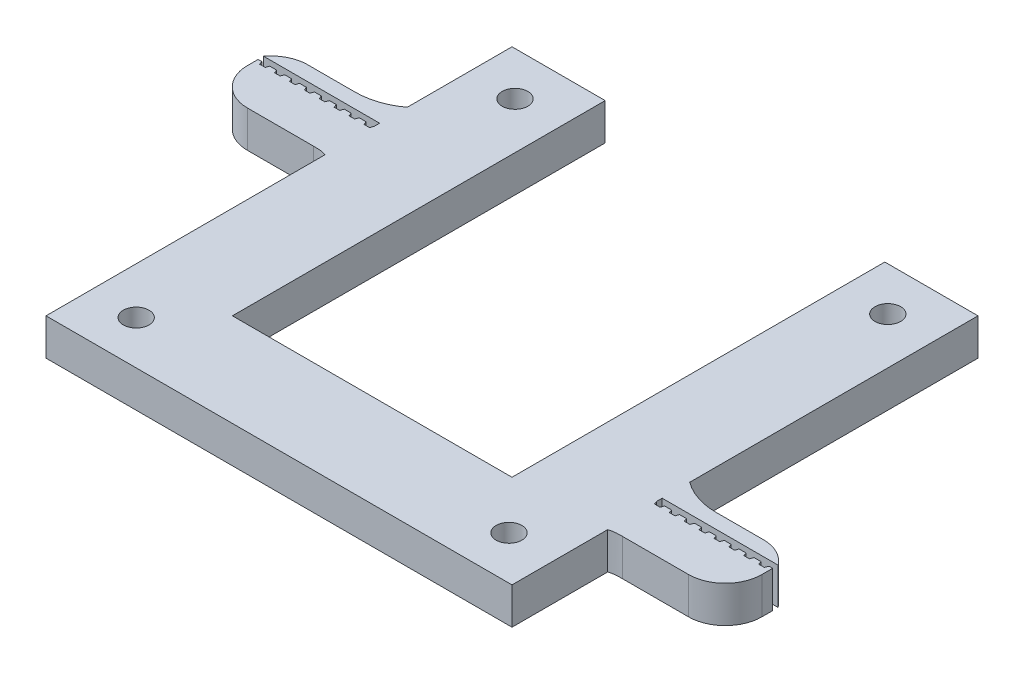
ISO-10303-21;
HEADER;
FILE_DESCRIPTION(('STEP AP214'),'2;1');
FILE_NAME('part.step','',(''),(''),'','','');
FILE_SCHEMA(('AUTOMOTIVE_DESIGN { 1 0 10303 214 1 1 1 1 }'));
ENDSEC;
DATA;
#1=APPLICATION_CONTEXT('core data for automotive mechanical design processes');
#2=APPLICATION_PROTOCOL_DEFINITION('international standard','automotive_design',2000,#1);
#3=PRODUCT_CONTEXT('',#1,'mechanical');
#4=PRODUCT('Part','Part','',(#3));
#5=PRODUCT_RELATED_PRODUCT_CATEGORY('part','',(#4));
#6=PRODUCT_DEFINITION_FORMATION('','',#4);
#7=PRODUCT_DEFINITION_CONTEXT('part definition',#1,'design');
#8=PRODUCT_DEFINITION('design','',#6,#7);
#9=PRODUCT_DEFINITION_SHAPE('','',#8);
#10=(LENGTH_UNIT() NAMED_UNIT(*) SI_UNIT(.MILLI.,.METRE.));
#11=(NAMED_UNIT(*) PLANE_ANGLE_UNIT() SI_UNIT($,.RADIAN.));
#12=(NAMED_UNIT(*) SI_UNIT($,.STERADIAN.) SOLID_ANGLE_UNIT());
#13=UNCERTAINTY_MEASURE_WITH_UNIT(LENGTH_MEASURE(1.E-05),#10,'distance_accuracy_value','');
#14=(GEOMETRIC_REPRESENTATION_CONTEXT(3) GLOBAL_UNCERTAINTY_ASSIGNED_CONTEXT((#13)) GLOBAL_UNIT_ASSIGNED_CONTEXT((#10,
#11,#12)) REPRESENTATION_CONTEXT('',''));
#15=CARTESIAN_POINT('',(0.,0.,0.));
#16=DIRECTION('',(0.,0.,1.));
#17=DIRECTION('',(1.,0.,0.));
#18=AXIS2_PLACEMENT_3D('',#15,#16,#17);
#19=CARTESIAN_POINT('',(-21.2566985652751,13.075,-13.335));
#20=DIRECTION('',(0.,-1.,0.));
#21=DIRECTION('',(1.,0.,0.));
#22=AXIS2_PLACEMENT_3D('',#19,#20,#21);
#23=PLANE('',#22);
#24=CARTESIAN_POINT('',(-29.9487202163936,13.075,-4.96762379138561));
#25=CARTESIAN_POINT('',(-30.1794192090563,13.075,-5.20727366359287));
#26=CARTESIAN_POINT('',(-30.4221620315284,13.075,-5.47596523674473));
#27=CARTESIAN_POINT('',(-31.1381020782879,13.075,-6.11448664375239));
#28=CARTESIAN_POINT('',(-31.9332492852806,13.075,-6.4288275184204));
#29=CARTESIAN_POINT('',(-32.7731407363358,13.075,-6.50000000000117));
#30=CARTESIAN_POINT('',(-33.1620124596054,13.075,-6.50000000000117));
#31=CARTESIAN_POINT('',(-33.550884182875,13.075,-6.50000000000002));
#32=B_SPLINE_CURVE_WITH_KNOTS('',5,(#24,#25,#26,#27,#28,#29,#30,#31),.UNSPECIFIED.,.F.,.F.,(6,2,
6),(0.,0.5,1.),.UNSPECIFIED.);
#33=CARTESIAN_POINT('',(-31.7499999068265,13.075,-6.27757132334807));
#34=VERTEX_POINT('',#33);
#35=CARTESIAN_POINT('',(-33.550884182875,13.075,-6.50000000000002));
#36=VERTEX_POINT('',#35);
#37=EDGE_CURVE('E1535',#34,#36,#32,.T.);
#38=ORIENTED_EDGE('',*,*,#37,.F.);
#39=DIRECTION('',(0.,0.,1.));
#40=VECTOR('',#39,1.);
#41=CARTESIAN_POINT('',(-31.75,13.075,-31.75));
#42=LINE('',#41,#40);
#43=CARTESIAN_POINT('',(-31.75,13.075,31.75));
#44=VERTEX_POINT('',#43);
#45=EDGE_CURVE('E883',#34,#44,#42,.T.);
#46=ORIENTED_EDGE('',*,*,#45,.T.);
#47=DIRECTION('',(1.,0.,0.));
#48=VECTOR('',#47,1.);
#49=CARTESIAN_POINT('',(-31.75,13.075,31.75));
#50=LINE('',#49,#48);
#51=CARTESIAN_POINT('',(31.75,13.075,31.75));
#52=VERTEX_POINT('',#51);
#53=EDGE_CURVE('E874',#44,#52,#50,.T.);
#54=ORIENTED_EDGE('',*,*,#53,.T.);
#55=DIRECTION('',(0.,0.,-1.));
#56=VECTOR('',#55,1.);
#57=CARTESIAN_POINT('',(31.75,13.075,31.75));
#58=LINE('',#57,#56);
#59=CARTESIAN_POINT('',(31.7499999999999,13.075,18.7223885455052));
#60=VERTEX_POINT('',#59);
#61=EDGE_CURVE('E865',#52,#60,#58,.T.);
#62=ORIENTED_EDGE('',*,*,#61,.T.);
#63=CARTESIAN_POINT('',(33.550884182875,13.075,18.5));
#64=CARTESIAN_POINT('',(33.1620124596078,13.075,18.4999999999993));
#65=CARTESIAN_POINT('',(32.7731407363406,13.075,18.4999999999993));
#66=CARTESIAN_POINT('',(31.9332492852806,13.075,18.5711724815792));
#67=CARTESIAN_POINT('',(31.1381020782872,13.075,18.8855133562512));
#68=CARTESIAN_POINT('',(30.4221620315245,13.075,19.5240347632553));
#69=CARTESIAN_POINT('',(30.1794192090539,13.075,19.7927263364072));
#70=CARTESIAN_POINT('',(29.9487202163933,13.075,20.0323762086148));
#71=B_SPLINE_CURVE_WITH_KNOTS('',5,(#63,#64,#65,#66,#67,#68,#69,#70),.UNSPECIFIED.,.F.,.F.,(6,2,
6),(0.,0.5,1.),.UNSPECIFIED.);
#72=CARTESIAN_POINT('',(33.550884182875,13.075,18.5));
#73=VERTEX_POINT('',#72);
#74=EDGE_CURVE('E805',#73,#60,#71,.T.);
#75=ORIENTED_EDGE('',*,*,#74,.F.);
#76=DIRECTION('',(1.,0.,0.));
#77=VECTOR('',#76,1.);
#78=CARTESIAN_POINT('',(47.5548526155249,13.075,18.5));
#79=LINE('',#78,#77);
#80=CARTESIAN_POINT('',(42.554852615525,13.075,18.5));
#81=VERTEX_POINT('',#80);
#82=EDGE_CURVE('E980',#73,#81,#79,.T.);
#83=ORIENTED_EDGE('',*,*,#82,.T.);
#84=CARTESIAN_POINT('',(42.554852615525,13.075,13.5));
#85=DIRECTION('',(0.,1.,0.));
#86=DIRECTION('',(-1.,0.,0.));
#87=AXIS2_PLACEMENT_3D('',#84,#85,#86);
#88=CIRCLE('',#87,5.);
#89=CARTESIAN_POINT('',(47.554852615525,13.075,13.5000000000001));
#90=VERTEX_POINT('',#89);
#91=EDGE_CURVE('E1855',#81,#90,#88,.T.);
#92=ORIENTED_EDGE('',*,*,#91,.T.);
#93=DIRECTION('',(0.,0.,-1.));
#94=VECTOR('',#93,1.);
#95=CARTESIAN_POINT('',(47.5548526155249,13.075,18.5));
#96=LINE('',#95,#94);
#97=CARTESIAN_POINT('',(47.5548526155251,13.075,12.04));
#98=VERTEX_POINT('',#97);
#99=EDGE_CURVE('E1061',#90,#98,#96,.T.);
#100=ORIENTED_EDGE('',*,*,#99,.T.);
#101=DIRECTION('',(-1.,0.,0.));
#102=VECTOR('',#101,1.);
#103=CARTESIAN_POINT('',(47.5548526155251,13.075,12.04));
#104=LINE('',#103,#102);
#105=CARTESIAN_POINT('',(47.0548526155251,13.075,12.04));
#106=VERTEX_POINT('',#105);
#107=EDGE_CURVE('E1060',#98,#106,#104,.T.);
#108=ORIENTED_EDGE('',*,*,#107,.T.);
#109=DIRECTION('',(-0.342020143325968,0.,0.939692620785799));
#110=VECTOR('',#109,1.);
#111=CARTESIAN_POINT('',(46.8874263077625,13.075,12.5));
#112=LINE('',#111,#110);
#113=CARTESIAN_POINT('',(46.8874263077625,13.075,12.5));
#114=VERTEX_POINT('',#113);
#115=EDGE_CURVE('E1058',#106,#114,#112,.T.);
#116=ORIENTED_EDGE('',*,*,#115,.T.);
#117=DIRECTION('',(-1.,0.,0.));
#118=VECTOR('',#117,1.);
#119=CARTESIAN_POINT('',(46.8874263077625,13.075,12.5));
#120=LINE('',#119,#118);
#121=CARTESIAN_POINT('',(46.1274263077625,13.075,12.5));
#122=VERTEX_POINT('',#121);
#123=EDGE_CURVE('E1056',#114,#122,#120,.T.);
#124=ORIENTED_EDGE('',*,*,#123,.T.);
#125=DIRECTION('',(-0.342020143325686,0.,-0.939692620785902));
#126=VECTOR('',#125,1.);
#127=CARTESIAN_POINT('',(46.1274263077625,13.075,12.5));
#128=LINE('',#127,#126);
#129=CARTESIAN_POINT('',(45.96,13.075,12.04));
#130=VERTEX_POINT('',#129);
#131=EDGE_CURVE('E1054',#122,#130,#128,.T.);
#132=ORIENTED_EDGE('',*,*,#131,.T.);
#133=DIRECTION('',(-1.,0.,0.));
#134=VECTOR('',#133,1.);
#135=CARTESIAN_POINT('',(45.96,13.075,12.04));
#136=LINE('',#135,#134);
#137=CARTESIAN_POINT('',(45.0248526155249,13.075,12.04));
#138=VERTEX_POINT('',#137);
#139=EDGE_CURVE('E1052',#130,#138,#136,.T.);
#140=ORIENTED_EDGE('',*,*,#139,.T.);
#141=DIRECTION('',(-0.342020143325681,0.,0.939692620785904));
#142=VECTOR('',#141,1.);
#143=CARTESIAN_POINT('',(44.8574263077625,13.075,12.5));
#144=LINE('',#143,#142);
#145=CARTESIAN_POINT('',(44.8574263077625,13.075,12.5));
#146=VERTEX_POINT('',#145);
#147=EDGE_CURVE('E1050',#138,#146,#144,.T.);
#148=ORIENTED_EDGE('',*,*,#147,.T.);
#149=DIRECTION('',(-1.,0.,0.));
#150=VECTOR('',#149,1.);
#151=CARTESIAN_POINT('',(44.8574263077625,13.075,12.5));
#152=LINE('',#151,#150);
#153=CARTESIAN_POINT('',(44.0974263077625,13.075,12.5));
#154=VERTEX_POINT('',#153);
#155=EDGE_CURVE('E1048',#146,#154,#152,.T.);
#156=ORIENTED_EDGE('',*,*,#155,.T.);
#157=DIRECTION('',(-0.342020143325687,0.,-0.939692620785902));
#158=VECTOR('',#157,1.);
#159=CARTESIAN_POINT('',(44.0974263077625,13.075,12.5));
#160=LINE('',#159,#158);
#161=CARTESIAN_POINT('',(43.93,13.075,12.04));
#162=VERTEX_POINT('',#161);
#163=EDGE_CURVE('E1046',#154,#162,#160,.T.);
#164=ORIENTED_EDGE('',*,*,#163,.T.);
#165=DIRECTION('',(-1.,0.,0.));
#166=VECTOR('',#165,1.);
#167=CARTESIAN_POINT('',(43.93,13.075,12.04));
#168=LINE('',#167,#166);
#169=CARTESIAN_POINT('',(42.9948526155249,13.075,12.04));
#170=VERTEX_POINT('',#169);
#171=EDGE_CURVE('E1044',#162,#170,#168,.T.);
#172=ORIENTED_EDGE('',*,*,#171,.T.);
#173=DIRECTION('',(-0.342020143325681,0.,0.939692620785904));
#174=VECTOR('',#173,1.);
#175=CARTESIAN_POINT('',(42.8274263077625,13.075,12.5));
#176=LINE('',#175,#174);
#177=CARTESIAN_POINT('',(42.8274263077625,13.075,12.5));
#178=VERTEX_POINT('',#177);
#179=EDGE_CURVE('E1042',#170,#178,#176,.T.);
#180=ORIENTED_EDGE('',*,*,#179,.T.);
#181=DIRECTION('',(-1.,0.,0.));
#182=VECTOR('',#181,1.);
#183=CARTESIAN_POINT('',(42.8274263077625,13.075,12.5));
#184=LINE('',#183,#182);
#185=CARTESIAN_POINT('',(42.0674263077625,13.075,12.5));
#186=VERTEX_POINT('',#185);
#187=EDGE_CURVE('E1040',#178,#186,#184,.T.);
#188=ORIENTED_EDGE('',*,*,#187,.T.);
#189=DIRECTION('',(-0.34202014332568,0.,-0.939692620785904));
#190=VECTOR('',#189,1.);
#191=CARTESIAN_POINT('',(42.0674263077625,13.075,12.5));
#192=LINE('',#191,#190);
#193=CARTESIAN_POINT('',(41.9,13.075,12.04));
#194=VERTEX_POINT('',#193);
#195=EDGE_CURVE('E1038',#186,#194,#192,.T.);
#196=ORIENTED_EDGE('',*,*,#195,.T.);
#197=DIRECTION('',(-1.,0.,0.));
#198=VECTOR('',#197,1.);
#199=CARTESIAN_POINT('',(41.9,13.075,12.04));
#200=LINE('',#199,#198);
#201=CARTESIAN_POINT('',(40.9648526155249,13.075,12.04));
#202=VERTEX_POINT('',#201);
#203=EDGE_CURVE('E1036',#194,#202,#200,.T.);
#204=ORIENTED_EDGE('',*,*,#203,.T.);
#205=DIRECTION('',(-0.342020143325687,0.,0.939692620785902));
#206=VECTOR('',#205,1.);
#207=CARTESIAN_POINT('',(40.7974263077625,13.075,12.5));
#208=LINE('',#207,#206);
#209=CARTESIAN_POINT('',(40.7974263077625,13.075,12.5));
#210=VERTEX_POINT('',#209);
#211=EDGE_CURVE('E1034',#202,#210,#208,.T.);
#212=ORIENTED_EDGE('',*,*,#211,.T.);
#213=DIRECTION('',(-1.,0.,0.));
#214=VECTOR('',#213,1.);
#215=CARTESIAN_POINT('',(40.7974263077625,13.075,12.5));
#216=LINE('',#215,#214);
#217=CARTESIAN_POINT('',(40.0374263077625,13.075,12.5));
#218=VERTEX_POINT('',#217);
#219=EDGE_CURVE('E1032',#210,#218,#216,.T.);
#220=ORIENTED_EDGE('',*,*,#219,.T.);
#221=DIRECTION('',(-0.34202014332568,0.,-0.939692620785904));
#222=VECTOR('',#221,1.);
#223=CARTESIAN_POINT('',(40.0374263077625,13.075,12.5));
#224=LINE('',#223,#222);
#225=CARTESIAN_POINT('',(39.87,13.075,12.04));
#226=VERTEX_POINT('',#225);
#227=EDGE_CURVE('E1030',#218,#226,#224,.T.);
#228=ORIENTED_EDGE('',*,*,#227,.T.);
#229=DIRECTION('',(-1.,0.,0.));
#230=VECTOR('',#229,1.);
#231=CARTESIAN_POINT('',(39.87,13.075,12.04));
#232=LINE('',#231,#230);
#233=CARTESIAN_POINT('',(38.9348526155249,13.075,12.04));
#234=VERTEX_POINT('',#233);
#235=EDGE_CURVE('E1028',#226,#234,#232,.T.);
#236=ORIENTED_EDGE('',*,*,#235,.T.);
#237=DIRECTION('',(-0.342020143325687,0.,0.939692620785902));
#238=VECTOR('',#237,1.);
#239=CARTESIAN_POINT('',(38.7674263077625,13.075,12.5));
#240=LINE('',#239,#238);
#241=CARTESIAN_POINT('',(38.7674263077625,13.075,12.5));
#242=VERTEX_POINT('',#241);
#243=EDGE_CURVE('E1026',#234,#242,#240,.T.);
#244=ORIENTED_EDGE('',*,*,#243,.T.);
#245=DIRECTION('',(-1.,0.,0.));
#246=VECTOR('',#245,1.);
#247=CARTESIAN_POINT('',(38.7674263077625,13.075,12.5));
#248=LINE('',#247,#246);
#249=CARTESIAN_POINT('',(38.0074263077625,13.075,12.5));
#250=VERTEX_POINT('',#249);
#251=EDGE_CURVE('E1024',#242,#250,#248,.T.);
#252=ORIENTED_EDGE('',*,*,#251,.T.);
#253=DIRECTION('',(-0.342020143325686,0.,-0.939692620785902));
#254=VECTOR('',#253,1.);
#255=CARTESIAN_POINT('',(38.0074263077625,13.075,12.5));
#256=LINE('',#255,#254);
#257=CARTESIAN_POINT('',(37.84,13.075,12.04));
#258=VERTEX_POINT('',#257);
#259=EDGE_CURVE('E1022',#250,#258,#256,.T.);
#260=ORIENTED_EDGE('',*,*,#259,.T.);
#261=DIRECTION('',(-1.,0.,0.));
#262=VECTOR('',#261,1.);
#263=CARTESIAN_POINT('',(37.84,13.075,12.04));
#264=LINE('',#263,#262);
#265=CARTESIAN_POINT('',(36.9048526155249,13.075,12.04));
#266=VERTEX_POINT('',#265);
#267=EDGE_CURVE('E1020',#258,#266,#264,.T.);
#268=ORIENTED_EDGE('',*,*,#267,.T.);
#269=DIRECTION('',(-0.34202014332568,0.,0.939692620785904));
#270=VECTOR('',#269,1.);
#271=CARTESIAN_POINT('',(36.7374263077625,13.075,12.5));
#272=LINE('',#271,#270);
#273=CARTESIAN_POINT('',(36.7374263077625,13.075,12.5));
#274=VERTEX_POINT('',#273);
#275=EDGE_CURVE('E1018',#266,#274,#272,.T.);
#276=ORIENTED_EDGE('',*,*,#275,.T.);
#277=DIRECTION('',(-1.,0.,0.));
#278=VECTOR('',#277,1.);
#279=CARTESIAN_POINT('',(36.7374263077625,13.075,12.5));
#280=LINE('',#279,#278);
#281=CARTESIAN_POINT('',(35.9774263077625,13.075,12.5));
#282=VERTEX_POINT('',#281);
#283=EDGE_CURVE('E1016',#274,#282,#280,.T.);
#284=ORIENTED_EDGE('',*,*,#283,.T.);
#285=DIRECTION('',(-0.342020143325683,0.,-0.939692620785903));
#286=VECTOR('',#285,1.);
#287=CARTESIAN_POINT('',(35.9774263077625,13.075,12.5));
#288=LINE('',#287,#286);
#289=CARTESIAN_POINT('',(35.81,13.075,12.04));
#290=VERTEX_POINT('',#289);
#291=EDGE_CURVE('E1014',#282,#290,#288,.T.);
#292=ORIENTED_EDGE('',*,*,#291,.T.);
#293=DIRECTION('',(-1.,0.,0.));
#294=VECTOR('',#293,1.);
#295=CARTESIAN_POINT('',(35.81,13.075,12.04));
#296=LINE('',#295,#294);
#297=CARTESIAN_POINT('',(34.8748526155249,13.075,12.04));
#298=VERTEX_POINT('',#297);
#299=EDGE_CURVE('E1012',#290,#298,#296,.T.);
#300=ORIENTED_EDGE('',*,*,#299,.T.);
#301=DIRECTION('',(-0.342020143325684,0.,0.939692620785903));
#302=VECTOR('',#301,1.);
#303=CARTESIAN_POINT('',(34.7074263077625,13.075,12.5));
#304=LINE('',#303,#302);
#305=CARTESIAN_POINT('',(34.7074263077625,13.075,12.5));
#306=VERTEX_POINT('',#305);
#307=EDGE_CURVE('E1010',#298,#306,#304,.T.);
#308=ORIENTED_EDGE('',*,*,#307,.T.);
#309=DIRECTION('',(-1.,0.,0.));
#310=VECTOR('',#309,1.);
#311=CARTESIAN_POINT('',(34.7074263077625,13.075,12.5));
#312=LINE('',#311,#310);
#313=CARTESIAN_POINT('',(33.9474263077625,13.075,12.5));
#314=VERTEX_POINT('',#313);
#315=EDGE_CURVE('E1008',#306,#314,#312,.T.);
#316=ORIENTED_EDGE('',*,*,#315,.T.);
#317=DIRECTION('',(-0.342020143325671,0.,-0.939692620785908));
#318=VECTOR('',#317,1.);
#319=CARTESIAN_POINT('',(33.9474263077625,13.075,12.5));
#320=LINE('',#319,#318);
#321=CARTESIAN_POINT('',(33.78,13.075,12.04));
#322=VERTEX_POINT('',#321);
#323=EDGE_CURVE('E1006',#314,#322,#320,.T.);
#324=ORIENTED_EDGE('',*,*,#323,.T.);
#325=DIRECTION('',(-1.,0.,0.));
#326=VECTOR('',#325,1.);
#327=CARTESIAN_POINT('',(33.78,13.075,12.04));
#328=LINE('',#327,#326);
#329=CARTESIAN_POINT('',(32.8448526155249,13.075,12.04));
#330=VERTEX_POINT('',#329);
#331=EDGE_CURVE('E1004',#322,#330,#328,.T.);
#332=ORIENTED_EDGE('',*,*,#331,.T.);
#333=DIRECTION('',(-0.342020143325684,0.,0.939692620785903));
#334=VECTOR('',#333,1.);
#335=CARTESIAN_POINT('',(32.6774263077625,13.075,12.5));
#336=LINE('',#335,#334);
#337=CARTESIAN_POINT('',(32.6774263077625,13.075,12.5));
#338=VERTEX_POINT('',#337);
#339=EDGE_CURVE('E991',#330,#338,#336,.T.);
#340=ORIENTED_EDGE('',*,*,#339,.T.);
#341=DIRECTION('',(-1.,0.,0.));
#342=VECTOR('',#341,1.);
#343=CARTESIAN_POINT('',(32.6774263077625,13.075,12.5));
#344=LINE('',#343,#342);
#345=CARTESIAN_POINT('',(31.9174263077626,13.075,12.5));
#346=VERTEX_POINT('',#345);
#347=EDGE_CURVE('E988',#338,#346,#344,.T.);
#348=ORIENTED_EDGE('',*,*,#347,.T.);
#349=DIRECTION('',(-0.342020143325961,0.,-0.939692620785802));
#350=VECTOR('',#349,1.);
#351=CARTESIAN_POINT('',(31.9174263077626,13.075,12.5));
#352=LINE('',#351,#350);
#353=CARTESIAN_POINT('',(31.75,13.075,12.04));
#354=VERTEX_POINT('',#353);
#355=EDGE_CURVE('E986',#346,#354,#352,.T.);
#356=ORIENTED_EDGE('',*,*,#355,.T.);
#357=CARTESIAN_POINT('',(31.75,13.075,11.2900000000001));
#358=VERTEX_POINT('',#357);
#359=EDGE_CURVE('E869',#354,#358,#58,.T.);
#360=ORIENTED_EDGE('',*,*,#359,.T.);
#361=DIRECTION('',(1.,0.,0.));
#362=VECTOR('',#361,1.);
#363=CARTESIAN_POINT('',(31.75,13.075,11.2900000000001));
#364=LINE('',#363,#362);
#365=CARTESIAN_POINT('',(47.5548526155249,13.075,11.29));
#366=VERTEX_POINT('',#365);
#367=EDGE_CURVE('E621',#358,#366,#364,.T.);
#368=ORIENTED_EDGE('',*,*,#367,.T.);
#369=CARTESIAN_POINT('',(43.5548526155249,13.075,14.29));
#370=DIRECTION('',(0.,1.,0.));
#371=DIRECTION('',(-1.,0.,0.));
#372=AXIS2_PLACEMENT_3D('',#369,#370,#371);
#373=CIRCLE('',#372,5.);
#374=CARTESIAN_POINT('',(43.5548526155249,13.075,9.29000000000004));
#375=VERTEX_POINT('',#374);
#376=EDGE_CURVE('E636',#366,#375,#373,.T.);
#377=ORIENTED_EDGE('',*,*,#376,.T.);
#378=DIRECTION('',(-1.,0.,0.));
#379=VECTOR('',#378,1.);
#380=CARTESIAN_POINT('',(47.5548526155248,13.075,9.29000000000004));
#381=LINE('',#380,#379);
#382=CARTESIAN_POINT('',(37.0952393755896,13.075,9.29000000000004));
#383=VERTEX_POINT('',#382);
#384=EDGE_CURVE('E627',#375,#383,#381,.T.);
#385=ORIENTED_EDGE('',*,*,#384,.T.);
#386=CARTESIAN_POINT('',(37.0952393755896,13.075,0.290000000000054));
#387=DIRECTION('',(0.,1.,0.));
#388=DIRECTION('',(-1.,0.,0.));
#389=AXIS2_PLACEMENT_3D('',#386,#387,#388);
#390=CIRCLE('',#389,9.);
#391=CARTESIAN_POINT('',(31.75,13.075,7.53074692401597));
#392=VERTEX_POINT('',#391);
#393=EDGE_CURVE('E625',#383,#392,#390,.F.);
#394=ORIENTED_EDGE('',*,*,#393,.T.);
#395=CARTESIAN_POINT('',(31.75,13.075,-31.75));
#396=VERTEX_POINT('',#395);
#397=EDGE_CURVE('E879',#392,#396,#58,.T.);
#398=ORIENTED_EDGE('',*,*,#397,.T.);
#399=DIRECTION('',(-1.,0.,0.));
#400=VECTOR('',#399,1.);
#401=CARTESIAN_POINT('',(31.75,13.075,-31.75));
#402=LINE('',#401,#400);
#403=CARTESIAN_POINT('',(19.05,13.075,-31.75));
#404=VERTEX_POINT('',#403);
#405=EDGE_CURVE('E868',#396,#404,#402,.T.);
#406=ORIENTED_EDGE('',*,*,#405,.T.);
#407=DIRECTION('',(0.,0.,1.));
#408=VECTOR('',#407,1.);
#409=CARTESIAN_POINT('',(19.05,13.075,-19.05));
#410=LINE('',#409,#408);
#411=CARTESIAN_POINT('',(19.05,13.075,19.05));
#412=VERTEX_POINT('',#411);
#413=EDGE_CURVE('E952',#404,#412,#410,.T.);
#414=ORIENTED_EDGE('',*,*,#413,.T.);
#415=DIRECTION('',(-1.,0.,0.));
#416=VECTOR('',#415,1.);
#417=CARTESIAN_POINT('',(-19.05,13.075,19.05));
#418=LINE('',#417,#416);
#419=CARTESIAN_POINT('',(-19.05,13.075,19.05));
#420=VERTEX_POINT('',#419);
#421=EDGE_CURVE('E951',#412,#420,#418,.T.);
#422=ORIENTED_EDGE('',*,*,#421,.T.);
#423=DIRECTION('',(0.,0.,-1.));
#424=VECTOR('',#423,1.);
#425=CARTESIAN_POINT('',(-19.05,13.075,-19.05));
#426=LINE('',#425,#424);
#427=CARTESIAN_POINT('',(-19.05,13.075,-31.75));
#428=VERTEX_POINT('',#427);
#429=EDGE_CURVE('E929',#420,#428,#426,.T.);
#430=ORIENTED_EDGE('',*,*,#429,.T.);
#431=DIRECTION('',(-1.,0.,0.));
#432=VECTOR('',#431,1.);
#433=CARTESIAN_POINT('',(-19.05,13.075,-31.75));
#434=LINE('',#433,#432);
#435=CARTESIAN_POINT('',(-31.75,13.075,-31.75));
#436=VERTEX_POINT('',#435);
#437=EDGE_CURVE('E884',#428,#436,#434,.T.);
#438=ORIENTED_EDGE('',*,*,#437,.T.);
#439=CARTESIAN_POINT('',(-31.75,13.075,-17.4692530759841));
#440=VERTEX_POINT('',#439);
#441=EDGE_CURVE('E890',#436,#440,#42,.T.);
#442=ORIENTED_EDGE('',*,*,#441,.T.);
#443=CARTESIAN_POINT('',(-37.0952393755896,13.075,-24.71));
#444=DIRECTION('',(0.,-1.,0.));
#445=DIRECTION('',(1.,0.,0.));
#446=AXIS2_PLACEMENT_3D('',#443,#444,#445);
#447=CIRCLE('',#446,9.);
#448=CARTESIAN_POINT('',(-37.0952393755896,13.075,-15.71));
#449=VERTEX_POINT('',#448);
#450=EDGE_CURVE('E847',#440,#449,#447,.T.);
#451=ORIENTED_EDGE('',*,*,#450,.T.);
#452=DIRECTION('',(1.,0.,0.));
#453=VECTOR('',#452,1.);
#454=CARTESIAN_POINT('',(-47.5548526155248,13.075,-15.71));
#455=LINE('',#454,#453);
#456=CARTESIAN_POINT('',(-43.5548526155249,13.075,-15.71));
#457=VERTEX_POINT('',#456);
#458=EDGE_CURVE('E978',#457,#449,#455,.T.);
#459=ORIENTED_EDGE('',*,*,#458,.F.);
#460=CARTESIAN_POINT('',(-43.5548526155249,13.075,-10.71));
#461=DIRECTION('',(0.,-1.,0.));
#462=DIRECTION('',(1.,0.,0.));
#463=AXIS2_PLACEMENT_3D('',#460,#461,#462);
#464=CIRCLE('',#463,5.);
#465=CARTESIAN_POINT('',(-47.5548526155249,13.075,-13.71));
#466=VERTEX_POINT('',#465);
#467=EDGE_CURVE('E850',#457,#466,#464,.F.);
#468=ORIENTED_EDGE('',*,*,#467,.T.);
#469=DIRECTION('',(-1.,0.,0.));
#470=VECTOR('',#469,1.);
#471=CARTESIAN_POINT('',(-31.75,13.075,-13.71));
#472=LINE('',#471,#470);
#473=CARTESIAN_POINT('',(-31.75,13.075,-13.71));
#474=VERTEX_POINT('',#473);
#475=EDGE_CURVE('E837',#474,#466,#472,.T.);
#476=ORIENTED_EDGE('',*,*,#475,.F.);
#477=CARTESIAN_POINT('',(-31.75,13.075,-12.9600000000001));
#478=VERTEX_POINT('',#477);
#479=EDGE_CURVE('E834',#474,#478,#42,.T.);
#480=ORIENTED_EDGE('',*,*,#479,.T.);
#481=DIRECTION('',(0.342020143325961,0.,-0.939692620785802));
#482=VECTOR('',#481,1.);
#483=CARTESIAN_POINT('',(-31.9174263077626,13.075,-12.5));
#484=LINE('',#483,#482);
#485=CARTESIAN_POINT('',(-31.9174263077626,13.075,-12.5));
#486=VERTEX_POINT('',#485);
#487=EDGE_CURVE('E1653',#486,#478,#484,.T.);
#488=ORIENTED_EDGE('',*,*,#487,.F.);
#489=DIRECTION('',(1.,0.,0.));
#490=VECTOR('',#489,1.);
#491=CARTESIAN_POINT('',(-32.6774263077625,13.075,-12.5));
#492=LINE('',#491,#490);
#493=CARTESIAN_POINT('',(-32.6774263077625,13.075,-12.5));
#494=VERTEX_POINT('',#493);
#495=EDGE_CURVE('E1650',#494,#486,#492,.T.);
#496=ORIENTED_EDGE('',*,*,#495,.F.);
#497=DIRECTION('',(0.342020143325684,0.,0.939692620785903));
#498=VECTOR('',#497,1.);
#499=CARTESIAN_POINT('',(-32.6774263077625,13.075,-12.5));
#500=LINE('',#499,#498);
#501=CARTESIAN_POINT('',(-32.8448526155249,13.075,-12.96));
#502=VERTEX_POINT('',#501);
#503=EDGE_CURVE('E1647',#502,#494,#500,.T.);
#504=ORIENTED_EDGE('',*,*,#503,.F.);
#505=DIRECTION('',(1.,0.,0.));
#506=VECTOR('',#505,1.);
#507=CARTESIAN_POINT('',(-33.78,13.075,-12.96));
#508=LINE('',#507,#506);
#509=CARTESIAN_POINT('',(-33.78,13.075,-12.96));
#510=VERTEX_POINT('',#509);
#511=EDGE_CURVE('E1644',#510,#502,#508,.T.);
#512=ORIENTED_EDGE('',*,*,#511,.F.);
#513=DIRECTION('',(0.342020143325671,0.,-0.939692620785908));
#514=VECTOR('',#513,1.);
#515=CARTESIAN_POINT('',(-33.9474263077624,13.075,-12.5));
#516=LINE('',#515,#514);
#517=CARTESIAN_POINT('',(-33.9474263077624,13.075,-12.5));
#518=VERTEX_POINT('',#517);
#519=EDGE_CURVE('E1641',#518,#510,#516,.T.);
#520=ORIENTED_EDGE('',*,*,#519,.F.);
#521=DIRECTION('',(1.,0.,0.));
#522=VECTOR('',#521,1.);
#523=CARTESIAN_POINT('',(-34.7074263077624,13.075,-12.5));
#524=LINE('',#523,#522);
#525=CARTESIAN_POINT('',(-34.7074263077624,13.075,-12.5));
#526=VERTEX_POINT('',#525);
#527=EDGE_CURVE('E1638',#526,#518,#524,.T.);
#528=ORIENTED_EDGE('',*,*,#527,.F.);
#529=DIRECTION('',(0.342020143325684,0.,0.939692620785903));
#530=VECTOR('',#529,1.);
#531=CARTESIAN_POINT('',(-34.7074263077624,13.075,-12.5));
#532=LINE('',#531,#530);
#533=CARTESIAN_POINT('',(-34.8748526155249,13.075,-12.96));
#534=VERTEX_POINT('',#533);
#535=EDGE_CURVE('E1635',#534,#526,#532,.T.);
#536=ORIENTED_EDGE('',*,*,#535,.F.);
#537=DIRECTION('',(1.,0.,0.));
#538=VECTOR('',#537,1.);
#539=CARTESIAN_POINT('',(-35.81,13.075,-12.96));
#540=LINE('',#539,#538);
#541=CARTESIAN_POINT('',(-35.81,13.075,-12.96));
#542=VERTEX_POINT('',#541);
#543=EDGE_CURVE('E1632',#542,#534,#540,.T.);
#544=ORIENTED_EDGE('',*,*,#543,.F.);
#545=DIRECTION('',(0.342020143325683,0.,-0.939692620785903));
#546=VECTOR('',#545,1.);
#547=CARTESIAN_POINT('',(-35.9774263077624,13.075,-12.5));
#548=LINE('',#547,#546);
#549=CARTESIAN_POINT('',(-35.9774263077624,13.075,-12.5));
#550=VERTEX_POINT('',#549);
#551=EDGE_CURVE('E1629',#550,#542,#548,.T.);
#552=ORIENTED_EDGE('',*,*,#551,.F.);
#553=DIRECTION('',(1.,0.,0.));
#554=VECTOR('',#553,1.);
#555=CARTESIAN_POINT('',(-36.7374263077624,13.075,-12.5));
#556=LINE('',#555,#554);
#557=CARTESIAN_POINT('',(-36.7374263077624,13.075,-12.5));
#558=VERTEX_POINT('',#557);
#559=EDGE_CURVE('E1626',#558,#550,#556,.T.);
#560=ORIENTED_EDGE('',*,*,#559,.F.);
#561=DIRECTION('',(0.34202014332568,0.,0.939692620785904));
#562=VECTOR('',#561,1.);
#563=CARTESIAN_POINT('',(-36.7374263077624,13.075,-12.5));
#564=LINE('',#563,#562);
#565=CARTESIAN_POINT('',(-36.9048526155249,13.075,-12.96));
#566=VERTEX_POINT('',#565);
#567=EDGE_CURVE('E1623',#566,#558,#564,.T.);
#568=ORIENTED_EDGE('',*,*,#567,.F.);
#569=DIRECTION('',(1.,0.,0.));
#570=VECTOR('',#569,1.);
#571=CARTESIAN_POINT('',(-37.84,13.075,-12.96));
#572=LINE('',#571,#570);
#573=CARTESIAN_POINT('',(-37.84,13.075,-12.96));
#574=VERTEX_POINT('',#573);
#575=EDGE_CURVE('E1620',#574,#566,#572,.T.);
#576=ORIENTED_EDGE('',*,*,#575,.F.);
#577=DIRECTION('',(0.342020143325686,0.,-0.939692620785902));
#578=VECTOR('',#577,1.);
#579=CARTESIAN_POINT('',(-38.0074263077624,13.075,-12.5));
#580=LINE('',#579,#578);
#581=CARTESIAN_POINT('',(-38.0074263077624,13.075,-12.5));
#582=VERTEX_POINT('',#581);
#583=EDGE_CURVE('E1617',#582,#574,#580,.T.);
#584=ORIENTED_EDGE('',*,*,#583,.F.);
#585=DIRECTION('',(1.,0.,0.));
#586=VECTOR('',#585,1.);
#587=CARTESIAN_POINT('',(-38.7674263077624,13.075,-12.5));
#588=LINE('',#587,#586);
#589=CARTESIAN_POINT('',(-38.7674263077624,13.075,-12.5));
#590=VERTEX_POINT('',#589);
#591=EDGE_CURVE('E1614',#590,#582,#588,.T.);
#592=ORIENTED_EDGE('',*,*,#591,.F.);
#593=DIRECTION('',(0.342020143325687,0.,0.939692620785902));
#594=VECTOR('',#593,1.);
#595=CARTESIAN_POINT('',(-38.7674263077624,13.075,-12.5));
#596=LINE('',#595,#594);
#597=CARTESIAN_POINT('',(-38.9348526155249,13.075,-12.96));
#598=VERTEX_POINT('',#597);
#599=EDGE_CURVE('E1611',#598,#590,#596,.T.);
#600=ORIENTED_EDGE('',*,*,#599,.F.);
#601=DIRECTION('',(1.,0.,0.));
#602=VECTOR('',#601,1.);
#603=CARTESIAN_POINT('',(-39.87,13.075,-12.96));
#604=LINE('',#603,#602);
#605=CARTESIAN_POINT('',(-39.87,13.075,-12.96));
#606=VERTEX_POINT('',#605);
#607=EDGE_CURVE('E1608',#606,#598,#604,.T.);
#608=ORIENTED_EDGE('',*,*,#607,.F.);
#609=DIRECTION('',(0.34202014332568,0.,-0.939692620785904));
#610=VECTOR('',#609,1.);
#611=CARTESIAN_POINT('',(-40.0374263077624,13.075,-12.5));
#612=LINE('',#611,#610);
#613=CARTESIAN_POINT('',(-40.0374263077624,13.075,-12.5));
#614=VERTEX_POINT('',#613);
#615=EDGE_CURVE('E1605',#614,#606,#612,.T.);
#616=ORIENTED_EDGE('',*,*,#615,.F.);
#617=DIRECTION('',(1.,0.,0.));
#618=VECTOR('',#617,1.);
#619=CARTESIAN_POINT('',(-40.7974263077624,13.075,-12.5));
#620=LINE('',#619,#618);
#621=CARTESIAN_POINT('',(-40.7974263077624,13.075,-12.5));
#622=VERTEX_POINT('',#621);
#623=EDGE_CURVE('E1602',#622,#614,#620,.T.);
#624=ORIENTED_EDGE('',*,*,#623,.F.);
#625=DIRECTION('',(0.342020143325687,0.,0.939692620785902));
#626=VECTOR('',#625,1.);
#627=CARTESIAN_POINT('',(-40.7974263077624,13.075,-12.5));
#628=LINE('',#627,#626);
#629=CARTESIAN_POINT('',(-40.9648526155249,13.075,-12.96));
#630=VERTEX_POINT('',#629);
#631=EDGE_CURVE('E1599',#630,#622,#628,.T.);
#632=ORIENTED_EDGE('',*,*,#631,.F.);
#633=DIRECTION('',(1.,0.,0.));
#634=VECTOR('',#633,1.);
#635=CARTESIAN_POINT('',(-41.9,13.075,-12.96));
#636=LINE('',#635,#634);
#637=CARTESIAN_POINT('',(-41.9,13.075,-12.96));
#638=VERTEX_POINT('',#637);
#639=EDGE_CURVE('E1596',#638,#630,#636,.T.);
#640=ORIENTED_EDGE('',*,*,#639,.F.);
#641=DIRECTION('',(0.34202014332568,0.,-0.939692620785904));
#642=VECTOR('',#641,1.);
#643=CARTESIAN_POINT('',(-42.0674263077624,13.075,-12.5));
#644=LINE('',#643,#642);
#645=CARTESIAN_POINT('',(-42.0674263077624,13.075,-12.5));
#646=VERTEX_POINT('',#645);
#647=EDGE_CURVE('E1593',#646,#638,#644,.T.);
#648=ORIENTED_EDGE('',*,*,#647,.F.);
#649=DIRECTION('',(1.,0.,0.));
#650=VECTOR('',#649,1.);
#651=CARTESIAN_POINT('',(-42.8274263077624,13.075,-12.5));
#652=LINE('',#651,#650);
#653=CARTESIAN_POINT('',(-42.8274263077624,13.075,-12.5));
#654=VERTEX_POINT('',#653);
#655=EDGE_CURVE('E1590',#654,#646,#652,.T.);
#656=ORIENTED_EDGE('',*,*,#655,.F.);
#657=DIRECTION('',(0.342020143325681,0.,0.939692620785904));
#658=VECTOR('',#657,1.);
#659=CARTESIAN_POINT('',(-42.8274263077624,13.075,-12.5));
#660=LINE('',#659,#658);
#661=CARTESIAN_POINT('',(-42.9948526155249,13.075,-12.96));
#662=VERTEX_POINT('',#661);
#663=EDGE_CURVE('E1587',#662,#654,#660,.T.);
#664=ORIENTED_EDGE('',*,*,#663,.F.);
#665=DIRECTION('',(1.,0.,0.));
#666=VECTOR('',#665,1.);
#667=CARTESIAN_POINT('',(-43.93,13.075,-12.96));
#668=LINE('',#667,#666);
#669=CARTESIAN_POINT('',(-43.93,13.075,-12.96));
#670=VERTEX_POINT('',#669);
#671=EDGE_CURVE('E1584',#670,#662,#668,.T.);
#672=ORIENTED_EDGE('',*,*,#671,.F.);
#673=DIRECTION('',(0.342020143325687,0.,-0.939692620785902));
#674=VECTOR('',#673,1.);
#675=CARTESIAN_POINT('',(-44.0974263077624,13.075,-12.5));
#676=LINE('',#675,#674);
#677=CARTESIAN_POINT('',(-44.0974263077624,13.075,-12.5));
#678=VERTEX_POINT('',#677);
#679=EDGE_CURVE('E1581',#678,#670,#676,.T.);
#680=ORIENTED_EDGE('',*,*,#679,.F.);
#681=DIRECTION('',(1.,0.,0.));
#682=VECTOR('',#681,1.);
#683=CARTESIAN_POINT('',(-44.8574263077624,13.075,-12.5));
#684=LINE('',#683,#682);
#685=CARTESIAN_POINT('',(-44.8574263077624,13.075,-12.5));
#686=VERTEX_POINT('',#685);
#687=EDGE_CURVE('E1578',#686,#678,#684,.T.);
#688=ORIENTED_EDGE('',*,*,#687,.F.);
#689=DIRECTION('',(0.342020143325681,0.,0.939692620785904));
#690=VECTOR('',#689,1.);
#691=CARTESIAN_POINT('',(-44.8574263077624,13.075,-12.5));
#692=LINE('',#691,#690);
#693=CARTESIAN_POINT('',(-45.0248526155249,13.075,-12.96));
#694=VERTEX_POINT('',#693);
#695=EDGE_CURVE('E1575',#694,#686,#692,.T.);
#696=ORIENTED_EDGE('',*,*,#695,.F.);
#697=DIRECTION('',(1.,0.,0.));
#698=VECTOR('',#697,1.);
#699=CARTESIAN_POINT('',(-45.96,13.075,-12.96));
#700=LINE('',#699,#698);
#701=CARTESIAN_POINT('',(-45.96,13.075,-12.96));
#702=VERTEX_POINT('',#701);
#703=EDGE_CURVE('E1572',#702,#694,#700,.T.);
#704=ORIENTED_EDGE('',*,*,#703,.F.);
#705=DIRECTION('',(0.342020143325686,0.,-0.939692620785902));
#706=VECTOR('',#705,1.);
#707=CARTESIAN_POINT('',(-46.1274263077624,13.075,-12.5));
#708=LINE('',#707,#706);
#709=CARTESIAN_POINT('',(-46.1274263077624,13.075,-12.5));
#710=VERTEX_POINT('',#709);
#711=EDGE_CURVE('E1569',#710,#702,#708,.T.);
#712=ORIENTED_EDGE('',*,*,#711,.F.);
#713=DIRECTION('',(1.,0.,0.));
#714=VECTOR('',#713,1.);
#715=CARTESIAN_POINT('',(-46.8874263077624,13.075,-12.5));
#716=LINE('',#715,#714);
#717=CARTESIAN_POINT('',(-46.8874263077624,13.075,-12.5));
#718=VERTEX_POINT('',#717);
#719=EDGE_CURVE('E1566',#718,#710,#716,.T.);
#720=ORIENTED_EDGE('',*,*,#719,.F.);
#721=DIRECTION('',(0.342020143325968,0.,0.939692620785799));
#722=VECTOR('',#721,1.);
#723=CARTESIAN_POINT('',(-46.8874263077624,13.075,-12.5));
#724=LINE('',#723,#722);
#725=CARTESIAN_POINT('',(-47.0548526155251,13.075,-12.96));
#726=VERTEX_POINT('',#725);
#727=EDGE_CURVE('E1553',#726,#718,#724,.T.);
#728=ORIENTED_EDGE('',*,*,#727,.F.);
#729=DIRECTION('',(1.,0.,0.));
#730=VECTOR('',#729,1.);
#731=CARTESIAN_POINT('',(-47.5548526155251,13.075,-12.96));
#732=LINE('',#731,#730);
#733=CARTESIAN_POINT('',(-47.5548526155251,13.075,-12.96));
#734=VERTEX_POINT('',#733);
#735=EDGE_CURVE('E1551',#734,#726,#732,.T.);
#736=ORIENTED_EDGE('',*,*,#735,.F.);
#737=DIRECTION('',(0.,0.,-1.));
#738=VECTOR('',#737,1.);
#739=CARTESIAN_POINT('',(-47.5548526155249,13.075,-6.50000000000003));
#740=LINE('',#739,#738);
#741=CARTESIAN_POINT('',(-47.554852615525,13.075,-11.4999999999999));
#742=VERTEX_POINT('',#741);
#743=EDGE_CURVE('E1546',#742,#734,#740,.T.);
#744=ORIENTED_EDGE('',*,*,#743,.F.);
#745=CARTESIAN_POINT('',(-42.554852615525,13.075,-11.5));
#746=DIRECTION('',(0.,-1.,0.));
#747=DIRECTION('',(1.,0.,0.));
#748=AXIS2_PLACEMENT_3D('',#745,#746,#747);
#749=CIRCLE('',#748,5.);
#750=CARTESIAN_POINT('',(-42.554852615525,13.075,-6.50000000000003));
#751=VERTEX_POINT('',#750);
#752=EDGE_CURVE('E772',#742,#751,#749,.F.);
#753=ORIENTED_EDGE('',*,*,#752,.T.);
#754=DIRECTION('',(-1.,0.,0.));
#755=VECTOR('',#754,1.);
#756=CARTESIAN_POINT('',(-47.5548526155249,13.075,-6.50000000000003));
#757=LINE('',#756,#755);
#758=EDGE_CURVE('E40',#36,#751,#757,.T.);
#759=ORIENTED_EDGE('',*,*,#758,.F.);
#760=EDGE_LOOP('',(#38,#46,#54,#62,#75,#83,#92,#100,#108,#116,#124,#132,#140,#148,#156,#164,
#172,#180,#188,#196,#204,#212,#220,#228,#236,#244,#252,#260,#268,#276,#284,#292,#300,#308,#316,
#324,#332,#340,#348,#356,#360,#368,#377,#385,#394,#398,#406,#414,#422,#430,#438,#442,#451,#459,
#468,#476,#480,#488,#496,#504,#512,#520,#528,#536,#544,#552,#560,#568,#576,#584,#592,#600,#608,
#616,#624,#632,#640,#648,#656,#664,#672,#680,#688,#696,#704,#712,#720,#728,#736,#744,#753,#759));
#761=FACE_BOUND('',#760,.T.);
#762=CARTESIAN_POINT('',(25.4,13.075,-25.8125));
#763=DIRECTION('',(0.,1.,0.));
#764=DIRECTION('',(0.,0.,-1.));
#765=AXIS2_PLACEMENT_3D('',#762,#763,#764);
#766=CIRCLE('',#765,1.75);
#767=CARTESIAN_POINT('',(25.4,13.075,-27.5625));
#768=VERTEX_POINT('',#767);
#769=EDGE_CURVE('E856',#768,#768,#766,.T.);
#770=ORIENTED_EDGE('',*,*,#769,.F.);
#771=EDGE_LOOP('',(#770));
#772=FACE_BOUND('',#771,.T.);
#773=CARTESIAN_POINT('',(25.4,13.075,25.8125));
#774=DIRECTION('',(0.,1.,0.));
#775=DIRECTION('',(0.,0.,1.));
#776=AXIS2_PLACEMENT_3D('',#773,#774,#775);
#777=CIRCLE('',#776,1.75);
#778=CARTESIAN_POINT('',(25.4,13.075,27.5625));
#779=VERTEX_POINT('',#778);
#780=EDGE_CURVE('E896',#779,#779,#777,.T.);
#781=ORIENTED_EDGE('',*,*,#780,.F.);
#782=EDGE_LOOP('',(#781));
#783=FACE_BOUND('',#782,.T.);
#784=CARTESIAN_POINT('',(-25.4,13.075,25.8125));
#785=DIRECTION('',(0.,1.,0.));
#786=DIRECTION('',(0.,0.,-1.));
#787=AXIS2_PLACEMENT_3D('',#784,#785,#786);
#788=CIRCLE('',#787,1.75);
#789=CARTESIAN_POINT('',(-25.4,13.075,24.0625));
#790=VERTEX_POINT('',#789);
#791=EDGE_CURVE('E900',#790,#790,#788,.T.);
#792=ORIENTED_EDGE('',*,*,#791,.F.);
#793=EDGE_LOOP('',(#792));
#794=FACE_BOUND('',#793,.T.);
#795=CARTESIAN_POINT('',(-25.4,13.075,-25.8125));
#796=DIRECTION('',(0.,1.,0.));
#797=DIRECTION('',(0.,0.,1.));
#798=AXIS2_PLACEMENT_3D('',#795,#796,#797);
#799=CIRCLE('',#798,1.75);
#800=CARTESIAN_POINT('',(-25.4,13.075,-24.0625));
#801=VERTEX_POINT('',#800);
#802=EDGE_CURVE('E904',#801,#801,#799,.T.);
#803=ORIENTED_EDGE('',*,*,#802,.F.);
#804=EDGE_LOOP('',(#803));
#805=FACE_BOUND('',#804,.T.);
#806=ADVANCED_FACE('F30',(#761,#772,#783,#794,#805),#23,.F.);
#807=CARTESIAN_POINT('',(-33.550884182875,6.47499999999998,-6.50000000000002));
#808=CARTESIAN_POINT('',(-33.550884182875,8.87499999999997,-6.50000000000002));
#809=CARTESIAN_POINT('',(-33.550884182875,11.275,-6.50000000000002));
#810=CARTESIAN_POINT('',(-33.550884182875,13.675,-6.50000000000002));
#811=CARTESIAN_POINT('',(-33.1620124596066,6.47499999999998,-6.50000000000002));
#812=CARTESIAN_POINT('',(-33.1620124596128,8.87499999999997,-6.50000000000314));
#813=CARTESIAN_POINT('',(-33.1620124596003,11.275,-6.50000000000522));
#814=CARTESIAN_POINT('',(-33.1620124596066,13.675,-6.50000000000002));
#815=CARTESIAN_POINT('',(-32.7731407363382,6.47499999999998,-6.50000000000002));
#816=CARTESIAN_POINT('',(-32.7731407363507,8.87499999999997,-6.50000000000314));
#817=CARTESIAN_POINT('',(-32.7731407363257,11.275,-6.50000000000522));
#818=CARTESIAN_POINT('',(-32.7731407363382,13.675,-6.50000000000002));
#819=CARTESIAN_POINT('',(-31.9332492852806,6.47499999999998,-6.42882751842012));
#820=CARTESIAN_POINT('',(-31.9332492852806,8.87499999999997,-6.42882751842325));
#821=CARTESIAN_POINT('',(-31.9332492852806,11.275,-6.42882751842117));
#822=CARTESIAN_POINT('',(-31.9332492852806,13.675,-6.42882751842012));
#823=CARTESIAN_POINT('',(-31.1381020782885,6.47499999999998,-6.11448664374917));
#824=CARTESIAN_POINT('',(-31.1381020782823,8.87499999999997,-6.11448664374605));
#825=CARTESIAN_POINT('',(-31.1381020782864,11.275,-6.11448664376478));
#826=CARTESIAN_POINT('',(-31.1381020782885,13.675,-6.11448664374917));
#827=CARTESIAN_POINT('',(-30.4221620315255,6.47499999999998,-5.47596523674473));
#828=CARTESIAN_POINT('',(-30.4221620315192,8.87499999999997,-5.47596523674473));
#829=CARTESIAN_POINT('',(-30.42216203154,11.275,-5.47596523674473));
#830=CARTESIAN_POINT('',(-30.4221620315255,13.675,-5.47596523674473));
#831=CARTESIAN_POINT('',(-30.1794192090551,6.47499999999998,-5.20727366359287));
#832=CARTESIAN_POINT('',(-30.1794192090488,8.87499999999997,-5.20727366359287));
#833=CARTESIAN_POINT('',(-30.1794192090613,11.275,-5.20727366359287));
#834=CARTESIAN_POINT('',(-30.1794192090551,13.675,-5.20727366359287));
#835=CARTESIAN_POINT('',(-29.9487202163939,6.47499999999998,-4.96762379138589));
#836=CARTESIAN_POINT('',(-29.9487202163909,8.87499999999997,-4.96762379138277));
#837=CARTESIAN_POINT('',(-29.9487202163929,11.275,-4.96762379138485));
#838=CARTESIAN_POINT('',(-29.9487202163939,13.675,-4.96762379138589));
#839=B_SPLINE_SURFACE_WITH_KNOTS('',5,3,((#807,#808,#809,#810),(#811,#812,#813,#814),(#815,#816,
#817,#818),(#819,#820,#821,#822),(#823,#824,#825,#826),(#827,#828,#829,#830),(#831,#832,#833,
#834),(#835,#836,#837,#838)),.UNSPECIFIED.,.F.,.F.,.F.,(6,2,6),(4,4),(0.,0.5,1.),(-0.0006,
0.0066),.UNSPECIFIED.);
#840=CARTESIAN_POINT('',(-33.550884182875,13.675,-6.50000000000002));
#841=CARTESIAN_POINT('',(-33.550884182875,11.275,-6.50000000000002));
#842=CARTESIAN_POINT('',(-33.550884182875,8.87499999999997,-6.50000000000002));
#843=CARTESIAN_POINT('',(-33.550884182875,6.47499999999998,-6.50000000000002));
#844=B_SPLINE_CURVE_WITH_KNOTS('',3,(#840,#841,#842,#843),.UNSPECIFIED.,.F.,.F.,(4,4),(-0.0006,
0.0066),.UNSPECIFIED.);
#845=CARTESIAN_POINT('',(-33.550884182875,8.075,-6.50000000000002));
#846=VERTEX_POINT('',#845);
#847=EDGE_CURVE('E791',#846,#36,#844,.F.);
#848=CARTESIAN_POINT('',(-33.550884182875,8.075,-6.50000000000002));
#849=CARTESIAN_POINT('',(-33.4740320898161,8.075,-6.50003035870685));
#850=CARTESIAN_POINT('',(-33.3971659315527,8.075,-6.50000292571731));
#851=CARTESIAN_POINT('',(-33.2437711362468,8.075,-6.49884003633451));
#852=CARTESIAN_POINT('',(-33.1672424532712,8.075,-6.49770929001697));
#853=CARTESIAN_POINT('',(-33.0145432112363,8.075,-6.49337320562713));
#854=CARTESIAN_POINT('',(-32.9383724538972,8.075,-6.49017626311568));
#855=CARTESIAN_POINT('',(-32.786417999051,8.075,-6.48096914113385));
#856=CARTESIAN_POINT('',(-32.7106338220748,8.075,-6.47496726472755));
#857=CARTESIAN_POINT('',(-32.5591995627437,8.075,-6.4594911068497));
#858=CARTESIAN_POINT('',(-32.4835504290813,8.075,-6.45000727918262));
#859=CARTESIAN_POINT('',(-32.3328012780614,8.075,-6.42701749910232));
#860=CARTESIAN_POINT('',(-32.2577016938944,8.075,-6.41350866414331));
#861=CARTESIAN_POINT('',(-32.1081610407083,8.075,-6.38194403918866));
#862=CARTESIAN_POINT('',(-32.0337234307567,8.075,-6.36387163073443));
#863=CARTESIAN_POINT('',(-31.8856206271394,8.075,-6.32271999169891));
#864=CARTESIAN_POINT('',(-31.8119660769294,8.075,-6.29960258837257));
#865=CARTESIAN_POINT('',(-31.7392075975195,8.075,-6.27385814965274));
#866=B_SPLINE_CURVE_WITH_KNOTS('',3,(#848,#849,#850,#851,#852,#853,#854,#855,#856,#857,#858,
#859,#860,#861,#862,#863,#864,#865),.UNSPECIFIED.,.F.,.F.,(4,2,2,2,2,2,2,2,4),(0.,
0.230579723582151,0.460179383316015,0.688851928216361,0.916851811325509,1.14548150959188,
1.37427533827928,1.60391465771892,1.8353558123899),.UNSPECIFIED.);
#867=CARTESIAN_POINT('',(-31.75,8.075,-6.27765178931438));
#868=VERTEX_POINT('',#867);
#869=EDGE_CURVE('E1185',#846,#868,#866,.T.);
#870=CARTESIAN_POINT('',(-31.7500000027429,13.075,-6.27765179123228));
#871=CARTESIAN_POINT('',(-31.7500000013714,12.2416666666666,-6.27765179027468));
#872=CARTESIAN_POINT('',(-31.7500000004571,11.4083333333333,-6.27765178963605));
#873=CARTESIAN_POINT('',(-31.7499999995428,9.74166666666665,-6.27765178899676));
#874=CARTESIAN_POINT('',(-31.7499999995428,8.90833333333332,-6.27765178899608));
#875=CARTESIAN_POINT('',(-31.75,8.075,-6.27765178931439));
#876=B_SPLINE_CURVE_WITH_KNOTS('',3,(#870,#871,#872,#873,#874,#875),.UNSPECIFIED.,.F.,.F.,(4,2,
4),(0.,2.49999999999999,4.99999999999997),.UNSPECIFIED.);
#877=EDGE_CURVE('E739',#34,#868,#876,.T.);
#878=ORIENTED_EDGE('',*,*,#847,.F.);
#879=ORIENTED_EDGE('',*,*,#869,.T.);
#880=ORIENTED_EDGE('',*,*,#877,.F.);
#881=ORIENTED_EDGE('',*,*,#37,.T.);
#882=EDGE_LOOP('',(#878,#879,#880,#881));
#883=FACE_BOUND('',#882,.T.);
#884=ADVANCED_FACE('F744',(#883),#839,.T.);
#885=CARTESIAN_POINT('',(-47.5548526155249,7.07499999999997,-6.50000000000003));
#886=DIRECTION('',(0.,0.,-1.));
#887=DIRECTION('',(1.,0.,0.));
#888=AXIS2_PLACEMENT_3D('',#885,#886,#887);
#889=PLANE('',#888);
#890=DIRECTION('',(0.,1.,0.));
#891=VECTOR('',#890,1.);
#892=CARTESIAN_POINT('',(-42.554852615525,7.07499999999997,-6.50000000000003));
#893=LINE('',#892,#891);
#894=CARTESIAN_POINT('',(-42.554852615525,8.075,-6.50000000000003));
#895=VERTEX_POINT('',#894);
#896=EDGE_CURVE('E809',#751,#895,#893,.F.);
#897=ORIENTED_EDGE('',*,*,#896,.T.);
#898=DIRECTION('',(1.,0.,0.));
#899=VECTOR('',#898,1.);
#900=CARTESIAN_POINT('',(-47.5548526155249,8.075,-6.50000000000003));
#901=LINE('',#900,#899);
#902=EDGE_CURVE('E48',#895,#846,#901,.T.);
#903=ORIENTED_EDGE('',*,*,#902,.T.);
#904=ORIENTED_EDGE('',*,*,#847,.T.);
#905=ORIENTED_EDGE('',*,*,#758,.T.);
#906=EDGE_LOOP('',(#897,#903,#904,#905));
#907=FACE_BOUND('',#906,.T.);
#908=ADVANCED_FACE('F750',(#907),#889,.F.);
#909=CARTESIAN_POINT('',(-47.5548526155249,7.07499999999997,-6.50000000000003));
#910=DIRECTION('',(1.,0.,0.));
#911=DIRECTION('',(0.,0.,1.));
#912=AXIS2_PLACEMENT_3D('',#909,#910,#911);
#913=PLANE('',#912);
#914=DIRECTION('',(0.,1.,0.));
#915=VECTOR('',#914,1.);
#916=CARTESIAN_POINT('',(-47.5548526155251,7.07499999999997,-12.96));
#917=LINE('',#916,#915);
#918=CARTESIAN_POINT('',(-47.554852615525,8.075,-12.96));
#919=VERTEX_POINT('',#918);
#920=EDGE_CURVE('E1537',#919,#734,#917,.T.);
#921=ORIENTED_EDGE('',*,*,#920,.F.);
#922=DIRECTION('',(0.,0.,1.));
#923=VECTOR('',#922,1.);
#924=CARTESIAN_POINT('',(-47.5548526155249,8.075,-6.50000000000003));
#925=LINE('',#924,#923);
#926=CARTESIAN_POINT('',(-47.554852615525,8.075,-11.4999999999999));
#927=VERTEX_POINT('',#926);
#928=EDGE_CURVE('E1529',#919,#927,#925,.T.);
#929=ORIENTED_EDGE('',*,*,#928,.T.);
#930=DIRECTION('',(0.,1.,0.));
#931=VECTOR('',#930,1.);
#932=CARTESIAN_POINT('',(-47.554852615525,7.07499999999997,-11.4999999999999));
#933=LINE('',#932,#931);
#934=EDGE_CURVE('E815',#927,#742,#933,.T.);
#935=ORIENTED_EDGE('',*,*,#934,.T.);
#936=ORIENTED_EDGE('',*,*,#743,.T.);
#937=EDGE_LOOP('',(#921,#929,#935,#936));
#938=FACE_BOUND('',#937,.T.);
#939=ADVANCED_FACE('F1545',(#938),#913,.F.);
#940=CARTESIAN_POINT('',(-47.5548526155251,7.07499999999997,-12.96));
#941=DIRECTION('',(0.,0.,1.));
#942=DIRECTION('',(-1.,0.,0.));
#943=AXIS2_PLACEMENT_3D('',#940,#941,#942);
#944=PLANE('',#943);
#945=DIRECTION('',(0.,1.,0.));
#946=VECTOR('',#945,1.);
#947=CARTESIAN_POINT('',(-47.0548526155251,7.07499999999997,-12.96));
#948=LINE('',#947,#946);
#949=CARTESIAN_POINT('',(-47.0548526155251,8.075,-12.96));
#950=VERTEX_POINT('',#949);
#951=EDGE_CURVE('E1538',#950,#726,#948,.T.);
#952=ORIENTED_EDGE('',*,*,#951,.F.);
#953=DIRECTION('',(-1.,0.,0.));
#954=VECTOR('',#953,1.);
#955=CARTESIAN_POINT('',(-47.5548526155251,8.075,-12.96));
#956=LINE('',#955,#954);
#957=EDGE_CURVE('E1526',#950,#919,#956,.T.);
#958=ORIENTED_EDGE('',*,*,#957,.T.);
#959=ORIENTED_EDGE('',*,*,#920,.T.);
#960=ORIENTED_EDGE('',*,*,#735,.T.);
#961=EDGE_LOOP('',(#952,#958,#959,#960));
#962=FACE_BOUND('',#961,.T.);
#963=ADVANCED_FACE('F1721',(#962),#944,.F.);
#964=CARTESIAN_POINT('',(-46.8874263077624,7.07499999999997,-12.5));
#965=DIRECTION('',(-0.939692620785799,0.,0.342020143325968));
#966=DIRECTION('',(-0.342020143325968,0.,-0.939692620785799));
#967=AXIS2_PLACEMENT_3D('',#964,#965,#966);
#968=PLANE('',#967);
#969=DIRECTION('',(0.,1.,0.));
#970=VECTOR('',#969,1.);
#971=CARTESIAN_POINT('',(-46.8874263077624,7.07499999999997,-12.5));
#972=LINE('',#971,#970);
#973=CARTESIAN_POINT('',(-46.8874263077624,8.075,-12.5));
#974=VERTEX_POINT('',#973);
#975=EDGE_CURVE('E1713',#974,#718,#972,.T.);
#976=ORIENTED_EDGE('',*,*,#975,.F.);
#977=DIRECTION('',(-0.342020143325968,0.,-0.939692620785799));
#978=VECTOR('',#977,1.);
#979=CARTESIAN_POINT('',(-46.8874263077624,8.075,-12.5));
#980=LINE('',#979,#978);
#981=EDGE_CURVE('E1523',#974,#950,#980,.T.);
#982=ORIENTED_EDGE('',*,*,#981,.T.);
#983=ORIENTED_EDGE('',*,*,#951,.T.);
#984=ORIENTED_EDGE('',*,*,#727,.T.);
#985=EDGE_LOOP('',(#976,#982,#983,#984));
#986=FACE_BOUND('',#985,.T.);
#987=ADVANCED_FACE('F1718',(#986),#968,.F.);
#988=CARTESIAN_POINT('',(-46.8874263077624,7.07499999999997,-12.5));
#989=DIRECTION('',(0.,0.,1.));
#990=DIRECTION('',(-1.,0.,0.));
#991=AXIS2_PLACEMENT_3D('',#988,#989,#990);
#992=PLANE('',#991);
#993=DIRECTION('',(0.,1.,0.));
#994=VECTOR('',#993,1.);
#995=CARTESIAN_POINT('',(-46.1274263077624,7.07499999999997,-12.5));
#996=LINE('',#995,#994);
#997=CARTESIAN_POINT('',(-46.1274263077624,8.075,-12.5));
#998=VERTEX_POINT('',#997);
#999=EDGE_CURVE('E1711',#998,#710,#996,.T.);
#1000=ORIENTED_EDGE('',*,*,#999,.F.);
#1001=DIRECTION('',(-1.,0.,0.));
#1002=VECTOR('',#1001,1.);
#1003=CARTESIAN_POINT('',(-46.8874263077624,8.075,-12.5));
#1004=LINE('',#1003,#1002);
#1005=EDGE_CURVE('E1520',#998,#974,#1004,.T.);
#1006=ORIENTED_EDGE('',*,*,#1005,.T.);
#1007=ORIENTED_EDGE('',*,*,#975,.T.);
#1008=ORIENTED_EDGE('',*,*,#719,.T.);
#1009=EDGE_LOOP('',(#1000,#1006,#1007,#1008));
#1010=FACE_BOUND('',#1009,.T.);
#1011=ADVANCED_FACE('F1726',(#1010),#992,.F.);
#1012=CARTESIAN_POINT('',(-46.1274263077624,7.07499999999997,-12.5));
#1013=DIRECTION('',(0.939692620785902,0.,0.342020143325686));
#1014=DIRECTION('',(-0.342020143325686,0.,0.939692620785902));
#1015=AXIS2_PLACEMENT_3D('',#1012,#1013,#1014);
#1016=PLANE('',#1015);
#1017=DIRECTION('',(0.,1.,0.));
#1018=VECTOR('',#1017,1.);
#1019=CARTESIAN_POINT('',(-45.96,7.07499999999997,-12.96));
#1020=LINE('',#1019,#1018);
#1021=CARTESIAN_POINT('',(-45.96,8.075,-12.96));
#1022=VERTEX_POINT('',#1021);
#1023=EDGE_CURVE('E1709',#1022,#702,#1020,.T.);
#1024=ORIENTED_EDGE('',*,*,#1023,.F.);
#1025=DIRECTION('',(-0.342020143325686,0.,0.939692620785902));
#1026=VECTOR('',#1025,1.);
#1027=CARTESIAN_POINT('',(-46.1274263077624,8.075,-12.5));
#1028=LINE('',#1027,#1026);
#1029=EDGE_CURVE('E1517',#1022,#998,#1028,.T.);
#1030=ORIENTED_EDGE('',*,*,#1029,.T.);
#1031=ORIENTED_EDGE('',*,*,#999,.T.);
#1032=ORIENTED_EDGE('',*,*,#711,.T.);
#1033=EDGE_LOOP('',(#1024,#1030,#1031,#1032));
#1034=FACE_BOUND('',#1033,.T.);
#1035=ADVANCED_FACE('F1729',(#1034),#1016,.F.);
#1036=CARTESIAN_POINT('',(-45.96,7.07499999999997,-12.96));
#1037=DIRECTION('',(0.,0.,1.));
#1038=DIRECTION('',(-1.,0.,0.));
#1039=AXIS2_PLACEMENT_3D('',#1036,#1037,#1038);
#1040=PLANE('',#1039);
#1041=DIRECTION('',(0.,1.,0.));
#1042=VECTOR('',#1041,1.);
#1043=CARTESIAN_POINT('',(-45.0248526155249,7.07499999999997,-12.96));
#1044=LINE('',#1043,#1042);
#1045=CARTESIAN_POINT('',(-45.0248526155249,8.075,-12.96));
#1046=VERTEX_POINT('',#1045);
#1047=EDGE_CURVE('E1707',#1046,#694,#1044,.T.);
#1048=ORIENTED_EDGE('',*,*,#1047,.F.);
#1049=DIRECTION('',(-1.,0.,0.));
#1050=VECTOR('',#1049,1.);
#1051=CARTESIAN_POINT('',(-45.96,8.075,-12.96));
#1052=LINE('',#1051,#1050);
#1053=EDGE_CURVE('E1514',#1046,#1022,#1052,.T.);
#1054=ORIENTED_EDGE('',*,*,#1053,.T.);
#1055=ORIENTED_EDGE('',*,*,#1023,.T.);
#1056=ORIENTED_EDGE('',*,*,#703,.T.);
#1057=EDGE_LOOP('',(#1048,#1054,#1055,#1056));
#1058=FACE_BOUND('',#1057,.T.);
#1059=ADVANCED_FACE('F1732',(#1058),#1040,.F.);
#1060=CARTESIAN_POINT('',(-44.8574263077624,7.07499999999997,-12.5));
#1061=DIRECTION('',(-0.939692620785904,0.,0.34202014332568));
#1062=DIRECTION('',(-0.34202014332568,0.,-0.939692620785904));
#1063=AXIS2_PLACEMENT_3D('',#1060,#1061,#1062);
#1064=PLANE('',#1063);
#1065=DIRECTION('',(0.,1.,0.));
#1066=VECTOR('',#1065,1.);
#1067=CARTESIAN_POINT('',(-44.8574263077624,7.07499999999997,-12.5));
#1068=LINE('',#1067,#1066);
#1069=CARTESIAN_POINT('',(-44.8574263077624,8.075,-12.5));
#1070=VERTEX_POINT('',#1069);
#1071=EDGE_CURVE('E1705',#1070,#686,#1068,.T.);
#1072=ORIENTED_EDGE('',*,*,#1071,.F.);
#1073=DIRECTION('',(-0.34202014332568,0.,-0.939692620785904));
#1074=VECTOR('',#1073,1.);
#1075=CARTESIAN_POINT('',(-44.8574263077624,8.075,-12.5));
#1076=LINE('',#1075,#1074);
#1077=EDGE_CURVE('E1511',#1070,#1046,#1076,.T.);
#1078=ORIENTED_EDGE('',*,*,#1077,.T.);
#1079=ORIENTED_EDGE('',*,*,#1047,.T.);
#1080=ORIENTED_EDGE('',*,*,#695,.T.);
#1081=EDGE_LOOP('',(#1072,#1078,#1079,#1080));
#1082=FACE_BOUND('',#1081,.T.);
#1083=ADVANCED_FACE('F1736',(#1082),#1064,.F.);
#1084=CARTESIAN_POINT('',(-44.8574263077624,7.07499999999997,-12.5));
#1085=DIRECTION('',(0.,0.,1.));
#1086=DIRECTION('',(-1.,0.,0.));
#1087=AXIS2_PLACEMENT_3D('',#1084,#1085,#1086);
#1088=PLANE('',#1087);
#1089=DIRECTION('',(0.,1.,0.));
#1090=VECTOR('',#1089,1.);
#1091=CARTESIAN_POINT('',(-44.0974263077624,7.07499999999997,-12.5));
#1092=LINE('',#1091,#1090);
#1093=CARTESIAN_POINT('',(-44.0974263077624,8.075,-12.5));
#1094=VERTEX_POINT('',#1093);
#1095=EDGE_CURVE('E1703',#1094,#678,#1092,.T.);
#1096=ORIENTED_EDGE('',*,*,#1095,.F.);
#1097=DIRECTION('',(-1.,0.,0.));
#1098=VECTOR('',#1097,1.);
#1099=CARTESIAN_POINT('',(-44.8574263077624,8.075,-12.5));
#1100=LINE('',#1099,#1098);
#1101=EDGE_CURVE('E1508',#1094,#1070,#1100,.T.);
#1102=ORIENTED_EDGE('',*,*,#1101,.T.);
#1103=ORIENTED_EDGE('',*,*,#1071,.T.);
#1104=ORIENTED_EDGE('',*,*,#687,.T.);
#1105=EDGE_LOOP('',(#1096,#1102,#1103,#1104));
#1106=FACE_BOUND('',#1105,.T.);
#1107=ADVANCED_FACE('F1740',(#1106),#1088,.F.);
#1108=CARTESIAN_POINT('',(-44.0974263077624,7.07499999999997,-12.5));
#1109=DIRECTION('',(0.939692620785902,0.,0.342020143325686));
#1110=DIRECTION('',(-0.342020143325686,0.,0.939692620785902));
#1111=AXIS2_PLACEMENT_3D('',#1108,#1109,#1110);
#1112=PLANE('',#1111);
#1113=DIRECTION('',(0.,1.,0.));
#1114=VECTOR('',#1113,1.);
#1115=CARTESIAN_POINT('',(-43.93,7.07499999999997,-12.96));
#1116=LINE('',#1115,#1114);
#1117=CARTESIAN_POINT('',(-43.93,8.075,-12.96));
#1118=VERTEX_POINT('',#1117);
#1119=EDGE_CURVE('E1701',#1118,#670,#1116,.T.);
#1120=ORIENTED_EDGE('',*,*,#1119,.F.);
#1121=DIRECTION('',(-0.342020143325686,0.,0.939692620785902));
#1122=VECTOR('',#1121,1.);
#1123=CARTESIAN_POINT('',(-44.0974263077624,8.075,-12.5));
#1124=LINE('',#1123,#1122);
#1125=EDGE_CURVE('E1505',#1118,#1094,#1124,.T.);
#1126=ORIENTED_EDGE('',*,*,#1125,.T.);
#1127=ORIENTED_EDGE('',*,*,#1095,.T.);
#1128=ORIENTED_EDGE('',*,*,#679,.T.);
#1129=EDGE_LOOP('',(#1120,#1126,#1127,#1128));
#1130=FACE_BOUND('',#1129,.T.);
#1131=ADVANCED_FACE('F1744',(#1130),#1112,.F.);
#1132=CARTESIAN_POINT('',(-43.93,7.07499999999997,-12.96));
#1133=DIRECTION('',(0.,0.,1.));
#1134=DIRECTION('',(-1.,0.,0.));
#1135=AXIS2_PLACEMENT_3D('',#1132,#1133,#1134);
#1136=PLANE('',#1135);
#1137=DIRECTION('',(0.,1.,0.));
#1138=VECTOR('',#1137,1.);
#1139=CARTESIAN_POINT('',(-42.9948526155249,7.07499999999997,-12.96));
#1140=LINE('',#1139,#1138);
#1141=CARTESIAN_POINT('',(-42.9948526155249,8.075,-12.96));
#1142=VERTEX_POINT('',#1141);
#1143=EDGE_CURVE('E1699',#1142,#662,#1140,.T.);
#1144=ORIENTED_EDGE('',*,*,#1143,.F.);
#1145=DIRECTION('',(-1.,0.,0.));
#1146=VECTOR('',#1145,1.);
#1147=CARTESIAN_POINT('',(-43.93,8.075,-12.96));
#1148=LINE('',#1147,#1146);
#1149=EDGE_CURVE('E1502',#1142,#1118,#1148,.T.);
#1150=ORIENTED_EDGE('',*,*,#1149,.T.);
#1151=ORIENTED_EDGE('',*,*,#1119,.T.);
#1152=ORIENTED_EDGE('',*,*,#671,.T.);
#1153=EDGE_LOOP('',(#1144,#1150,#1151,#1152));
#1154=FACE_BOUND('',#1153,.T.);
#1155=ADVANCED_FACE('F1748',(#1154),#1136,.F.);
#1156=CARTESIAN_POINT('',(-42.8274263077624,7.07499999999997,-12.5));
#1157=DIRECTION('',(-0.939692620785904,0.,0.34202014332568));
#1158=DIRECTION('',(-0.34202014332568,0.,-0.939692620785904));
#1159=AXIS2_PLACEMENT_3D('',#1156,#1157,#1158);
#1160=PLANE('',#1159);
#1161=DIRECTION('',(0.,1.,0.));
#1162=VECTOR('',#1161,1.);
#1163=CARTESIAN_POINT('',(-42.8274263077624,7.07499999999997,-12.5));
#1164=LINE('',#1163,#1162);
#1165=CARTESIAN_POINT('',(-42.8274263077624,8.075,-12.5));
#1166=VERTEX_POINT('',#1165);
#1167=EDGE_CURVE('E1697',#1166,#654,#1164,.T.);
#1168=ORIENTED_EDGE('',*,*,#1167,.F.);
#1169=DIRECTION('',(-0.34202014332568,0.,-0.939692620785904));
#1170=VECTOR('',#1169,1.);
#1171=CARTESIAN_POINT('',(-42.8274263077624,8.075,-12.5));
#1172=LINE('',#1171,#1170);
#1173=EDGE_CURVE('E1499',#1166,#1142,#1172,.T.);
#1174=ORIENTED_EDGE('',*,*,#1173,.T.);
#1175=ORIENTED_EDGE('',*,*,#1143,.T.);
#1176=ORIENTED_EDGE('',*,*,#663,.T.);
#1177=EDGE_LOOP('',(#1168,#1174,#1175,#1176));
#1178=FACE_BOUND('',#1177,.T.);
#1179=ADVANCED_FACE('F1752',(#1178),#1160,.F.);
#1180=CARTESIAN_POINT('',(-42.8274263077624,7.07499999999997,-12.5));
#1181=DIRECTION('',(0.,0.,1.));
#1182=DIRECTION('',(-1.,0.,0.));
#1183=AXIS2_PLACEMENT_3D('',#1180,#1181,#1182);
#1184=PLANE('',#1183);
#1185=DIRECTION('',(0.,1.,0.));
#1186=VECTOR('',#1185,1.);
#1187=CARTESIAN_POINT('',(-42.0674263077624,7.07499999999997,-12.5));
#1188=LINE('',#1187,#1186);
#1189=CARTESIAN_POINT('',(-42.0674263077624,8.075,-12.5));
#1190=VERTEX_POINT('',#1189);
#1191=EDGE_CURVE('E1695',#1190,#646,#1188,.T.);
#1192=ORIENTED_EDGE('',*,*,#1191,.F.);
#1193=DIRECTION('',(-1.,0.,0.));
#1194=VECTOR('',#1193,1.);
#1195=CARTESIAN_POINT('',(-42.8274263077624,8.075,-12.5));
#1196=LINE('',#1195,#1194);
#1197=EDGE_CURVE('E1496',#1190,#1166,#1196,.T.);
#1198=ORIENTED_EDGE('',*,*,#1197,.T.);
#1199=ORIENTED_EDGE('',*,*,#1167,.T.);
#1200=ORIENTED_EDGE('',*,*,#655,.T.);
#1201=EDGE_LOOP('',(#1192,#1198,#1199,#1200));
#1202=FACE_BOUND('',#1201,.T.);
#1203=ADVANCED_FACE('F1756',(#1202),#1184,.F.);
#1204=CARTESIAN_POINT('',(-42.0674263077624,7.07499999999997,-12.5));
#1205=DIRECTION('',(0.939692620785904,0.,0.34202014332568));
#1206=DIRECTION('',(-0.34202014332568,0.,0.939692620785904));
#1207=AXIS2_PLACEMENT_3D('',#1204,#1205,#1206);
#1208=PLANE('',#1207);
#1209=DIRECTION('',(0.,1.,0.));
#1210=VECTOR('',#1209,1.);
#1211=CARTESIAN_POINT('',(-41.9,7.07499999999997,-12.96));
#1212=LINE('',#1211,#1210);
#1213=CARTESIAN_POINT('',(-41.9,8.075,-12.96));
#1214=VERTEX_POINT('',#1213);
#1215=EDGE_CURVE('E1693',#1214,#638,#1212,.T.);
#1216=ORIENTED_EDGE('',*,*,#1215,.F.);
#1217=DIRECTION('',(-0.34202014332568,0.,0.939692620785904));
#1218=VECTOR('',#1217,1.);
#1219=CARTESIAN_POINT('',(-42.0674263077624,8.075,-12.5));
#1220=LINE('',#1219,#1218);
#1221=EDGE_CURVE('E1493',#1214,#1190,#1220,.T.);
#1222=ORIENTED_EDGE('',*,*,#1221,.T.);
#1223=ORIENTED_EDGE('',*,*,#1191,.T.);
#1224=ORIENTED_EDGE('',*,*,#647,.T.);
#1225=EDGE_LOOP('',(#1216,#1222,#1223,#1224));
#1226=FACE_BOUND('',#1225,.T.);
#1227=ADVANCED_FACE('F1760',(#1226),#1208,.F.);
#1228=CARTESIAN_POINT('',(-41.9,7.07499999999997,-12.96));
#1229=DIRECTION('',(0.,0.,1.));
#1230=DIRECTION('',(-1.,0.,0.));
#1231=AXIS2_PLACEMENT_3D('',#1228,#1229,#1230);
#1232=PLANE('',#1231);
#1233=DIRECTION('',(0.,1.,0.));
#1234=VECTOR('',#1233,1.);
#1235=CARTESIAN_POINT('',(-40.9648526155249,7.07499999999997,-12.96));
#1236=LINE('',#1235,#1234);
#1237=CARTESIAN_POINT('',(-40.9648526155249,8.075,-12.96));
#1238=VERTEX_POINT('',#1237);
#1239=EDGE_CURVE('E1691',#1238,#630,#1236,.T.);
#1240=ORIENTED_EDGE('',*,*,#1239,.F.);
#1241=DIRECTION('',(-1.,0.,0.));
#1242=VECTOR('',#1241,1.);
#1243=CARTESIAN_POINT('',(-41.9,8.075,-12.96));
#1244=LINE('',#1243,#1242);
#1245=EDGE_CURVE('E1490',#1238,#1214,#1244,.T.);
#1246=ORIENTED_EDGE('',*,*,#1245,.T.);
#1247=ORIENTED_EDGE('',*,*,#1215,.T.);
#1248=ORIENTED_EDGE('',*,*,#639,.T.);
#1249=EDGE_LOOP('',(#1240,#1246,#1247,#1248));
#1250=FACE_BOUND('',#1249,.T.);
#1251=ADVANCED_FACE('F1764',(#1250),#1232,.F.);
#1252=CARTESIAN_POINT('',(-40.7974263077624,7.07499999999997,-12.5));
#1253=DIRECTION('',(-0.939692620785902,0.,0.342020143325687));
#1254=DIRECTION('',(-0.342020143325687,0.,-0.939692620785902));
#1255=AXIS2_PLACEMENT_3D('',#1252,#1253,#1254);
#1256=PLANE('',#1255);
#1257=DIRECTION('',(0.,1.,0.));
#1258=VECTOR('',#1257,1.);
#1259=CARTESIAN_POINT('',(-40.7974263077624,7.07499999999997,-12.5));
#1260=LINE('',#1259,#1258);
#1261=CARTESIAN_POINT('',(-40.7974263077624,8.075,-12.5));
#1262=VERTEX_POINT('',#1261);
#1263=EDGE_CURVE('E1689',#1262,#622,#1260,.T.);
#1264=ORIENTED_EDGE('',*,*,#1263,.F.);
#1265=DIRECTION('',(-0.342020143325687,0.,-0.939692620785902));
#1266=VECTOR('',#1265,1.);
#1267=CARTESIAN_POINT('',(-40.7974263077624,8.075,-12.5));
#1268=LINE('',#1267,#1266);
#1269=EDGE_CURVE('E1487',#1262,#1238,#1268,.T.);
#1270=ORIENTED_EDGE('',*,*,#1269,.T.);
#1271=ORIENTED_EDGE('',*,*,#1239,.T.);
#1272=ORIENTED_EDGE('',*,*,#631,.T.);
#1273=EDGE_LOOP('',(#1264,#1270,#1271,#1272));
#1274=FACE_BOUND('',#1273,.T.);
#1275=ADVANCED_FACE('F1768',(#1274),#1256,.F.);
#1276=CARTESIAN_POINT('',(-40.7974263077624,7.07499999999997,-12.5));
#1277=DIRECTION('',(0.,0.,1.));
#1278=DIRECTION('',(-1.,0.,0.));
#1279=AXIS2_PLACEMENT_3D('',#1276,#1277,#1278);
#1280=PLANE('',#1279);
#1281=DIRECTION('',(0.,1.,0.));
#1282=VECTOR('',#1281,1.);
#1283=CARTESIAN_POINT('',(-40.0374263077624,7.07499999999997,-12.5));
#1284=LINE('',#1283,#1282);
#1285=CARTESIAN_POINT('',(-40.0374263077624,8.075,-12.5));
#1286=VERTEX_POINT('',#1285);
#1287=EDGE_CURVE('E1687',#1286,#614,#1284,.T.);
#1288=ORIENTED_EDGE('',*,*,#1287,.F.);
#1289=DIRECTION('',(-1.,0.,0.));
#1290=VECTOR('',#1289,1.);
#1291=CARTESIAN_POINT('',(-40.7974263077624,8.075,-12.5));
#1292=LINE('',#1291,#1290);
#1293=EDGE_CURVE('E1484',#1286,#1262,#1292,.T.);
#1294=ORIENTED_EDGE('',*,*,#1293,.T.);
#1295=ORIENTED_EDGE('',*,*,#1263,.T.);
#1296=ORIENTED_EDGE('',*,*,#623,.T.);
#1297=EDGE_LOOP('',(#1288,#1294,#1295,#1296));
#1298=FACE_BOUND('',#1297,.T.);
#1299=ADVANCED_FACE('F1772',(#1298),#1280,.F.);
#1300=CARTESIAN_POINT('',(-40.0374263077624,7.07499999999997,-12.5));
#1301=DIRECTION('',(0.939692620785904,0.,0.34202014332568));
#1302=DIRECTION('',(-0.34202014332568,0.,0.939692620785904));
#1303=AXIS2_PLACEMENT_3D('',#1300,#1301,#1302);
#1304=PLANE('',#1303);
#1305=DIRECTION('',(0.,1.,0.));
#1306=VECTOR('',#1305,1.);
#1307=CARTESIAN_POINT('',(-39.87,7.07499999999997,-12.96));
#1308=LINE('',#1307,#1306);
#1309=CARTESIAN_POINT('',(-39.87,8.075,-12.96));
#1310=VERTEX_POINT('',#1309);
#1311=EDGE_CURVE('E1685',#1310,#606,#1308,.T.);
#1312=ORIENTED_EDGE('',*,*,#1311,.F.);
#1313=DIRECTION('',(-0.34202014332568,0.,0.939692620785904));
#1314=VECTOR('',#1313,1.);
#1315=CARTESIAN_POINT('',(-40.0374263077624,8.075,-12.5));
#1316=LINE('',#1315,#1314);
#1317=EDGE_CURVE('E1481',#1310,#1286,#1316,.T.);
#1318=ORIENTED_EDGE('',*,*,#1317,.T.);
#1319=ORIENTED_EDGE('',*,*,#1287,.T.);
#1320=ORIENTED_EDGE('',*,*,#615,.T.);
#1321=EDGE_LOOP('',(#1312,#1318,#1319,#1320));
#1322=FACE_BOUND('',#1321,.T.);
#1323=ADVANCED_FACE('F1776',(#1322),#1304,.F.);
#1324=CARTESIAN_POINT('',(-39.87,7.07499999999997,-12.96));
#1325=DIRECTION('',(0.,0.,1.));
#1326=DIRECTION('',(-1.,0.,0.));
#1327=AXIS2_PLACEMENT_3D('',#1324,#1325,#1326);
#1328=PLANE('',#1327);
#1329=DIRECTION('',(0.,1.,0.));
#1330=VECTOR('',#1329,1.);
#1331=CARTESIAN_POINT('',(-38.9348526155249,7.07499999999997,-12.96));
#1332=LINE('',#1331,#1330);
#1333=CARTESIAN_POINT('',(-38.9348526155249,8.075,-12.96));
#1334=VERTEX_POINT('',#1333);
#1335=EDGE_CURVE('E1683',#1334,#598,#1332,.T.);
#1336=ORIENTED_EDGE('',*,*,#1335,.F.);
#1337=DIRECTION('',(-1.,0.,0.));
#1338=VECTOR('',#1337,1.);
#1339=CARTESIAN_POINT('',(-39.87,8.075,-12.96));
#1340=LINE('',#1339,#1338);
#1341=EDGE_CURVE('E1478',#1334,#1310,#1340,.T.);
#1342=ORIENTED_EDGE('',*,*,#1341,.T.);
#1343=ORIENTED_EDGE('',*,*,#1311,.T.);
#1344=ORIENTED_EDGE('',*,*,#607,.T.);
#1345=EDGE_LOOP('',(#1336,#1342,#1343,#1344));
#1346=FACE_BOUND('',#1345,.T.);
#1347=ADVANCED_FACE('F1780',(#1346),#1328,.F.);
#1348=CARTESIAN_POINT('',(-38.7674263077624,7.07499999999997,-12.5));
#1349=DIRECTION('',(-0.939692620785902,0.,0.342020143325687));
#1350=DIRECTION('',(-0.342020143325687,0.,-0.939692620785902));
#1351=AXIS2_PLACEMENT_3D('',#1348,#1349,#1350);
#1352=PLANE('',#1351);
#1353=DIRECTION('',(0.,1.,0.));
#1354=VECTOR('',#1353,1.);
#1355=CARTESIAN_POINT('',(-38.7674263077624,7.07499999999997,-12.5));
#1356=LINE('',#1355,#1354);
#1357=CARTESIAN_POINT('',(-38.7674263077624,8.075,-12.5));
#1358=VERTEX_POINT('',#1357);
#1359=EDGE_CURVE('E1681',#1358,#590,#1356,.T.);
#1360=ORIENTED_EDGE('',*,*,#1359,.F.);
#1361=DIRECTION('',(-0.342020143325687,0.,-0.939692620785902));
#1362=VECTOR('',#1361,1.);
#1363=CARTESIAN_POINT('',(-38.7674263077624,8.075,-12.5));
#1364=LINE('',#1363,#1362);
#1365=EDGE_CURVE('E1475',#1358,#1334,#1364,.T.);
#1366=ORIENTED_EDGE('',*,*,#1365,.T.);
#1367=ORIENTED_EDGE('',*,*,#1335,.T.);
#1368=ORIENTED_EDGE('',*,*,#599,.T.);
#1369=EDGE_LOOP('',(#1360,#1366,#1367,#1368));
#1370=FACE_BOUND('',#1369,.T.);
#1371=ADVANCED_FACE('F1784',(#1370),#1352,.F.);
#1372=CARTESIAN_POINT('',(-38.7674263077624,7.07499999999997,-12.5));
#1373=DIRECTION('',(0.,0.,1.));
#1374=DIRECTION('',(-1.,0.,0.));
#1375=AXIS2_PLACEMENT_3D('',#1372,#1373,#1374);
#1376=PLANE('',#1375);
#1377=DIRECTION('',(0.,1.,0.));
#1378=VECTOR('',#1377,1.);
#1379=CARTESIAN_POINT('',(-38.0074263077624,7.07499999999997,-12.5));
#1380=LINE('',#1379,#1378);
#1381=CARTESIAN_POINT('',(-38.0074263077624,8.075,-12.5));
#1382=VERTEX_POINT('',#1381);
#1383=EDGE_CURVE('E1679',#1382,#582,#1380,.T.);
#1384=ORIENTED_EDGE('',*,*,#1383,.F.);
#1385=DIRECTION('',(-1.,0.,0.));
#1386=VECTOR('',#1385,1.);
#1387=CARTESIAN_POINT('',(-38.7674263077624,8.075,-12.5));
#1388=LINE('',#1387,#1386);
#1389=EDGE_CURVE('E1472',#1382,#1358,#1388,.T.);
#1390=ORIENTED_EDGE('',*,*,#1389,.T.);
#1391=ORIENTED_EDGE('',*,*,#1359,.T.);
#1392=ORIENTED_EDGE('',*,*,#591,.T.);
#1393=EDGE_LOOP('',(#1384,#1390,#1391,#1392));
#1394=FACE_BOUND('',#1393,.T.);
#1395=ADVANCED_FACE('F1788',(#1394),#1376,.F.);
#1396=CARTESIAN_POINT('',(-38.0074263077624,7.07499999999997,-12.5));
#1397=DIRECTION('',(0.939692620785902,0.,0.342020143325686));
#1398=DIRECTION('',(-0.342020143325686,0.,0.939692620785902));
#1399=AXIS2_PLACEMENT_3D('',#1396,#1397,#1398);
#1400=PLANE('',#1399);
#1401=DIRECTION('',(0.,1.,0.));
#1402=VECTOR('',#1401,1.);
#1403=CARTESIAN_POINT('',(-37.84,7.07499999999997,-12.96));
#1404=LINE('',#1403,#1402);
#1405=CARTESIAN_POINT('',(-37.84,8.075,-12.96));
#1406=VERTEX_POINT('',#1405);
#1407=EDGE_CURVE('E1677',#1406,#574,#1404,.T.);
#1408=ORIENTED_EDGE('',*,*,#1407,.F.);
#1409=DIRECTION('',(-0.342020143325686,0.,0.939692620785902));
#1410=VECTOR('',#1409,1.);
#1411=CARTESIAN_POINT('',(-38.0074263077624,8.075,-12.5));
#1412=LINE('',#1411,#1410);
#1413=EDGE_CURVE('E1469',#1406,#1382,#1412,.T.);
#1414=ORIENTED_EDGE('',*,*,#1413,.T.);
#1415=ORIENTED_EDGE('',*,*,#1383,.T.);
#1416=ORIENTED_EDGE('',*,*,#583,.T.);
#1417=EDGE_LOOP('',(#1408,#1414,#1415,#1416));
#1418=FACE_BOUND('',#1417,.T.);
#1419=ADVANCED_FACE('F1792',(#1418),#1400,.F.);
#1420=CARTESIAN_POINT('',(-37.84,7.07499999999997,-12.96));
#1421=DIRECTION('',(0.,0.,1.));
#1422=DIRECTION('',(-1.,0.,0.));
#1423=AXIS2_PLACEMENT_3D('',#1420,#1421,#1422);
#1424=PLANE('',#1423);
#1425=DIRECTION('',(0.,1.,0.));
#1426=VECTOR('',#1425,1.);
#1427=CARTESIAN_POINT('',(-36.9048526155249,7.07499999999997,-12.96));
#1428=LINE('',#1427,#1426);
#1429=CARTESIAN_POINT('',(-36.9048526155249,8.075,-12.96));
#1430=VERTEX_POINT('',#1429);
#1431=EDGE_CURVE('E1675',#1430,#566,#1428,.T.);
#1432=ORIENTED_EDGE('',*,*,#1431,.F.);
#1433=DIRECTION('',(-1.,0.,0.));
#1434=VECTOR('',#1433,1.);
#1435=CARTESIAN_POINT('',(-37.84,8.075,-12.96));
#1436=LINE('',#1435,#1434);
#1437=EDGE_CURVE('E1466',#1430,#1406,#1436,.T.);
#1438=ORIENTED_EDGE('',*,*,#1437,.T.);
#1439=ORIENTED_EDGE('',*,*,#1407,.T.);
#1440=ORIENTED_EDGE('',*,*,#575,.T.);
#1441=EDGE_LOOP('',(#1432,#1438,#1439,#1440));
#1442=FACE_BOUND('',#1441,.T.);
#1443=ADVANCED_FACE('F1796',(#1442),#1424,.F.);
#1444=CARTESIAN_POINT('',(-36.7374263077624,7.07499999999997,-12.5));
#1445=DIRECTION('',(-0.939692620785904,0.,0.34202014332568));
#1446=DIRECTION('',(-0.34202014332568,0.,-0.939692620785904));
#1447=AXIS2_PLACEMENT_3D('',#1444,#1445,#1446);
#1448=PLANE('',#1447);
#1449=DIRECTION('',(0.,1.,0.));
#1450=VECTOR('',#1449,1.);
#1451=CARTESIAN_POINT('',(-36.7374263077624,7.07499999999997,-12.5));
#1452=LINE('',#1451,#1450);
#1453=CARTESIAN_POINT('',(-36.7374263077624,8.075,-12.5));
#1454=VERTEX_POINT('',#1453);
#1455=EDGE_CURVE('E1673',#1454,#558,#1452,.T.);
#1456=ORIENTED_EDGE('',*,*,#1455,.F.);
#1457=DIRECTION('',(-0.34202014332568,0.,-0.939692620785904));
#1458=VECTOR('',#1457,1.);
#1459=CARTESIAN_POINT('',(-36.7374263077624,8.075,-12.5));
#1460=LINE('',#1459,#1458);
#1461=EDGE_CURVE('E1463',#1454,#1430,#1460,.T.);
#1462=ORIENTED_EDGE('',*,*,#1461,.T.);
#1463=ORIENTED_EDGE('',*,*,#1431,.T.);
#1464=ORIENTED_EDGE('',*,*,#567,.T.);
#1465=EDGE_LOOP('',(#1456,#1462,#1463,#1464));
#1466=FACE_BOUND('',#1465,.T.);
#1467=ADVANCED_FACE('F1800',(#1466),#1448,.F.);
#1468=CARTESIAN_POINT('',(-36.7374263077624,7.07499999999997,-12.5));
#1469=DIRECTION('',(0.,0.,1.));
#1470=DIRECTION('',(-1.,0.,0.));
#1471=AXIS2_PLACEMENT_3D('',#1468,#1469,#1470);
#1472=PLANE('',#1471);
#1473=DIRECTION('',(0.,1.,0.));
#1474=VECTOR('',#1473,1.);
#1475=CARTESIAN_POINT('',(-35.9774263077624,7.07499999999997,-12.5));
#1476=LINE('',#1475,#1474);
#1477=CARTESIAN_POINT('',(-35.9774263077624,8.075,-12.5));
#1478=VERTEX_POINT('',#1477);
#1479=EDGE_CURVE('E1671',#1478,#550,#1476,.T.);
#1480=ORIENTED_EDGE('',*,*,#1479,.F.);
#1481=DIRECTION('',(-1.,0.,0.));
#1482=VECTOR('',#1481,1.);
#1483=CARTESIAN_POINT('',(-36.7374263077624,8.075,-12.5));
#1484=LINE('',#1483,#1482);
#1485=EDGE_CURVE('E1460',#1478,#1454,#1484,.T.);
#1486=ORIENTED_EDGE('',*,*,#1485,.T.);
#1487=ORIENTED_EDGE('',*,*,#1455,.T.);
#1488=ORIENTED_EDGE('',*,*,#559,.T.);
#1489=EDGE_LOOP('',(#1480,#1486,#1487,#1488));
#1490=FACE_BOUND('',#1489,.T.);
#1491=ADVANCED_FACE('F1804',(#1490),#1472,.F.);
#1492=CARTESIAN_POINT('',(-35.9774263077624,7.07499999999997,-12.5));
#1493=DIRECTION('',(0.939692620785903,0.,0.342020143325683));
#1494=DIRECTION('',(-0.342020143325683,0.,0.939692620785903));
#1495=AXIS2_PLACEMENT_3D('',#1492,#1493,#1494);
#1496=PLANE('',#1495);
#1497=DIRECTION('',(0.,1.,0.));
#1498=VECTOR('',#1497,1.);
#1499=CARTESIAN_POINT('',(-35.81,7.07499999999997,-12.96));
#1500=LINE('',#1499,#1498);
#1501=CARTESIAN_POINT('',(-35.81,8.075,-12.96));
#1502=VERTEX_POINT('',#1501);
#1503=EDGE_CURVE('E1669',#1502,#542,#1500,.T.);
#1504=ORIENTED_EDGE('',*,*,#1503,.F.);
#1505=DIRECTION('',(-0.342020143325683,0.,0.939692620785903));
#1506=VECTOR('',#1505,1.);
#1507=CARTESIAN_POINT('',(-35.9774263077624,8.075,-12.5));
#1508=LINE('',#1507,#1506);
#1509=EDGE_CURVE('E1457',#1502,#1478,#1508,.T.);
#1510=ORIENTED_EDGE('',*,*,#1509,.T.);
#1511=ORIENTED_EDGE('',*,*,#1479,.T.);
#1512=ORIENTED_EDGE('',*,*,#551,.T.);
#1513=EDGE_LOOP('',(#1504,#1510,#1511,#1512));
#1514=FACE_BOUND('',#1513,.T.);
#1515=ADVANCED_FACE('F1808',(#1514),#1496,.F.);
#1516=CARTESIAN_POINT('',(-35.81,7.07499999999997,-12.96));
#1517=DIRECTION('',(0.,0.,1.));
#1518=DIRECTION('',(-1.,0.,0.));
#1519=AXIS2_PLACEMENT_3D('',#1516,#1517,#1518);
#1520=PLANE('',#1519);
#1521=DIRECTION('',(0.,1.,0.));
#1522=VECTOR('',#1521,1.);
#1523=CARTESIAN_POINT('',(-34.8748526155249,7.07499999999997,-12.96));
#1524=LINE('',#1523,#1522);
#1525=CARTESIAN_POINT('',(-34.8748526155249,8.075,-12.96));
#1526=VERTEX_POINT('',#1525);
#1527=EDGE_CURVE('E1667',#1526,#534,#1524,.T.);
#1528=ORIENTED_EDGE('',*,*,#1527,.F.);
#1529=DIRECTION('',(-1.,0.,0.));
#1530=VECTOR('',#1529,1.);
#1531=CARTESIAN_POINT('',(-35.81,8.075,-12.96));
#1532=LINE('',#1531,#1530);
#1533=EDGE_CURVE('E1454',#1526,#1502,#1532,.T.);
#1534=ORIENTED_EDGE('',*,*,#1533,.T.);
#1535=ORIENTED_EDGE('',*,*,#1503,.T.);
#1536=ORIENTED_EDGE('',*,*,#543,.T.);
#1537=EDGE_LOOP('',(#1528,#1534,#1535,#1536));
#1538=FACE_BOUND('',#1537,.T.);
#1539=ADVANCED_FACE('F1812',(#1538),#1520,.F.);
#1540=CARTESIAN_POINT('',(-34.7074263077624,7.07499999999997,-12.5));
#1541=DIRECTION('',(-0.939692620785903,0.,0.342020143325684));
#1542=DIRECTION('',(-0.342020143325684,0.,-0.939692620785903));
#1543=AXIS2_PLACEMENT_3D('',#1540,#1541,#1542);
#1544=PLANE('',#1543);
#1545=DIRECTION('',(0.,1.,0.));
#1546=VECTOR('',#1545,1.);
#1547=CARTESIAN_POINT('',(-34.7074263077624,7.07499999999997,-12.5));
#1548=LINE('',#1547,#1546);
#1549=CARTESIAN_POINT('',(-34.7074263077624,8.075,-12.5));
#1550=VERTEX_POINT('',#1549);
#1551=EDGE_CURVE('E1665',#1550,#526,#1548,.T.);
#1552=ORIENTED_EDGE('',*,*,#1551,.F.);
#1553=DIRECTION('',(-0.342020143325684,0.,-0.939692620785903));
#1554=VECTOR('',#1553,1.);
#1555=CARTESIAN_POINT('',(-34.7074263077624,8.075,-12.5));
#1556=LINE('',#1555,#1554);
#1557=EDGE_CURVE('E1451',#1550,#1526,#1556,.T.);
#1558=ORIENTED_EDGE('',*,*,#1557,.T.);
#1559=ORIENTED_EDGE('',*,*,#1527,.T.);
#1560=ORIENTED_EDGE('',*,*,#535,.T.);
#1561=EDGE_LOOP('',(#1552,#1558,#1559,#1560));
#1562=FACE_BOUND('',#1561,.T.);
#1563=ADVANCED_FACE('F1816',(#1562),#1544,.F.);
#1564=CARTESIAN_POINT('',(-34.7074263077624,7.07499999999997,-12.5));
#1565=DIRECTION('',(0.,0.,1.));
#1566=DIRECTION('',(-1.,0.,0.));
#1567=AXIS2_PLACEMENT_3D('',#1564,#1565,#1566);
#1568=PLANE('',#1567);
#1569=DIRECTION('',(0.,1.,0.));
#1570=VECTOR('',#1569,1.);
#1571=CARTESIAN_POINT('',(-33.9474263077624,7.07499999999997,-12.5));
#1572=LINE('',#1571,#1570);
#1573=CARTESIAN_POINT('',(-33.9474263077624,8.075,-12.5));
#1574=VERTEX_POINT('',#1573);
#1575=EDGE_CURVE('E1663',#1574,#518,#1572,.T.);
#1576=ORIENTED_EDGE('',*,*,#1575,.F.);
#1577=DIRECTION('',(-1.,0.,0.));
#1578=VECTOR('',#1577,1.);
#1579=CARTESIAN_POINT('',(-34.7074263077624,8.075,-12.5));
#1580=LINE('',#1579,#1578);
#1581=EDGE_CURVE('E1448',#1574,#1550,#1580,.T.);
#1582=ORIENTED_EDGE('',*,*,#1581,.T.);
#1583=ORIENTED_EDGE('',*,*,#1551,.T.);
#1584=ORIENTED_EDGE('',*,*,#527,.T.);
#1585=EDGE_LOOP('',(#1576,#1582,#1583,#1584));
#1586=FACE_BOUND('',#1585,.T.);
#1587=ADVANCED_FACE('F1820',(#1586),#1568,.F.);
#1588=CARTESIAN_POINT('',(-33.9474263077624,7.07499999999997,-12.5));
#1589=DIRECTION('',(0.939692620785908,0.,0.34202014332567));
#1590=DIRECTION('',(-0.342020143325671,0.,0.939692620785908));
#1591=AXIS2_PLACEMENT_3D('',#1588,#1589,#1590);
#1592=PLANE('',#1591);
#1593=DIRECTION('',(0.,1.,0.));
#1594=VECTOR('',#1593,1.);
#1595=CARTESIAN_POINT('',(-33.78,7.07499999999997,-12.96));
#1596=LINE('',#1595,#1594);
#1597=CARTESIAN_POINT('',(-33.78,8.075,-12.96));
#1598=VERTEX_POINT('',#1597);
#1599=EDGE_CURVE('E1661',#1598,#510,#1596,.T.);
#1600=ORIENTED_EDGE('',*,*,#1599,.F.);
#1601=DIRECTION('',(-0.342020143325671,0.,0.939692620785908));
#1602=VECTOR('',#1601,1.);
#1603=CARTESIAN_POINT('',(-33.9474263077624,8.075,-12.5));
#1604=LINE('',#1603,#1602);
#1605=EDGE_CURVE('E1445',#1598,#1574,#1604,.T.);
#1606=ORIENTED_EDGE('',*,*,#1605,.T.);
#1607=ORIENTED_EDGE('',*,*,#1575,.T.);
#1608=ORIENTED_EDGE('',*,*,#519,.T.);
#1609=EDGE_LOOP('',(#1600,#1606,#1607,#1608));
#1610=FACE_BOUND('',#1609,.T.);
#1611=ADVANCED_FACE('F1824',(#1610),#1592,.F.);
#1612=CARTESIAN_POINT('',(-33.78,7.07499999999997,-12.96));
#1613=DIRECTION('',(0.,0.,1.));
#1614=DIRECTION('',(-1.,0.,0.));
#1615=AXIS2_PLACEMENT_3D('',#1612,#1613,#1614);
#1616=PLANE('',#1615);
#1617=DIRECTION('',(0.,1.,0.));
#1618=VECTOR('',#1617,1.);
#1619=CARTESIAN_POINT('',(-32.8448526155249,7.07499999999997,-12.96));
#1620=LINE('',#1619,#1618);
#1621=CARTESIAN_POINT('',(-32.8448526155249,8.075,-12.96));
#1622=VERTEX_POINT('',#1621);
#1623=EDGE_CURVE('E1659',#1622,#502,#1620,.T.);
#1624=ORIENTED_EDGE('',*,*,#1623,.F.);
#1625=DIRECTION('',(-1.,0.,0.));
#1626=VECTOR('',#1625,1.);
#1627=CARTESIAN_POINT('',(-33.78,8.075,-12.96));
#1628=LINE('',#1627,#1626);
#1629=EDGE_CURVE('E1442',#1622,#1598,#1628,.T.);
#1630=ORIENTED_EDGE('',*,*,#1629,.T.);
#1631=ORIENTED_EDGE('',*,*,#1599,.T.);
#1632=ORIENTED_EDGE('',*,*,#511,.T.);
#1633=EDGE_LOOP('',(#1624,#1630,#1631,#1632));
#1634=FACE_BOUND('',#1633,.T.);
#1635=ADVANCED_FACE('F1828',(#1634),#1616,.F.);
#1636=CARTESIAN_POINT('',(-32.6774263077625,7.07499999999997,-12.5));
#1637=DIRECTION('',(-0.939692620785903,0.,0.342020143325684));
#1638=DIRECTION('',(-0.342020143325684,0.,-0.939692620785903));
#1639=AXIS2_PLACEMENT_3D('',#1636,#1637,#1638);
#1640=PLANE('',#1639);
#1641=DIRECTION('',(0.,1.,0.));
#1642=VECTOR('',#1641,1.);
#1643=CARTESIAN_POINT('',(-32.6774263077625,7.07499999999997,-12.5));
#1644=LINE('',#1643,#1642);
#1645=CARTESIAN_POINT('',(-32.6774263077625,8.075,-12.5));
#1646=VERTEX_POINT('',#1645);
#1647=EDGE_CURVE('E1657',#1646,#494,#1644,.T.);
#1648=ORIENTED_EDGE('',*,*,#1647,.F.);
#1649=DIRECTION('',(-0.342020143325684,0.,-0.939692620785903));
#1650=VECTOR('',#1649,1.);
#1651=CARTESIAN_POINT('',(-32.6774263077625,8.075,-12.5));
#1652=LINE('',#1651,#1650);
#1653=EDGE_CURVE('E1439',#1646,#1622,#1652,.T.);
#1654=ORIENTED_EDGE('',*,*,#1653,.T.);
#1655=ORIENTED_EDGE('',*,*,#1623,.T.);
#1656=ORIENTED_EDGE('',*,*,#503,.T.);
#1657=EDGE_LOOP('',(#1648,#1654,#1655,#1656));
#1658=FACE_BOUND('',#1657,.T.);
#1659=ADVANCED_FACE('F1832',(#1658),#1640,.F.);
#1660=CARTESIAN_POINT('',(-32.6774263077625,7.07499999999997,-12.5));
#1661=DIRECTION('',(0.,0.,1.));
#1662=DIRECTION('',(-1.,0.,0.));
#1663=AXIS2_PLACEMENT_3D('',#1660,#1661,#1662);
#1664=PLANE('',#1663);
#1665=DIRECTION('',(0.,1.,0.));
#1666=VECTOR('',#1665,1.);
#1667=CARTESIAN_POINT('',(-31.9174263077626,7.07499999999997,-12.5));
#1668=LINE('',#1667,#1666);
#1669=CARTESIAN_POINT('',(-31.9174263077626,8.075,-12.5));
#1670=VERTEX_POINT('',#1669);
#1671=EDGE_CURVE('E1655',#1670,#486,#1668,.T.);
#1672=ORIENTED_EDGE('',*,*,#1671,.F.);
#1673=DIRECTION('',(-1.,0.,0.));
#1674=VECTOR('',#1673,1.);
#1675=CARTESIAN_POINT('',(-32.6774263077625,8.075,-12.5));
#1676=LINE('',#1675,#1674);
#1677=EDGE_CURVE('E1436',#1670,#1646,#1676,.T.);
#1678=ORIENTED_EDGE('',*,*,#1677,.T.);
#1679=ORIENTED_EDGE('',*,*,#1647,.T.);
#1680=ORIENTED_EDGE('',*,*,#495,.T.);
#1681=EDGE_LOOP('',(#1672,#1678,#1679,#1680));
#1682=FACE_BOUND('',#1681,.T.);
#1683=ADVANCED_FACE('F1836',(#1682),#1664,.F.);
#1684=CARTESIAN_POINT('',(-31.9174263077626,7.07499999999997,-12.5));
#1685=DIRECTION('',(0.939692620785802,0.,0.342020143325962));
#1686=DIRECTION('',(-0.342020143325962,0.,0.939692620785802));
#1687=AXIS2_PLACEMENT_3D('',#1684,#1685,#1686);
#1688=PLANE('',#1687);
#1689=DIRECTION('',(0.,1.,0.));
#1690=VECTOR('',#1689,1.);
#1691=CARTESIAN_POINT('',(-31.75,7.07499999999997,-12.96));
#1692=LINE('',#1691,#1690);
#1693=CARTESIAN_POINT('',(-31.75,8.075,-12.96));
#1694=VERTEX_POINT('',#1693);
#1695=EDGE_CURVE('E807',#1694,#478,#1692,.T.);
#1696=ORIENTED_EDGE('',*,*,#1695,.F.);
#1697=DIRECTION('',(-0.342020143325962,0.,0.939692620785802));
#1698=VECTOR('',#1697,1.);
#1699=CARTESIAN_POINT('',(-31.9174263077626,8.075,-12.5));
#1700=LINE('',#1699,#1698);
#1701=EDGE_CURVE('E1431',#1694,#1670,#1700,.T.);
#1702=ORIENTED_EDGE('',*,*,#1701,.T.);
#1703=ORIENTED_EDGE('',*,*,#1671,.T.);
#1704=ORIENTED_EDGE('',*,*,#487,.T.);
#1705=EDGE_LOOP('',(#1696,#1702,#1703,#1704));
#1706=FACE_BOUND('',#1705,.T.);
#1707=ADVANCED_FACE('F1840',(#1706),#1688,.F.);
#1708=CARTESIAN_POINT('',(-42.554852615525,7.07499999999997,-11.5));
#1709=DIRECTION('',(0.,1.,0.));
#1710=DIRECTION('',(-1.,0.,0.));
#1711=AXIS2_PLACEMENT_3D('',#1708,#1709,#1710);
#1712=CYLINDRICAL_SURFACE('',#1711,5.);
#1713=CARTESIAN_POINT('',(-42.554852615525,8.075,-11.5));
#1714=DIRECTION('',(0.,1.,0.));
#1715=DIRECTION('',(0.,0.,1.));
#1716=AXIS2_PLACEMENT_3D('',#1713,#1714,#1715);
#1717=CIRCLE('',#1716,5.);
#1718=EDGE_CURVE('E1532',#895,#927,#1717,.F.);
#1719=ORIENTED_EDGE('',*,*,#1718,.F.);
#1720=ORIENTED_EDGE('',*,*,#896,.F.);
#1721=ORIENTED_EDGE('',*,*,#752,.F.);
#1722=ORIENTED_EDGE('',*,*,#934,.F.);
#1723=EDGE_LOOP('',(#1719,#1720,#1721,#1722));
#1724=FACE_BOUND('',#1723,.T.);
#1725=ADVANCED_FACE('F752',(#1724),#1712,.T.);
#1726=CARTESIAN_POINT('',(-31.75,13.075,-31.75));
#1727=DIRECTION('',(1.,0.,0.));
#1728=DIRECTION('',(0.,0.,-1.));
#1729=AXIS2_PLACEMENT_3D('',#1726,#1727,#1728);
#1730=PLANE('',#1729);
#1731=ORIENTED_EDGE('',*,*,#45,.F.);
#1732=ORIENTED_EDGE('',*,*,#877,.T.);
#1733=DIRECTION('',(0.,0.,1.));
#1734=VECTOR('',#1733,1.);
#1735=CARTESIAN_POINT('',(-31.75,8.075,-31.75));
#1736=LINE('',#1735,#1734);
#1737=CARTESIAN_POINT('',(-31.75,8.075,31.75));
#1738=VERTEX_POINT('',#1737);
#1739=EDGE_CURVE('E947',#868,#1738,#1736,.T.);
#1740=ORIENTED_EDGE('',*,*,#1739,.T.);
#1741=DIRECTION('',(0.,-1.,0.));
#1742=VECTOR('',#1741,1.);
#1743=CARTESIAN_POINT('',(-31.75,13.075,31.75));
#1744=LINE('',#1743,#1742);
#1745=EDGE_CURVE('E829',#44,#1738,#1744,.T.);
#1746=ORIENTED_EDGE('',*,*,#1745,.F.);
#1747=EDGE_LOOP('',(#1731,#1732,#1740,#1746));
#1748=FACE_BOUND('',#1747,.T.);
#1749=ADVANCED_FACE('F729',(#1748),#1730,.F.);
#1750=CARTESIAN_POINT('',(-31.75,8.075,-13.71));
#1751=VERTEX_POINT('',#1750);
#1752=EDGE_CURVE('E946',#1751,#1694,#1736,.T.);
#1753=ORIENTED_EDGE('',*,*,#1752,.T.);
#1754=ORIENTED_EDGE('',*,*,#1695,.T.);
#1755=ORIENTED_EDGE('',*,*,#479,.F.);
#1756=DIRECTION('',(0.,1.,0.));
#1757=VECTOR('',#1756,1.);
#1758=CARTESIAN_POINT('',(-31.75,7.07499999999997,-13.71));
#1759=LINE('',#1758,#1757);
#1760=EDGE_CURVE('E818',#1751,#474,#1759,.T.);
#1761=ORIENTED_EDGE('',*,*,#1760,.F.);
#1762=EDGE_LOOP('',(#1753,#1754,#1755,#1761));
#1763=FACE_BOUND('',#1762,.T.);
#1764=ADVANCED_FACE('F717',(#1763),#1730,.F.);
#1765=CARTESIAN_POINT('',(31.75,13.075,31.75));
#1766=DIRECTION('',(-1.,0.,0.));
#1767=DIRECTION('',(0.,0.,1.));
#1768=AXIS2_PLACEMENT_3D('',#1765,#1766,#1767);
#1769=PLANE('',#1768);
#1770=DIRECTION('',(0.,-1.,0.));
#1771=VECTOR('',#1770,1.);
#1772=CARTESIAN_POINT('',(31.75,13.075,7.53074692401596));
#1773=LINE('',#1772,#1771);
#1774=CARTESIAN_POINT('',(31.75,8.075,7.53074692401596));
#1775=VERTEX_POINT('',#1774);
#1776=EDGE_CURVE('E638',#1775,#392,#1773,.F.);
#1777=ORIENTED_EDGE('',*,*,#1776,.F.);
#1778=DIRECTION('',(0.,0.,-1.));
#1779=VECTOR('',#1778,1.);
#1780=CARTESIAN_POINT('',(31.75,8.075,31.75));
#1781=LINE('',#1780,#1779);
#1782=CARTESIAN_POINT('',(31.75,8.075,-31.75));
#1783=VERTEX_POINT('',#1782);
#1784=EDGE_CURVE('E617',#1775,#1783,#1781,.T.);
#1785=ORIENTED_EDGE('',*,*,#1784,.T.);
#1786=DIRECTION('',(0.,-1.,0.));
#1787=VECTOR('',#1786,1.);
#1788=CARTESIAN_POINT('',(31.75,13.075,-31.75));
#1789=LINE('',#1788,#1787);
#1790=EDGE_CURVE('E914',#396,#1783,#1789,.T.);
#1791=ORIENTED_EDGE('',*,*,#1790,.F.);
#1792=ORIENTED_EDGE('',*,*,#397,.F.);
#1793=EDGE_LOOP('',(#1777,#1785,#1791,#1792));
#1794=FACE_BOUND('',#1793,.T.);
#1795=ADVANCED_FACE('F714',(#1794),#1769,.F.);
#1796=DIRECTION('',(0.,-1.,0.));
#1797=VECTOR('',#1796,1.);
#1798=CARTESIAN_POINT('',(31.75,13.075,11.2900000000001));
#1799=LINE('',#1798,#1797);
#1800=CARTESIAN_POINT('',(31.75,8.075,11.2900000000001));
#1801=VERTEX_POINT('',#1800);
#1802=EDGE_CURVE('E613',#358,#1801,#1799,.T.);
#1803=ORIENTED_EDGE('',*,*,#1802,.F.);
#1804=ORIENTED_EDGE('',*,*,#359,.F.);
#1805=DIRECTION('',(0.,-1.,0.));
#1806=VECTOR('',#1805,1.);
#1807=CARTESIAN_POINT('',(31.75,13.075,12.04));
#1808=LINE('',#1807,#1806);
#1809=CARTESIAN_POINT('',(31.75,8.075,12.04));
#1810=VERTEX_POINT('',#1809);
#1811=EDGE_CURVE('E615',#354,#1810,#1808,.T.);
#1812=ORIENTED_EDGE('',*,*,#1811,.T.);
#1813=EDGE_CURVE('E602',#1810,#1801,#1781,.T.);
#1814=ORIENTED_EDGE('',*,*,#1813,.T.);
#1815=EDGE_LOOP('',(#1803,#1804,#1812,#1814));
#1816=FACE_BOUND('',#1815,.T.);
#1817=ADVANCED_FACE('F611',(#1816),#1769,.F.);
#1818=CARTESIAN_POINT('',(31.7500000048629,13.075,18.7223482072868));
#1819=CARTESIAN_POINT('',(31.7500000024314,12.075,18.7223482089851));
#1820=CARTESIAN_POINT('',(31.7500000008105,11.075,18.7223482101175));
#1821=CARTESIAN_POINT('',(31.7499999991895,9.075,18.7223482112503));
#1822=CARTESIAN_POINT('',(31.7499999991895,8.075,18.7223482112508));
#1823=CARTESIAN_POINT('',(31.75,7.075,18.7223482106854));
#1824=B_SPLINE_CURVE_WITH_KNOTS('',3,(#1818,#1819,#1820,#1821,#1822,#1823),.UNSPECIFIED.,.F.,
.F.,(4,2,4),(0.,3.,6.00000000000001),.UNSPECIFIED.);
#1825=CARTESIAN_POINT('',(31.75,8.07499999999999,18.7223482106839));
#1826=VERTEX_POINT('',#1825);
#1827=EDGE_CURVE('E648',#60,#1826,#1824,.T.);
#1828=ORIENTED_EDGE('',*,*,#1827,.F.);
#1829=ORIENTED_EDGE('',*,*,#61,.F.);
#1830=DIRECTION('',(0.,-1.,0.));
#1831=VECTOR('',#1830,1.);
#1832=CARTESIAN_POINT('',(31.75,13.075,31.75));
#1833=LINE('',#1832,#1831);
#1834=CARTESIAN_POINT('',(31.75,8.075,31.75));
#1835=VERTEX_POINT('',#1834);
#1836=EDGE_CURVE('E911',#52,#1835,#1833,.T.);
#1837=ORIENTED_EDGE('',*,*,#1836,.T.);
#1838=EDGE_CURVE('E616',#1835,#1826,#1781,.T.);
#1839=ORIENTED_EDGE('',*,*,#1838,.T.);
#1840=EDGE_LOOP('',(#1828,#1829,#1837,#1839));
#1841=FACE_BOUND('',#1840,.T.);
#1842=ADVANCED_FACE('F719',(#1841),#1769,.F.);
#1843=DIRECTION('',(0.,1.,0.));
#1844=VECTOR('',#1843,1.);
#1845=CARTESIAN_POINT('',(-31.75,7.07499999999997,-17.4692530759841));
#1846=LINE('',#1845,#1844);
#1847=CARTESIAN_POINT('',(-31.75,8.075,-17.4692530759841));
#1848=VERTEX_POINT('',#1847);
#1849=EDGE_CURVE('E853',#440,#1848,#1846,.F.);
#1850=ORIENTED_EDGE('',*,*,#1849,.F.);
#1851=ORIENTED_EDGE('',*,*,#441,.F.);
#1852=DIRECTION('',(0.,-1.,0.));
#1853=VECTOR('',#1852,1.);
#1854=CARTESIAN_POINT('',(-31.75,13.075,-31.75));
#1855=LINE('',#1854,#1853);
#1856=CARTESIAN_POINT('',(-31.75,8.075,-31.75));
#1857=VERTEX_POINT('',#1856);
#1858=EDGE_CURVE('E823',#436,#1857,#1855,.T.);
#1859=ORIENTED_EDGE('',*,*,#1858,.T.);
#1860=EDGE_CURVE('E943',#1857,#1848,#1736,.T.);
#1861=ORIENTED_EDGE('',*,*,#1860,.T.);
#1862=EDGE_LOOP('',(#1850,#1851,#1859,#1861));
#1863=FACE_BOUND('',#1862,.T.);
#1864=ADVANCED_FACE('F724',(#1863),#1730,.F.);
#1865=CARTESIAN_POINT('',(-19.05,13.075,-31.75));
#1866=DIRECTION('',(0.,0.,1.));
#1867=DIRECTION('',(1.,0.,0.));
#1868=AXIS2_PLACEMENT_3D('',#1865,#1866,#1867);
#1869=PLANE('',#1868);
#1870=DIRECTION('',(-1.,0.,0.));
#1871=VECTOR('',#1870,1.);
#1872=CARTESIAN_POINT('',(-19.05,8.075,-31.75));
#1873=LINE('',#1872,#1871);
#1874=CARTESIAN_POINT('',(-19.05,8.075,-31.75));
#1875=VERTEX_POINT('',#1874);
#1876=EDGE_CURVE('E907',#1875,#1857,#1873,.T.);
#1877=ORIENTED_EDGE('',*,*,#1876,.T.);
#1878=ORIENTED_EDGE('',*,*,#1858,.F.);
#1879=ORIENTED_EDGE('',*,*,#437,.F.);
#1880=DIRECTION('',(0.,-1.,0.));
#1881=VECTOR('',#1880,1.);
#1882=CARTESIAN_POINT('',(-19.05,13.075,-31.75));
#1883=LINE('',#1882,#1881);
#1884=EDGE_CURVE('E926',#428,#1875,#1883,.T.);
#1885=ORIENTED_EDGE('',*,*,#1884,.T.);
#1886=EDGE_LOOP('',(#1877,#1878,#1879,#1885));
#1887=FACE_BOUND('',#1886,.T.);
#1888=ADVANCED_FACE('F722',(#1887),#1869,.F.);
#1889=CARTESIAN_POINT('',(-31.75,13.075,31.75));
#1890=DIRECTION('',(0.,0.,-1.));
#1891=DIRECTION('',(-1.,0.,0.));
#1892=AXIS2_PLACEMENT_3D('',#1889,#1890,#1891);
#1893=PLANE('',#1892);
#1894=DIRECTION('',(1.,0.,0.));
#1895=VECTOR('',#1894,1.);
#1896=CARTESIAN_POINT('',(-31.75,8.075,31.75));
#1897=LINE('',#1896,#1895);
#1898=EDGE_CURVE('E941',#1738,#1835,#1897,.T.);
#1899=ORIENTED_EDGE('',*,*,#1898,.T.);
#1900=ORIENTED_EDGE('',*,*,#1836,.F.);
#1901=ORIENTED_EDGE('',*,*,#53,.F.);
#1902=ORIENTED_EDGE('',*,*,#1745,.T.);
#1903=EDGE_LOOP('',(#1899,#1900,#1901,#1902));
#1904=FACE_BOUND('',#1903,.T.);
#1905=ADVANCED_FACE('F712',(#1904),#1893,.F.);
#1906=CARTESIAN_POINT('',(31.75,13.075,-31.75));
#1907=DIRECTION('',(0.,0.,1.));
#1908=DIRECTION('',(1.,0.,0.));
#1909=AXIS2_PLACEMENT_3D('',#1906,#1907,#1908);
#1910=PLANE('',#1909);
#1911=DIRECTION('',(-1.,0.,0.));
#1912=VECTOR('',#1911,1.);
#1913=CARTESIAN_POINT('',(31.75,8.075,-31.75));
#1914=LINE('',#1913,#1912);
#1915=CARTESIAN_POINT('',(19.05,8.075,-31.75));
#1916=VERTEX_POINT('',#1915);
#1917=EDGE_CURVE('E937',#1783,#1916,#1914,.T.);
#1918=ORIENTED_EDGE('',*,*,#1917,.T.);
#1919=DIRECTION('',(0.,-1.,0.));
#1920=VECTOR('',#1919,1.);
#1921=CARTESIAN_POINT('',(19.05,13.075,-31.75));
#1922=LINE('',#1921,#1920);
#1923=EDGE_CURVE('E917',#404,#1916,#1922,.T.);
#1924=ORIENTED_EDGE('',*,*,#1923,.F.);
#1925=ORIENTED_EDGE('',*,*,#405,.F.);
#1926=ORIENTED_EDGE('',*,*,#1790,.T.);
#1927=EDGE_LOOP('',(#1918,#1924,#1925,#1926));
#1928=FACE_BOUND('',#1927,.T.);
#1929=ADVANCED_FACE('F708',(#1928),#1910,.F.);
#1930=CARTESIAN_POINT('',(19.05,13.075,19.05));
#1931=DIRECTION('',(1.,0.,0.));
#1932=DIRECTION('',(0.,0.,-1.));
#1933=AXIS2_PLACEMENT_3D('',#1930,#1931,#1932);
#1934=PLANE('',#1933);
#1935=DIRECTION('',(0.,0.,1.));
#1936=VECTOR('',#1935,1.);
#1937=CARTESIAN_POINT('',(19.05,8.075,19.05));
#1938=LINE('',#1937,#1936);
#1939=CARTESIAN_POINT('',(19.05,8.075,19.05));
#1940=VERTEX_POINT('',#1939);
#1941=EDGE_CURVE('E935',#1916,#1940,#1938,.T.);
#1942=ORIENTED_EDGE('',*,*,#1941,.T.);
#1943=DIRECTION('',(0.,-1.,0.));
#1944=VECTOR('',#1943,1.);
#1945=CARTESIAN_POINT('',(19.05,13.075,19.05));
#1946=LINE('',#1945,#1944);
#1947=EDGE_CURVE('E920',#412,#1940,#1946,.T.);
#1948=ORIENTED_EDGE('',*,*,#1947,.F.);
#1949=ORIENTED_EDGE('',*,*,#413,.F.);
#1950=ORIENTED_EDGE('',*,*,#1923,.T.);
#1951=EDGE_LOOP('',(#1942,#1948,#1949,#1950));
#1952=FACE_BOUND('',#1951,.T.);
#1953=ADVANCED_FACE('F704',(#1952),#1934,.F.);
#1954=CARTESIAN_POINT('',(-19.05,13.075,19.05));
#1955=DIRECTION('',(0.,0.,1.));
#1956=DIRECTION('',(1.,0.,0.));
#1957=AXIS2_PLACEMENT_3D('',#1954,#1955,#1956);
#1958=PLANE('',#1957);
#1959=DIRECTION('',(-1.,0.,0.));
#1960=VECTOR('',#1959,1.);
#1961=CARTESIAN_POINT('',(-19.05,8.075,19.05));
#1962=LINE('',#1961,#1960);
#1963=CARTESIAN_POINT('',(-19.05,8.075,19.05));
#1964=VERTEX_POINT('',#1963);
#1965=EDGE_CURVE('E932',#1940,#1964,#1962,.T.);
#1966=ORIENTED_EDGE('',*,*,#1965,.T.);
#1967=DIRECTION('',(0.,-1.,0.));
#1968=VECTOR('',#1967,1.);
#1969=CARTESIAN_POINT('',(-19.05,13.075,19.05));
#1970=LINE('',#1969,#1968);
#1971=EDGE_CURVE('E923',#420,#1964,#1970,.T.);
#1972=ORIENTED_EDGE('',*,*,#1971,.F.);
#1973=ORIENTED_EDGE('',*,*,#421,.F.);
#1974=ORIENTED_EDGE('',*,*,#1947,.T.);
#1975=EDGE_LOOP('',(#1966,#1972,#1973,#1974));
#1976=FACE_BOUND('',#1975,.T.);
#1977=ADVANCED_FACE('F700',(#1976),#1958,.F.);
#1978=CARTESIAN_POINT('',(-19.05,13.075,-19.05));
#1979=DIRECTION('',(-1.,0.,0.));
#1980=DIRECTION('',(0.,0.,1.));
#1981=AXIS2_PLACEMENT_3D('',#1978,#1979,#1980);
#1982=PLANE('',#1981);
#1983=DIRECTION('',(0.,0.,-1.));
#1984=VECTOR('',#1983,1.);
#1985=CARTESIAN_POINT('',(-19.05,8.075,-19.05));
#1986=LINE('',#1985,#1984);
#1987=EDGE_CURVE('E930',#1964,#1875,#1986,.T.);
#1988=ORIENTED_EDGE('',*,*,#1987,.T.);
#1989=ORIENTED_EDGE('',*,*,#1884,.F.);
#1990=ORIENTED_EDGE('',*,*,#429,.F.);
#1991=ORIENTED_EDGE('',*,*,#1971,.T.);
#1992=EDGE_LOOP('',(#1988,#1989,#1990,#1991));
#1993=FACE_BOUND('',#1992,.T.);
#1994=ADVANCED_FACE('F696',(#1993),#1982,.F.);
#1995=CARTESIAN_POINT('',(-31.75,8.075,-31.75));
#1996=DIRECTION('',(0.,1.,0.));
#1997=DIRECTION('',(0.,0.,1.));
#1998=AXIS2_PLACEMENT_3D('',#1995,#1996,#1997);
#1999=PLANE('',#1998);
#2000=CARTESIAN_POINT('',(25.4,8.07499999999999,-25.8125));
#2001=DIRECTION('',(0.,1.,0.));
#2002=DIRECTION('',(0.,0.,1.));
#2003=AXIS2_PLACEMENT_3D('',#2000,#2001,#2002);
#2004=CIRCLE('',#2003,1.75);
#2005=CARTESIAN_POINT('',(25.4,8.07499999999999,-24.0625));
#2006=VERTEX_POINT('',#2005);
#2007=EDGE_CURVE('E893',#2006,#2006,#2004,.T.);
#2008=ORIENTED_EDGE('',*,*,#2007,.T.);
#2009=EDGE_LOOP('',(#2008));
#2010=FACE_BOUND('',#2009,.T.);
#2011=CARTESIAN_POINT('',(25.4,8.07499999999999,25.8125));
#2012=DIRECTION('',(0.,1.,0.));
#2013=DIRECTION('',(0.,0.,1.));
#2014=AXIS2_PLACEMENT_3D('',#2011,#2012,#2013);
#2015=CIRCLE('',#2014,1.75);
#2016=CARTESIAN_POINT('',(25.4,8.07499999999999,27.5625));
#2017=VERTEX_POINT('',#2016);
#2018=EDGE_CURVE('E897',#2017,#2017,#2015,.T.);
#2019=ORIENTED_EDGE('',*,*,#2018,.T.);
#2020=EDGE_LOOP('',(#2019));
#2021=FACE_BOUND('',#2020,.T.);
#2022=CARTESIAN_POINT('',(-25.4,8.07499999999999,25.8125));
#2023=DIRECTION('',(0.,1.,0.));
#2024=DIRECTION('',(0.,0.,1.));
#2025=AXIS2_PLACEMENT_3D('',#2022,#2023,#2024);
#2026=CIRCLE('',#2025,1.75);
#2027=CARTESIAN_POINT('',(-25.4,8.07499999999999,27.5625));
#2028=VERTEX_POINT('',#2027);
#2029=EDGE_CURVE('E901',#2028,#2028,#2026,.T.);
#2030=ORIENTED_EDGE('',*,*,#2029,.T.);
#2031=EDGE_LOOP('',(#2030));
#2032=FACE_BOUND('',#2031,.T.);
#2033=CARTESIAN_POINT('',(-25.4,8.07499999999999,-25.8125));
#2034=DIRECTION('',(0.,1.,0.));
#2035=DIRECTION('',(0.,0.,1.));
#2036=AXIS2_PLACEMENT_3D('',#2033,#2034,#2035);
#2037=CIRCLE('',#2036,1.75);
#2038=CARTESIAN_POINT('',(-25.4,8.07499999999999,-24.0625));
#2039=VERTEX_POINT('',#2038);
#2040=EDGE_CURVE('E905',#2039,#2039,#2037,.T.);
#2041=ORIENTED_EDGE('',*,*,#2040,.T.);
#2042=EDGE_LOOP('',(#2041));
#2043=FACE_BOUND('',#2042,.T.);
#2044=ORIENTED_EDGE('',*,*,#1876,.F.);
#2045=ORIENTED_EDGE('',*,*,#1987,.F.);
#2046=ORIENTED_EDGE('',*,*,#1965,.F.);
#2047=ORIENTED_EDGE('',*,*,#1941,.F.);
#2048=ORIENTED_EDGE('',*,*,#1917,.F.);
#2049=ORIENTED_EDGE('',*,*,#1784,.F.);
#2050=CARTESIAN_POINT('',(37.0952393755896,8.075,0.290000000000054));
#2051=DIRECTION('',(0.,1.,0.));
#2052=DIRECTION('',(0.,0.,1.));
#2053=AXIS2_PLACEMENT_3D('',#2050,#2051,#2052);
#2054=CIRCLE('',#2053,9.);
#2055=CARTESIAN_POINT('',(37.0952393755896,8.075,9.29000000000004));
#2056=VERTEX_POINT('',#2055);
#2057=EDGE_CURVE('E1415',#2056,#1775,#2054,.F.);
#2058=ORIENTED_EDGE('',*,*,#2057,.F.);
#2059=DIRECTION('',(-1.,0.,0.));
#2060=VECTOR('',#2059,1.);
#2061=CARTESIAN_POINT('',(47.5548526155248,8.075,9.29000000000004));
#2062=LINE('',#2061,#2060);
#2063=CARTESIAN_POINT('',(43.5548526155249,8.075,9.29000000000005));
#2064=VERTEX_POINT('',#2063);
#2065=EDGE_CURVE('E1417',#2064,#2056,#2062,.T.);
#2066=ORIENTED_EDGE('',*,*,#2065,.F.);
#2067=CARTESIAN_POINT('',(43.5548526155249,8.075,14.29));
#2068=DIRECTION('',(0.,1.,0.));
#2069=DIRECTION('',(0.,0.,1.));
#2070=AXIS2_PLACEMENT_3D('',#2067,#2068,#2069);
#2071=CIRCLE('',#2070,5.);
#2072=CARTESIAN_POINT('',(47.5548526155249,8.075,11.29));
#2073=VERTEX_POINT('',#2072);
#2074=EDGE_CURVE('E604',#2064,#2073,#2071,.F.);
#2075=ORIENTED_EDGE('',*,*,#2074,.T.);
#2076=DIRECTION('',(1.,0.,0.));
#2077=VECTOR('',#2076,1.);
#2078=CARTESIAN_POINT('',(31.75,8.075,11.2900000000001));
#2079=LINE('',#2078,#2077);
#2080=EDGE_CURVE('E11',#1801,#2073,#2079,.T.);
#2081=ORIENTED_EDGE('',*,*,#2080,.F.);
#2082=ORIENTED_EDGE('',*,*,#1813,.F.);
#2083=DIRECTION('',(-0.342020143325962,0.,-0.939692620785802));
#2084=VECTOR('',#2083,1.);
#2085=CARTESIAN_POINT('',(31.9174263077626,8.075,12.5));
#2086=LINE('',#2085,#2084);
#2087=CARTESIAN_POINT('',(31.9174263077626,8.075,12.5));
#2088=VERTEX_POINT('',#2087);
#2089=EDGE_CURVE('E1183',#2088,#1810,#2086,.T.);
#2090=ORIENTED_EDGE('',*,*,#2089,.F.);
#2091=DIRECTION('',(-1.,0.,0.));
#2092=VECTOR('',#2091,1.);
#2093=CARTESIAN_POINT('',(32.6774263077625,8.075,12.5));
#2094=LINE('',#2093,#2092);
#2095=CARTESIAN_POINT('',(32.6774263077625,8.075,12.5));
#2096=VERTEX_POINT('',#2095);
#2097=EDGE_CURVE('E1175',#2096,#2088,#2094,.T.);
#2098=ORIENTED_EDGE('',*,*,#2097,.F.);
#2099=DIRECTION('',(-0.342020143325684,0.,0.939692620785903));
#2100=VECTOR('',#2099,1.);
#2101=CARTESIAN_POINT('',(32.6774263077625,8.075,12.5));
#2102=LINE('',#2101,#2100);
#2103=CARTESIAN_POINT('',(32.8448526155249,8.075,12.04));
#2104=VERTEX_POINT('',#2103);
#2105=EDGE_CURVE('E1165',#2104,#2096,#2102,.T.);
#2106=ORIENTED_EDGE('',*,*,#2105,.F.);
#2107=DIRECTION('',(-1.,0.,0.));
#2108=VECTOR('',#2107,1.);
#2109=CARTESIAN_POINT('',(33.78,8.075,12.04));
#2110=LINE('',#2109,#2108);
#2111=CARTESIAN_POINT('',(33.78,8.075,12.04));
#2112=VERTEX_POINT('',#2111);
#2113=EDGE_CURVE('E1170',#2112,#2104,#2110,.T.);
#2114=ORIENTED_EDGE('',*,*,#2113,.F.);
#2115=DIRECTION('',(-0.342020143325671,0.,-0.939692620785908));
#2116=VECTOR('',#2115,1.);
#2117=CARTESIAN_POINT('',(33.9474263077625,8.075,12.5));
#2118=LINE('',#2117,#2116);
#2119=CARTESIAN_POINT('',(33.9474263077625,8.075,12.5));
#2120=VERTEX_POINT('',#2119);
#2121=EDGE_CURVE('E1173',#2120,#2112,#2118,.T.);
#2122=ORIENTED_EDGE('',*,*,#2121,.F.);
#2123=DIRECTION('',(-1.,0.,0.));
#2124=VECTOR('',#2123,1.);
#2125=CARTESIAN_POINT('',(34.7074263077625,8.075,12.5));
#2126=LINE('',#2125,#2124);
#2127=CARTESIAN_POINT('',(34.7074263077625,8.075,12.5));
#2128=VERTEX_POINT('',#2127);
#2129=EDGE_CURVE('E1177',#2128,#2120,#2126,.T.);
#2130=ORIENTED_EDGE('',*,*,#2129,.F.);
#2131=DIRECTION('',(-0.342020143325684,0.,0.939692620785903));
#2132=VECTOR('',#2131,1.);
#2133=CARTESIAN_POINT('',(34.7074263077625,8.075,12.5));
#2134=LINE('',#2133,#2132);
#2135=CARTESIAN_POINT('',(34.8748526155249,8.075,12.04));
#2136=VERTEX_POINT('',#2135);
#2137=EDGE_CURVE('E1282',#2136,#2128,#2134,.T.);
#2138=ORIENTED_EDGE('',*,*,#2137,.F.);
#2139=DIRECTION('',(-1.,0.,0.));
#2140=VECTOR('',#2139,1.);
#2141=CARTESIAN_POINT('',(35.81,8.075,12.04));
#2142=LINE('',#2141,#2140);
#2143=CARTESIAN_POINT('',(35.81,8.075,12.04));
#2144=VERTEX_POINT('',#2143);
#2145=EDGE_CURVE('E1279',#2144,#2136,#2142,.T.);
#2146=ORIENTED_EDGE('',*,*,#2145,.F.);
#2147=DIRECTION('',(-0.342020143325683,0.,-0.939692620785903));
#2148=VECTOR('',#2147,1.);
#2149=CARTESIAN_POINT('',(35.9774263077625,8.075,12.5));
#2150=LINE('',#2149,#2148);
#2151=CARTESIAN_POINT('',(35.9774263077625,8.075,12.5));
#2152=VERTEX_POINT('',#2151);
#2153=EDGE_CURVE('E1276',#2152,#2144,#2150,.T.);
#2154=ORIENTED_EDGE('',*,*,#2153,.F.);
#2155=DIRECTION('',(-1.,0.,0.));
#2156=VECTOR('',#2155,1.);
#2157=CARTESIAN_POINT('',(36.7374263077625,8.075,12.5));
#2158=LINE('',#2157,#2156);
#2159=CARTESIAN_POINT('',(36.7374263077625,8.075,12.5));
#2160=VERTEX_POINT('',#2159);
#2161=EDGE_CURVE('E1273',#2160,#2152,#2158,.T.);
#2162=ORIENTED_EDGE('',*,*,#2161,.F.);
#2163=DIRECTION('',(-0.34202014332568,0.,0.939692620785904));
#2164=VECTOR('',#2163,1.);
#2165=CARTESIAN_POINT('',(36.7374263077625,8.075,12.5));
#2166=LINE('',#2165,#2164);
#2167=CARTESIAN_POINT('',(36.9048526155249,8.075,12.04));
#2168=VERTEX_POINT('',#2167);
#2169=EDGE_CURVE('E1270',#2168,#2160,#2166,.T.);
#2170=ORIENTED_EDGE('',*,*,#2169,.F.);
#2171=DIRECTION('',(-1.,0.,0.));
#2172=VECTOR('',#2171,1.);
#2173=CARTESIAN_POINT('',(37.84,8.075,12.04));
#2174=LINE('',#2173,#2172);
#2175=CARTESIAN_POINT('',(37.84,8.075,12.04));
#2176=VERTEX_POINT('',#2175);
#2177=EDGE_CURVE('E1267',#2176,#2168,#2174,.T.);
#2178=ORIENTED_EDGE('',*,*,#2177,.F.);
#2179=DIRECTION('',(-0.342020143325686,0.,-0.939692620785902));
#2180=VECTOR('',#2179,1.);
#2181=CARTESIAN_POINT('',(38.0074263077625,8.075,12.5));
#2182=LINE('',#2181,#2180);
#2183=CARTESIAN_POINT('',(38.0074263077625,8.075,12.5));
#2184=VERTEX_POINT('',#2183);
#2185=EDGE_CURVE('E1264',#2184,#2176,#2182,.T.);
#2186=ORIENTED_EDGE('',*,*,#2185,.F.);
#2187=DIRECTION('',(-1.,0.,0.));
#2188=VECTOR('',#2187,1.);
#2189=CARTESIAN_POINT('',(38.7674263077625,8.075,12.5));
#2190=LINE('',#2189,#2188);
#2191=CARTESIAN_POINT('',(38.7674263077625,8.075,12.5));
#2192=VERTEX_POINT('',#2191);
#2193=EDGE_CURVE('E1261',#2192,#2184,#2190,.T.);
#2194=ORIENTED_EDGE('',*,*,#2193,.F.);
#2195=DIRECTION('',(-0.342020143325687,0.,0.939692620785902));
#2196=VECTOR('',#2195,1.);
#2197=CARTESIAN_POINT('',(38.7674263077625,8.075,12.5));
#2198=LINE('',#2197,#2196);
#2199=CARTESIAN_POINT('',(38.9348526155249,8.075,12.04));
#2200=VERTEX_POINT('',#2199);
#2201=EDGE_CURVE('E1258',#2200,#2192,#2198,.T.);
#2202=ORIENTED_EDGE('',*,*,#2201,.F.);
#2203=DIRECTION('',(-1.,0.,0.));
#2204=VECTOR('',#2203,1.);
#2205=CARTESIAN_POINT('',(39.87,8.075,12.04));
#2206=LINE('',#2205,#2204);
#2207=CARTESIAN_POINT('',(39.87,8.075,12.04));
#2208=VERTEX_POINT('',#2207);
#2209=EDGE_CURVE('E1255',#2208,#2200,#2206,.T.);
#2210=ORIENTED_EDGE('',*,*,#2209,.F.);
#2211=DIRECTION('',(-0.34202014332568,0.,-0.939692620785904));
#2212=VECTOR('',#2211,1.);
#2213=CARTESIAN_POINT('',(40.0374263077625,8.075,12.5));
#2214=LINE('',#2213,#2212);
#2215=CARTESIAN_POINT('',(40.0374263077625,8.075,12.5));
#2216=VERTEX_POINT('',#2215);
#2217=EDGE_CURVE('E1252',#2216,#2208,#2214,.T.);
#2218=ORIENTED_EDGE('',*,*,#2217,.F.);
#2219=DIRECTION('',(-1.,0.,0.));
#2220=VECTOR('',#2219,1.);
#2221=CARTESIAN_POINT('',(40.7974263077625,8.075,12.5));
#2222=LINE('',#2221,#2220);
#2223=CARTESIAN_POINT('',(40.7974263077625,8.075,12.5));
#2224=VERTEX_POINT('',#2223);
#2225=EDGE_CURVE('E1249',#2224,#2216,#2222,.T.);
#2226=ORIENTED_EDGE('',*,*,#2225,.F.);
#2227=DIRECTION('',(-0.342020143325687,0.,0.939692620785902));
#2228=VECTOR('',#2227,1.);
#2229=CARTESIAN_POINT('',(40.7974263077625,8.075,12.5));
#2230=LINE('',#2229,#2228);
#2231=CARTESIAN_POINT('',(40.9648526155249,8.075,12.04));
#2232=VERTEX_POINT('',#2231);
#2233=EDGE_CURVE('E1246',#2232,#2224,#2230,.T.);
#2234=ORIENTED_EDGE('',*,*,#2233,.F.);
#2235=DIRECTION('',(-1.,0.,0.));
#2236=VECTOR('',#2235,1.);
#2237=CARTESIAN_POINT('',(41.9,8.075,12.04));
#2238=LINE('',#2237,#2236);
#2239=CARTESIAN_POINT('',(41.9,8.075,12.04));
#2240=VERTEX_POINT('',#2239);
#2241=EDGE_CURVE('E1243',#2240,#2232,#2238,.T.);
#2242=ORIENTED_EDGE('',*,*,#2241,.F.);
#2243=DIRECTION('',(-0.34202014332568,0.,-0.939692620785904));
#2244=VECTOR('',#2243,1.);
#2245=CARTESIAN_POINT('',(42.0674263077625,8.075,12.5));
#2246=LINE('',#2245,#2244);
#2247=CARTESIAN_POINT('',(42.0674263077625,8.075,12.5));
#2248=VERTEX_POINT('',#2247);
#2249=EDGE_CURVE('E1240',#2248,#2240,#2246,.T.);
#2250=ORIENTED_EDGE('',*,*,#2249,.F.);
#2251=DIRECTION('',(-1.,0.,0.));
#2252=VECTOR('',#2251,1.);
#2253=CARTESIAN_POINT('',(42.8274263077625,8.075,12.5));
#2254=LINE('',#2253,#2252);
#2255=CARTESIAN_POINT('',(42.8274263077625,8.075,12.5));
#2256=VERTEX_POINT('',#2255);
#2257=EDGE_CURVE('E1237',#2256,#2248,#2254,.T.);
#2258=ORIENTED_EDGE('',*,*,#2257,.F.);
#2259=DIRECTION('',(-0.34202014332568,0.,0.939692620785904));
#2260=VECTOR('',#2259,1.);
#2261=CARTESIAN_POINT('',(42.8274263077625,8.075,12.5));
#2262=LINE('',#2261,#2260);
#2263=CARTESIAN_POINT('',(42.9948526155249,8.075,12.04));
#2264=VERTEX_POINT('',#2263);
#2265=EDGE_CURVE('E1234',#2264,#2256,#2262,.T.);
#2266=ORIENTED_EDGE('',*,*,#2265,.F.);
#2267=DIRECTION('',(-1.,0.,0.));
#2268=VECTOR('',#2267,1.);
#2269=CARTESIAN_POINT('',(43.93,8.075,12.04));
#2270=LINE('',#2269,#2268);
#2271=CARTESIAN_POINT('',(43.93,8.075,12.04));
#2272=VERTEX_POINT('',#2271);
#2273=EDGE_CURVE('E1231',#2272,#2264,#2270,.T.);
#2274=ORIENTED_EDGE('',*,*,#2273,.F.);
#2275=DIRECTION('',(-0.342020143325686,0.,-0.939692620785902));
#2276=VECTOR('',#2275,1.);
#2277=CARTESIAN_POINT('',(44.0974263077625,8.075,12.5));
#2278=LINE('',#2277,#2276);
#2279=CARTESIAN_POINT('',(44.0974263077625,8.075,12.5));
#2280=VERTEX_POINT('',#2279);
#2281=EDGE_CURVE('E1228',#2280,#2272,#2278,.T.);
#2282=ORIENTED_EDGE('',*,*,#2281,.F.);
#2283=DIRECTION('',(-1.,0.,0.));
#2284=VECTOR('',#2283,1.);
#2285=CARTESIAN_POINT('',(44.8574263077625,8.075,12.5));
#2286=LINE('',#2285,#2284);
#2287=CARTESIAN_POINT('',(44.8574263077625,8.075,12.5));
#2288=VERTEX_POINT('',#2287);
#2289=EDGE_CURVE('E1225',#2288,#2280,#2286,.T.);
#2290=ORIENTED_EDGE('',*,*,#2289,.F.);
#2291=DIRECTION('',(-0.34202014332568,0.,0.939692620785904));
#2292=VECTOR('',#2291,1.);
#2293=CARTESIAN_POINT('',(44.8574263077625,8.075,12.5));
#2294=LINE('',#2293,#2292);
#2295=CARTESIAN_POINT('',(45.0248526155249,8.075,12.04));
#2296=VERTEX_POINT('',#2295);
#2297=EDGE_CURVE('E1222',#2296,#2288,#2294,.T.);
#2298=ORIENTED_EDGE('',*,*,#2297,.F.);
#2299=DIRECTION('',(-1.,0.,0.));
#2300=VECTOR('',#2299,1.);
#2301=CARTESIAN_POINT('',(45.96,8.075,12.04));
#2302=LINE('',#2301,#2300);
#2303=CARTESIAN_POINT('',(45.96,8.075,12.04));
#2304=VERTEX_POINT('',#2303);
#2305=EDGE_CURVE('E1219',#2304,#2296,#2302,.T.);
#2306=ORIENTED_EDGE('',*,*,#2305,.F.);
#2307=DIRECTION('',(-0.342020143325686,0.,-0.939692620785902));
#2308=VECTOR('',#2307,1.);
#2309=CARTESIAN_POINT('',(46.1274263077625,8.075,12.5));
#2310=LINE('',#2309,#2308);
#2311=CARTESIAN_POINT('',(46.1274263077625,8.075,12.5));
#2312=VERTEX_POINT('',#2311);
#2313=EDGE_CURVE('E1216',#2312,#2304,#2310,.T.);
#2314=ORIENTED_EDGE('',*,*,#2313,.F.);
#2315=DIRECTION('',(-1.,0.,0.));
#2316=VECTOR('',#2315,1.);
#2317=CARTESIAN_POINT('',(46.8874263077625,8.075,12.5));
#2318=LINE('',#2317,#2316);
#2319=CARTESIAN_POINT('',(46.8874263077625,8.075,12.5));
#2320=VERTEX_POINT('',#2319);
#2321=EDGE_CURVE('E1213',#2320,#2312,#2318,.T.);
#2322=ORIENTED_EDGE('',*,*,#2321,.F.);
#2323=DIRECTION('',(-0.342020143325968,0.,0.939692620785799));
#2324=VECTOR('',#2323,1.);
#2325=CARTESIAN_POINT('',(46.8874263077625,8.075,12.5));
#2326=LINE('',#2325,#2324);
#2327=CARTESIAN_POINT('',(47.0548526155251,8.075,12.04));
#2328=VERTEX_POINT('',#2327);
#2329=EDGE_CURVE('E1210',#2328,#2320,#2326,.T.);
#2330=ORIENTED_EDGE('',*,*,#2329,.F.);
#2331=DIRECTION('',(-1.,0.,0.));
#2332=VECTOR('',#2331,1.);
#2333=CARTESIAN_POINT('',(47.5548526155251,8.075,12.04));
#2334=LINE('',#2333,#2332);
#2335=CARTESIAN_POINT('',(47.5548526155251,8.075,12.04));
#2336=VERTEX_POINT('',#2335);
#2337=EDGE_CURVE('E1207',#2336,#2328,#2334,.T.);
#2338=ORIENTED_EDGE('',*,*,#2337,.F.);
#2339=DIRECTION('',(0.,0.,-1.));
#2340=VECTOR('',#2339,1.);
#2341=CARTESIAN_POINT('',(47.5548526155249,8.075,18.5));
#2342=LINE('',#2341,#2340);
#2343=CARTESIAN_POINT('',(47.554852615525,8.075,13.5000000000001));
#2344=VERTEX_POINT('',#2343);
#2345=EDGE_CURVE('E55',#2344,#2336,#2342,.T.);
#2346=ORIENTED_EDGE('',*,*,#2345,.F.);
#2347=CARTESIAN_POINT('',(42.554852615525,8.075,13.5));
#2348=DIRECTION('',(0.,1.,0.));
#2349=DIRECTION('',(0.,0.,1.));
#2350=AXIS2_PLACEMENT_3D('',#2347,#2348,#2349);
#2351=CIRCLE('',#2350,5.);
#2352=CARTESIAN_POINT('',(42.554852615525,8.075,18.5));
#2353=VERTEX_POINT('',#2352);
#2354=EDGE_CURVE('E1402',#2344,#2353,#2351,.F.);
#2355=ORIENTED_EDGE('',*,*,#2354,.T.);
#2356=DIRECTION('',(1.,0.,0.));
#2357=VECTOR('',#2356,1.);
#2358=CARTESIAN_POINT('',(47.5548526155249,8.075,18.5));
#2359=LINE('',#2358,#2357);
#2360=CARTESIAN_POINT('',(33.550884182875,8.075,18.5));
#2361=VERTEX_POINT('',#2360);
#2362=EDGE_CURVE('E1401',#2361,#2353,#2359,.T.);
#2363=ORIENTED_EDGE('',*,*,#2362,.F.);
#2364=CARTESIAN_POINT('',(31.7392075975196,8.075,18.7261418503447));
#2365=CARTESIAN_POINT('',(31.8119660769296,8.075,18.7003974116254));
#2366=CARTESIAN_POINT('',(31.8856206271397,8.075,18.6772800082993));
#2367=CARTESIAN_POINT('',(32.033723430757,8.075,18.6361283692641));
#2368=CARTESIAN_POINT('',(32.1081610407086,8.075,18.6180559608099));
#2369=CARTESIAN_POINT('',(32.2577016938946,8.075,18.5864913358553));
#2370=CARTESIAN_POINT('',(32.3328012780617,8.075,18.5729825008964));
#2371=CARTESIAN_POINT('',(32.4835504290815,8.075,18.5499927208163));
#2372=CARTESIAN_POINT('',(32.5591995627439,8.075,18.5405088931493));
#2373=CARTESIAN_POINT('',(32.710633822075,8.075,18.5250327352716));
#2374=CARTESIAN_POINT('',(32.7864179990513,8.075,18.5190308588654));
#2375=CARTESIAN_POINT('',(32.9383724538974,8.075,18.5098237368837));
#2376=CARTESIAN_POINT('',(33.0145432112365,8.075,18.5066267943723));
#2377=CARTESIAN_POINT('',(33.1672424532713,8.075,18.5022907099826));
#2378=CARTESIAN_POINT('',(33.2437711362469,8.075,18.5011599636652));
#2379=CARTESIAN_POINT('',(33.3971659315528,8.075,18.4999970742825));
#2380=CARTESIAN_POINT('',(33.4740320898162,8.075,18.4999696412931));
#2381=CARTESIAN_POINT('',(33.550884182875,8.075,18.5));
#2382=B_SPLINE_CURVE_WITH_KNOTS('',3,(#2364,#2365,#2366,#2367,#2368,#2369,#2370,#2371,#2372,
#2373,#2374,#2375,#2376,#2377,#2378,#2379,#2380,#2381),.UNSPECIFIED.,.F.,.F.,(4,2,2,2,2,2,2,2,
4),(0.,0.231441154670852,0.461080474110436,0.689874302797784,0.918504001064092,1.14650388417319,
1.37517642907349,1.60477608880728,1.83535581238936),.UNSPECIFIED.);
#2383=EDGE_CURVE('E1205',#1826,#2361,#2382,.T.);
#2384=ORIENTED_EDGE('',*,*,#2383,.F.);
#2385=ORIENTED_EDGE('',*,*,#1838,.F.);
#2386=ORIENTED_EDGE('',*,*,#1898,.F.);
#2387=ORIENTED_EDGE('',*,*,#1739,.F.);
#2388=ORIENTED_EDGE('',*,*,#869,.F.);
#2389=ORIENTED_EDGE('',*,*,#902,.F.);
#2390=ORIENTED_EDGE('',*,*,#1718,.T.);
#2391=ORIENTED_EDGE('',*,*,#928,.F.);
#2392=ORIENTED_EDGE('',*,*,#957,.F.);
#2393=ORIENTED_EDGE('',*,*,#981,.F.);
#2394=ORIENTED_EDGE('',*,*,#1005,.F.);
#2395=ORIENTED_EDGE('',*,*,#1029,.F.);
#2396=ORIENTED_EDGE('',*,*,#1053,.F.);
#2397=ORIENTED_EDGE('',*,*,#1077,.F.);
#2398=ORIENTED_EDGE('',*,*,#1101,.F.);
#2399=ORIENTED_EDGE('',*,*,#1125,.F.);
#2400=ORIENTED_EDGE('',*,*,#1149,.F.);
#2401=ORIENTED_EDGE('',*,*,#1173,.F.);
#2402=ORIENTED_EDGE('',*,*,#1197,.F.);
#2403=ORIENTED_EDGE('',*,*,#1221,.F.);
#2404=ORIENTED_EDGE('',*,*,#1245,.F.);
#2405=ORIENTED_EDGE('',*,*,#1269,.F.);
#2406=ORIENTED_EDGE('',*,*,#1293,.F.);
#2407=ORIENTED_EDGE('',*,*,#1317,.F.);
#2408=ORIENTED_EDGE('',*,*,#1341,.F.);
#2409=ORIENTED_EDGE('',*,*,#1365,.F.);
#2410=ORIENTED_EDGE('',*,*,#1389,.F.);
#2411=ORIENTED_EDGE('',*,*,#1413,.F.);
#2412=ORIENTED_EDGE('',*,*,#1437,.F.);
#2413=ORIENTED_EDGE('',*,*,#1461,.F.);
#2414=ORIENTED_EDGE('',*,*,#1485,.F.);
#2415=ORIENTED_EDGE('',*,*,#1509,.F.);
#2416=ORIENTED_EDGE('',*,*,#1533,.F.);
#2417=ORIENTED_EDGE('',*,*,#1557,.F.);
#2418=ORIENTED_EDGE('',*,*,#1581,.F.);
#2419=ORIENTED_EDGE('',*,*,#1605,.F.);
#2420=ORIENTED_EDGE('',*,*,#1629,.F.);
#2421=ORIENTED_EDGE('',*,*,#1653,.F.);
#2422=ORIENTED_EDGE('',*,*,#1677,.F.);
#2423=ORIENTED_EDGE('',*,*,#1701,.F.);
#2424=ORIENTED_EDGE('',*,*,#1752,.F.);
#2425=DIRECTION('',(1.,0.,0.));
#2426=VECTOR('',#2425,1.);
#2427=CARTESIAN_POINT('',(-31.75,8.075,-13.71));
#2428=LINE('',#2427,#2426);
#2429=CARTESIAN_POINT('',(-47.5548526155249,8.075,-13.71));
#2430=VERTEX_POINT('',#2429);
#2431=EDGE_CURVE('E1406',#2430,#1751,#2428,.T.);
#2432=ORIENTED_EDGE('',*,*,#2431,.F.);
#2433=CARTESIAN_POINT('',(-43.5548526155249,8.075,-10.71));
#2434=DIRECTION('',(0.,1.,0.));
#2435=DIRECTION('',(0.,0.,1.));
#2436=AXIS2_PLACEMENT_3D('',#2433,#2434,#2435);
#2437=CIRCLE('',#2436,5.);
#2438=CARTESIAN_POINT('',(-43.5548526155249,8.075,-15.71));
#2439=VERTEX_POINT('',#2438);
#2440=EDGE_CURVE('E1411',#2430,#2439,#2437,.F.);
#2441=ORIENTED_EDGE('',*,*,#2440,.T.);
#2442=DIRECTION('',(-1.,0.,0.));
#2443=VECTOR('',#2442,1.);
#2444=CARTESIAN_POINT('',(-47.5548526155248,8.075,-15.71));
#2445=LINE('',#2444,#2443);
#2446=CARTESIAN_POINT('',(-37.0952393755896,8.075,-15.71));
#2447=VERTEX_POINT('',#2446);
#2448=EDGE_CURVE('E976',#2447,#2439,#2445,.T.);
#2449=ORIENTED_EDGE('',*,*,#2448,.F.);
#2450=CARTESIAN_POINT('',(-37.0952393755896,8.075,-24.71));
#2451=DIRECTION('',(0.,1.,0.));
#2452=DIRECTION('',(0.,0.,1.));
#2453=AXIS2_PLACEMENT_3D('',#2450,#2451,#2452);
#2454=CIRCLE('',#2453,9.);
#2455=EDGE_CURVE('E974',#1848,#2447,#2454,.F.);
#2456=ORIENTED_EDGE('',*,*,#2455,.F.);
#2457=ORIENTED_EDGE('',*,*,#1860,.F.);
#2458=EDGE_LOOP('',(#2044,#2045,#2046,#2047,#2048,#2049,#2058,#2066,#2075,#2081,#2082,#2090,
#2098,#2106,#2114,#2122,#2130,#2138,#2146,#2154,#2162,#2170,#2178,#2186,#2194,#2202,#2210,#2218,
#2226,#2234,#2242,#2250,#2258,#2266,#2274,#2282,#2290,#2298,#2306,#2314,#2322,#2330,#2338,#2346,
#2355,#2363,#2384,#2385,#2386,#2387,#2388,#2389,#2390,#2391,#2392,#2393,#2394,#2395,#2396,#2397,
#2398,#2399,#2400,#2401,#2402,#2403,#2404,#2405,#2406,#2407,#2408,#2409,#2410,#2411,#2412,#2413,
#2414,#2415,#2416,#2417,#2418,#2419,#2420,#2421,#2422,#2423,#2424,#2432,#2441,#2449,#2456,#2457));
#2459=FACE_BOUND('',#2458,.T.);
#2460=ADVANCED_FACE('F601',(#2010,#2021,#2032,#2043,#2459),#1999,.F.);
#2461=CARTESIAN_POINT('',(-25.4,-40.386,-25.8125));
#2462=DIRECTION('',(0.,1.,0.));
#2463=DIRECTION('',(0.,0.,1.));
#2464=AXIS2_PLACEMENT_3D('',#2461,#2462,#2463);
#2465=CYLINDRICAL_SURFACE('',#2464,1.75);
#2466=ORIENTED_EDGE('',*,*,#802,.T.);
#2467=EDGE_LOOP('',(#2466));
#2468=FACE_BOUND('',#2467,.T.);
#2469=ORIENTED_EDGE('',*,*,#2040,.F.);
#2470=EDGE_LOOP('',(#2469));
#2471=FACE_BOUND('',#2470,.T.);
#2472=ADVANCED_FACE('F689',(#2468,#2471),#2465,.F.);
#2473=CARTESIAN_POINT('',(-25.4,-40.386,25.8125));
#2474=DIRECTION('',(0.,1.,0.));
#2475=DIRECTION('',(0.,0.,1.));
#2476=AXIS2_PLACEMENT_3D('',#2473,#2474,#2475);
#2477=CYLINDRICAL_SURFACE('',#2476,1.75);
#2478=ORIENTED_EDGE('',*,*,#791,.T.);
#2479=EDGE_LOOP('',(#2478));
#2480=FACE_BOUND('',#2479,.T.);
#2481=ORIENTED_EDGE('',*,*,#2029,.F.);
#2482=EDGE_LOOP('',(#2481));
#2483=FACE_BOUND('',#2482,.T.);
#2484=ADVANCED_FACE('F685',(#2480,#2483),#2477,.F.);
#2485=CARTESIAN_POINT('',(25.4,-40.386,25.8125));
#2486=DIRECTION('',(0.,1.,0.));
#2487=DIRECTION('',(0.,0.,1.));
#2488=AXIS2_PLACEMENT_3D('',#2485,#2486,#2487);
#2489=CYLINDRICAL_SURFACE('',#2488,1.75);
#2490=ORIENTED_EDGE('',*,*,#780,.T.);
#2491=EDGE_LOOP('',(#2490));
#2492=FACE_BOUND('',#2491,.T.);
#2493=ORIENTED_EDGE('',*,*,#2018,.F.);
#2494=EDGE_LOOP('',(#2493));
#2495=FACE_BOUND('',#2494,.T.);
#2496=ADVANCED_FACE('F681',(#2492,#2495),#2489,.F.);
#2497=CARTESIAN_POINT('',(25.4,-40.386,-25.8125));
#2498=DIRECTION('',(0.,1.,0.));
#2499=DIRECTION('',(0.,0.,1.));
#2500=AXIS2_PLACEMENT_3D('',#2497,#2498,#2499);
#2501=CYLINDRICAL_SURFACE('',#2500,1.75);
#2502=ORIENTED_EDGE('',*,*,#769,.T.);
#2503=EDGE_LOOP('',(#2502));
#2504=FACE_BOUND('',#2503,.T.);
#2505=ORIENTED_EDGE('',*,*,#2007,.F.);
#2506=EDGE_LOOP('',(#2505));
#2507=FACE_BOUND('',#2506,.T.);
#2508=ADVANCED_FACE('F671',(#2504,#2507),#2501,.F.);
#2509=CARTESIAN_POINT('',(-43.5548526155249,7.07499999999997,-10.71));
#2510=DIRECTION('',(0.,1.,0.));
#2511=DIRECTION('',(-1.,0.,0.));
#2512=AXIS2_PLACEMENT_3D('',#2509,#2510,#2511);
#2513=CYLINDRICAL_SURFACE('',#2512,5.);
#2514=ORIENTED_EDGE('',*,*,#2440,.F.);
#2515=DIRECTION('',(0.,1.,0.));
#2516=VECTOR('',#2515,1.);
#2517=CARTESIAN_POINT('',(-47.5548526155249,7.07499999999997,-13.71));
#2518=LINE('',#2517,#2516);
#2519=EDGE_CURVE('E842',#2430,#466,#2518,.T.);
#2520=ORIENTED_EDGE('',*,*,#2519,.T.);
#2521=ORIENTED_EDGE('',*,*,#467,.F.);
#2522=DIRECTION('',(0.,1.,0.));
#2523=VECTOR('',#2522,1.);
#2524=CARTESIAN_POINT('',(-43.5548526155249,7.07499999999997,-15.71));
#2525=LINE('',#2524,#2523);
#2526=EDGE_CURVE('E848',#2439,#457,#2525,.T.);
#2527=ORIENTED_EDGE('',*,*,#2526,.F.);
#2528=EDGE_LOOP('',(#2514,#2520,#2521,#2527));
#2529=FACE_BOUND('',#2528,.T.);
#2530=ADVANCED_FACE('F665',(#2529),#2513,.T.);
#2531=CARTESIAN_POINT('',(-47.5548526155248,7.07499999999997,-15.71));
#2532=DIRECTION('',(0.,0.,1.));
#2533=DIRECTION('',(0.,-1.,0.));
#2534=AXIS2_PLACEMENT_3D('',#2531,#2532,#2533);
#2535=PLANE('',#2534);
#2536=DIRECTION('',(0.,-1.,0.));
#2537=VECTOR('',#2536,1.);
#2538=CARTESIAN_POINT('',(-37.0952393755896,7.07499999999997,-15.71));
#2539=LINE('',#2538,#2537);
#2540=EDGE_CURVE('E844',#449,#2447,#2539,.T.);
#2541=ORIENTED_EDGE('',*,*,#2540,.T.);
#2542=ORIENTED_EDGE('',*,*,#2448,.T.);
#2543=ORIENTED_EDGE('',*,*,#2526,.T.);
#2544=ORIENTED_EDGE('',*,*,#458,.T.);
#2545=EDGE_LOOP('',(#2541,#2542,#2543,#2544));
#2546=FACE_BOUND('',#2545,.T.);
#2547=ADVANCED_FACE('F661',(#2546),#2535,.F.);
#2548=CARTESIAN_POINT('',(-37.0952393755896,7.07499999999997,-24.71));
#2549=DIRECTION('',(0.,1.,0.));
#2550=DIRECTION('',(-1.,0.,0.));
#2551=AXIS2_PLACEMENT_3D('',#2548,#2549,#2550);
#2552=CYLINDRICAL_SURFACE('',#2551,9.);
#2553=ORIENTED_EDGE('',*,*,#1849,.T.);
#2554=ORIENTED_EDGE('',*,*,#2455,.T.);
#2555=ORIENTED_EDGE('',*,*,#2540,.F.);
#2556=ORIENTED_EDGE('',*,*,#450,.F.);
#2557=EDGE_LOOP('',(#2553,#2554,#2555,#2556));
#2558=FACE_BOUND('',#2557,.T.);
#2559=ADVANCED_FACE('F664',(#2558),#2552,.F.);
#2560=CARTESIAN_POINT('',(-31.75,7.07499999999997,-13.71));
#2561=DIRECTION('',(0.,0.,-1.));
#2562=DIRECTION('',(1.,0.,0.));
#2563=AXIS2_PLACEMENT_3D('',#2560,#2561,#2562);
#2564=PLANE('',#2563);
#2565=ORIENTED_EDGE('',*,*,#2519,.F.);
#2566=ORIENTED_EDGE('',*,*,#2431,.T.);
#2567=ORIENTED_EDGE('',*,*,#1760,.T.);
#2568=ORIENTED_EDGE('',*,*,#475,.T.);
#2569=EDGE_LOOP('',(#2565,#2566,#2567,#2568));
#2570=FACE_BOUND('',#2569,.T.);
#2571=ADVANCED_FACE('F667',(#2570),#2564,.F.);
#2572=CARTESIAN_POINT('',(33.550884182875,13.675,18.5));
#2573=CARTESIAN_POINT('',(33.550884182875,11.275,18.5));
#2574=CARTESIAN_POINT('',(33.550884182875,8.87500000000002,18.5));
#2575=CARTESIAN_POINT('',(33.550884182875,6.47500000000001,18.5));
#2576=CARTESIAN_POINT('',(33.1620124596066,13.675,18.5));
#2577=CARTESIAN_POINT('',(33.1620124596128,11.275,18.4999999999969));
#2578=CARTESIAN_POINT('',(33.1620124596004,8.87500000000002,18.4999999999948));
#2579=CARTESIAN_POINT('',(33.1620124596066,6.47500000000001,18.5));
#2580=CARTESIAN_POINT('',(32.7731407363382,13.675,18.5));
#2581=CARTESIAN_POINT('',(32.7731407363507,11.275,18.4999999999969));
#2582=CARTESIAN_POINT('',(32.7731407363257,8.87499999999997,18.4999999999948));
#2583=CARTESIAN_POINT('',(32.7731407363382,6.47500000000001,18.5));
#2584=CARTESIAN_POINT('',(31.9332492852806,13.675,18.5711724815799));
#2585=CARTESIAN_POINT('',(31.9332492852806,11.275,18.5711724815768));
#2586=CARTESIAN_POINT('',(31.9332492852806,8.87500000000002,18.5711724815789));
#2587=CARTESIAN_POINT('',(31.9332492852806,6.47500000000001,18.5711724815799));
#2588=CARTESIAN_POINT('',(31.1381020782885,13.675,18.8855133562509));
#2589=CARTESIAN_POINT('',(31.1381020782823,11.275,18.885513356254));
#2590=CARTESIAN_POINT('',(31.1381020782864,8.87500000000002,18.8855133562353));
#2591=CARTESIAN_POINT('',(31.1381020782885,6.47500000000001,18.8855133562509));
#2592=CARTESIAN_POINT('',(30.4221620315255,13.675,19.5240347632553));
#2593=CARTESIAN_POINT('',(30.4221620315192,11.275,19.5240347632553));
#2594=CARTESIAN_POINT('',(30.42216203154,8.87500000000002,19.5240347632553));
#2595=CARTESIAN_POINT('',(30.4221620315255,6.47500000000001,19.5240347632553));
#2596=CARTESIAN_POINT('',(30.1794192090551,13.675,19.7927263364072));
#2597=CARTESIAN_POINT('',(30.1794192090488,11.275,19.7927263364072));
#2598=CARTESIAN_POINT('',(30.1794192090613,8.87500000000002,19.7927263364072));
#2599=CARTESIAN_POINT('',(30.1794192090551,6.47500000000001,19.7927263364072));
#2600=CARTESIAN_POINT('',(29.9487202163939,13.675,20.0323762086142));
#2601=CARTESIAN_POINT('',(29.9487202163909,11.275,20.0323762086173));
#2602=CARTESIAN_POINT('',(29.9487202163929,8.87500000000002,20.0323762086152));
#2603=CARTESIAN_POINT('',(29.9487202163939,6.47500000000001,20.0323762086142));
#2604=B_SPLINE_SURFACE_WITH_KNOTS('',5,3,((#2572,#2573,#2574,#2575),(#2576,#2577,#2578,#2579),
(#2580,#2581,#2582,#2583),(#2584,#2585,#2586,#2587),(#2588,#2589,#2590,#2591),(#2592,#2593,
#2594,#2595),(#2596,#2597,#2598,#2599),(#2600,#2601,#2602,#2603)),.UNSPECIFIED.,.F.,.F.,.F.,(6,
2,6),(4,4),(0.,0.5,1.),(-0.0006,0.0066),.UNSPECIFIED.);
#2605=CARTESIAN_POINT('',(33.550884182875,6.47500000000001,18.5));
#2606=CARTESIAN_POINT('',(33.550884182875,8.87500000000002,18.5));
#2607=CARTESIAN_POINT('',(33.550884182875,11.275,18.5));
#2608=CARTESIAN_POINT('',(33.550884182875,13.675,18.5));
#2609=B_SPLINE_CURVE_WITH_KNOTS('',3,(#2605,#2606,#2607,#2608),.UNSPECIFIED.,.F.,.F.,(4,4),
(-0.0006,0.0066),.UNSPECIFIED.);
#2610=EDGE_CURVE('E1075',#73,#2361,#2609,.F.);
#2611=ORIENTED_EDGE('',*,*,#1827,.T.);
#2612=ORIENTED_EDGE('',*,*,#2383,.T.);
#2613=ORIENTED_EDGE('',*,*,#2610,.F.);
#2614=ORIENTED_EDGE('',*,*,#74,.T.);
#2615=EDGE_LOOP('',(#2611,#2612,#2613,#2614));
#2616=FACE_BOUND('',#2615,.T.);
#2617=ADVANCED_FACE('F650',(#2616),#2604,.T.);
#2618=CARTESIAN_POINT('',(47.5548526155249,13.075,18.5));
#2619=DIRECTION('',(0.,0.,-1.));
#2620=DIRECTION('',(-1.,0.,0.));
#2621=AXIS2_PLACEMENT_3D('',#2618,#2619,#2620);
#2622=PLANE('',#2621);
#2623=ORIENTED_EDGE('',*,*,#2610,.T.);
#2624=ORIENTED_EDGE('',*,*,#2362,.T.);
#2625=DIRECTION('',(0.,-1.,0.));
#2626=VECTOR('',#2625,1.);
#2627=CARTESIAN_POINT('',(42.554852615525,13.075,18.5));
#2628=LINE('',#2627,#2626);
#2629=EDGE_CURVE('E1852',#2353,#81,#2628,.F.);
#2630=ORIENTED_EDGE('',*,*,#2629,.T.);
#2631=ORIENTED_EDGE('',*,*,#82,.F.);
#2632=EDGE_LOOP('',(#2623,#2624,#2630,#2631));
#2633=FACE_BOUND('',#2632,.T.);
#2634=ADVANCED_FACE('F1878',(#2633),#2622,.F.);
#2635=CARTESIAN_POINT('',(47.5548526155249,13.075,18.5));
#2636=DIRECTION('',(-1.,0.,0.));
#2637=DIRECTION('',(0.,0.,1.));
#2638=AXIS2_PLACEMENT_3D('',#2635,#2636,#2637);
#2639=PLANE('',#2638);
#2640=DIRECTION('',(0.,-1.,0.));
#2641=VECTOR('',#2640,1.);
#2642=CARTESIAN_POINT('',(47.554852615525,13.075,13.5000000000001));
#2643=LINE('',#2642,#2641);
#2644=EDGE_CURVE('E1400',#90,#2344,#2643,.T.);
#2645=ORIENTED_EDGE('',*,*,#2644,.T.);
#2646=ORIENTED_EDGE('',*,*,#2345,.T.);
#2647=DIRECTION('',(0.,-1.,0.));
#2648=VECTOR('',#2647,1.);
#2649=CARTESIAN_POINT('',(47.5548526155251,13.075,12.04));
#2650=LINE('',#2649,#2648);
#2651=EDGE_CURVE('E1071',#98,#2336,#2650,.T.);
#2652=ORIENTED_EDGE('',*,*,#2651,.F.);
#2653=ORIENTED_EDGE('',*,*,#99,.F.);
#2654=EDGE_LOOP('',(#2645,#2646,#2652,#2653));
#2655=FACE_BOUND('',#2654,.T.);
#2656=ADVANCED_FACE('F1398',(#2655),#2639,.F.);
#2657=CARTESIAN_POINT('',(47.5548526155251,13.075,12.04));
#2658=DIRECTION('',(0.,0.,1.));
#2659=DIRECTION('',(1.,0.,0.));
#2660=AXIS2_PLACEMENT_3D('',#2657,#2658,#2659);
#2661=PLANE('',#2660);
#2662=ORIENTED_EDGE('',*,*,#2651,.T.);
#2663=ORIENTED_EDGE('',*,*,#2337,.T.);
#2664=DIRECTION('',(0.,-1.,0.));
#2665=VECTOR('',#2664,1.);
#2666=CARTESIAN_POINT('',(47.0548526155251,13.075,12.04));
#2667=LINE('',#2666,#2665);
#2668=EDGE_CURVE('E1074',#106,#2328,#2667,.T.);
#2669=ORIENTED_EDGE('',*,*,#2668,.F.);
#2670=ORIENTED_EDGE('',*,*,#107,.F.);
#2671=EDGE_LOOP('',(#2662,#2663,#2669,#2670));
#2672=FACE_BOUND('',#2671,.T.);
#2673=ADVANCED_FACE('F1394',(#2672),#2661,.F.);
#2674=CARTESIAN_POINT('',(46.8874263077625,13.075,12.5));
#2675=DIRECTION('',(0.939692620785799,0.,0.342020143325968));
#2676=DIRECTION('',(0.342020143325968,0.,-0.939692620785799));
#2677=AXIS2_PLACEMENT_3D('',#2674,#2675,#2676);
#2678=PLANE('',#2677);
#2679=ORIENTED_EDGE('',*,*,#2668,.T.);
#2680=ORIENTED_EDGE('',*,*,#2329,.T.);
#2681=DIRECTION('',(0.,-1.,0.));
#2682=VECTOR('',#2681,1.);
#2683=CARTESIAN_POINT('',(46.8874263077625,13.075,12.5));
#2684=LINE('',#2683,#2682);
#2685=EDGE_CURVE('E1078',#114,#2320,#2684,.T.);
#2686=ORIENTED_EDGE('',*,*,#2685,.F.);
#2687=ORIENTED_EDGE('',*,*,#115,.F.);
#2688=EDGE_LOOP('',(#2679,#2680,#2686,#2687));
#2689=FACE_BOUND('',#2688,.T.);
#2690=ADVANCED_FACE('F1391',(#2689),#2678,.F.);
#2691=CARTESIAN_POINT('',(46.8874263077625,13.075,12.5));
#2692=DIRECTION('',(0.,0.,1.));
#2693=DIRECTION('',(1.,0.,0.));
#2694=AXIS2_PLACEMENT_3D('',#2691,#2692,#2693);
#2695=PLANE('',#2694);
#2696=ORIENTED_EDGE('',*,*,#2685,.T.);
#2697=ORIENTED_EDGE('',*,*,#2321,.T.);
#2698=DIRECTION('',(0.,-1.,0.));
#2699=VECTOR('',#2698,1.);
#2700=CARTESIAN_POINT('',(46.1274263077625,13.075,12.5));
#2701=LINE('',#2700,#2699);
#2702=EDGE_CURVE('E1081',#122,#2312,#2701,.T.);
#2703=ORIENTED_EDGE('',*,*,#2702,.F.);
#2704=ORIENTED_EDGE('',*,*,#123,.F.);
#2705=EDGE_LOOP('',(#2696,#2697,#2703,#2704));
#2706=FACE_BOUND('',#2705,.T.);
#2707=ADVANCED_FACE('F1386',(#2706),#2695,.F.);
#2708=CARTESIAN_POINT('',(46.1274263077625,13.075,12.5));
#2709=DIRECTION('',(-0.939692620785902,0.,0.342020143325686));
#2710=DIRECTION('',(0.342020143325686,0.,0.939692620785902));
#2711=AXIS2_PLACEMENT_3D('',#2708,#2709,#2710);
#2712=PLANE('',#2711);
#2713=ORIENTED_EDGE('',*,*,#2702,.T.);
#2714=ORIENTED_EDGE('',*,*,#2313,.T.);
#2715=DIRECTION('',(0.,-1.,0.));
#2716=VECTOR('',#2715,1.);
#2717=CARTESIAN_POINT('',(45.96,13.075,12.04));
#2718=LINE('',#2717,#2716);
#2719=EDGE_CURVE('E1084',#130,#2304,#2718,.T.);
#2720=ORIENTED_EDGE('',*,*,#2719,.F.);
#2721=ORIENTED_EDGE('',*,*,#131,.F.);
#2722=EDGE_LOOP('',(#2713,#2714,#2720,#2721));
#2723=FACE_BOUND('',#2722,.T.);
#2724=ADVANCED_FACE('F1383',(#2723),#2712,.F.);
#2725=CARTESIAN_POINT('',(45.96,13.075,12.04));
#2726=DIRECTION('',(0.,0.,1.));
#2727=DIRECTION('',(1.,0.,0.));
#2728=AXIS2_PLACEMENT_3D('',#2725,#2726,#2727);
#2729=PLANE('',#2728);
#2730=ORIENTED_EDGE('',*,*,#2719,.T.);
#2731=ORIENTED_EDGE('',*,*,#2305,.T.);
#2732=DIRECTION('',(0.,-1.,0.));
#2733=VECTOR('',#2732,1.);
#2734=CARTESIAN_POINT('',(45.0248526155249,13.075,12.04));
#2735=LINE('',#2734,#2733);
#2736=EDGE_CURVE('E1087',#138,#2296,#2735,.T.);
#2737=ORIENTED_EDGE('',*,*,#2736,.F.);
#2738=ORIENTED_EDGE('',*,*,#139,.F.);
#2739=EDGE_LOOP('',(#2730,#2731,#2737,#2738));
#2740=FACE_BOUND('',#2739,.T.);
#2741=ADVANCED_FACE('F1378',(#2740),#2729,.F.);
#2742=CARTESIAN_POINT('',(44.8574263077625,13.075,12.5));
#2743=DIRECTION('',(0.939692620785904,0.,0.34202014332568));
#2744=DIRECTION('',(0.34202014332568,0.,-0.939692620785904));
#2745=AXIS2_PLACEMENT_3D('',#2742,#2743,#2744);
#2746=PLANE('',#2745);
#2747=ORIENTED_EDGE('',*,*,#2736,.T.);
#2748=ORIENTED_EDGE('',*,*,#2297,.T.);
#2749=DIRECTION('',(0.,-1.,0.));
#2750=VECTOR('',#2749,1.);
#2751=CARTESIAN_POINT('',(44.8574263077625,13.075,12.5));
#2752=LINE('',#2751,#2750);
#2753=EDGE_CURVE('E1090',#146,#2288,#2752,.T.);
#2754=ORIENTED_EDGE('',*,*,#2753,.F.);
#2755=ORIENTED_EDGE('',*,*,#147,.F.);
#2756=EDGE_LOOP('',(#2747,#2748,#2754,#2755));
#2757=FACE_BOUND('',#2756,.T.);
#2758=ADVANCED_FACE('F1375',(#2757),#2746,.F.);
#2759=CARTESIAN_POINT('',(44.8574263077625,13.075,12.5));
#2760=DIRECTION('',(0.,0.,1.));
#2761=DIRECTION('',(1.,0.,0.));
#2762=AXIS2_PLACEMENT_3D('',#2759,#2760,#2761);
#2763=PLANE('',#2762);
#2764=ORIENTED_EDGE('',*,*,#2753,.T.);
#2765=ORIENTED_EDGE('',*,*,#2289,.T.);
#2766=DIRECTION('',(0.,-1.,0.));
#2767=VECTOR('',#2766,1.);
#2768=CARTESIAN_POINT('',(44.0974263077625,13.075,12.5));
#2769=LINE('',#2768,#2767);
#2770=EDGE_CURVE('E1093',#154,#2280,#2769,.T.);
#2771=ORIENTED_EDGE('',*,*,#2770,.F.);
#2772=ORIENTED_EDGE('',*,*,#155,.F.);
#2773=EDGE_LOOP('',(#2764,#2765,#2771,#2772));
#2774=FACE_BOUND('',#2773,.T.);
#2775=ADVANCED_FACE('F1370',(#2774),#2763,.F.);
#2776=CARTESIAN_POINT('',(44.0974263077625,13.075,12.5));
#2777=DIRECTION('',(-0.939692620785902,0.,0.342020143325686));
#2778=DIRECTION('',(0.342020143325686,0.,0.939692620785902));
#2779=AXIS2_PLACEMENT_3D('',#2776,#2777,#2778);
#2780=PLANE('',#2779);
#2781=ORIENTED_EDGE('',*,*,#2770,.T.);
#2782=ORIENTED_EDGE('',*,*,#2281,.T.);
#2783=DIRECTION('',(0.,-1.,0.));
#2784=VECTOR('',#2783,1.);
#2785=CARTESIAN_POINT('',(43.93,13.075,12.04));
#2786=LINE('',#2785,#2784);
#2787=EDGE_CURVE('E1096',#162,#2272,#2786,.T.);
#2788=ORIENTED_EDGE('',*,*,#2787,.F.);
#2789=ORIENTED_EDGE('',*,*,#163,.F.);
#2790=EDGE_LOOP('',(#2781,#2782,#2788,#2789));
#2791=FACE_BOUND('',#2790,.T.);
#2792=ADVANCED_FACE('F1367',(#2791),#2780,.F.);
#2793=CARTESIAN_POINT('',(43.93,13.075,12.04));
#2794=DIRECTION('',(0.,0.,1.));
#2795=DIRECTION('',(1.,0.,0.));
#2796=AXIS2_PLACEMENT_3D('',#2793,#2794,#2795);
#2797=PLANE('',#2796);
#2798=ORIENTED_EDGE('',*,*,#2787,.T.);
#2799=ORIENTED_EDGE('',*,*,#2273,.T.);
#2800=DIRECTION('',(0.,-1.,0.));
#2801=VECTOR('',#2800,1.);
#2802=CARTESIAN_POINT('',(42.9948526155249,13.075,12.04));
#2803=LINE('',#2802,#2801);
#2804=EDGE_CURVE('E1099',#170,#2264,#2803,.T.);
#2805=ORIENTED_EDGE('',*,*,#2804,.F.);
#2806=ORIENTED_EDGE('',*,*,#171,.F.);
#2807=EDGE_LOOP('',(#2798,#2799,#2805,#2806));
#2808=FACE_BOUND('',#2807,.T.);
#2809=ADVANCED_FACE('F1362',(#2808),#2797,.F.);
#2810=CARTESIAN_POINT('',(42.8274263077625,13.075,12.5));
#2811=DIRECTION('',(0.939692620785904,0.,0.34202014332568));
#2812=DIRECTION('',(0.34202014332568,0.,-0.939692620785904));
#2813=AXIS2_PLACEMENT_3D('',#2810,#2811,#2812);
#2814=PLANE('',#2813);
#2815=ORIENTED_EDGE('',*,*,#2804,.T.);
#2816=ORIENTED_EDGE('',*,*,#2265,.T.);
#2817=DIRECTION('',(0.,-1.,0.));
#2818=VECTOR('',#2817,1.);
#2819=CARTESIAN_POINT('',(42.8274263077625,13.075,12.5));
#2820=LINE('',#2819,#2818);
#2821=EDGE_CURVE('E1102',#178,#2256,#2820,.T.);
#2822=ORIENTED_EDGE('',*,*,#2821,.F.);
#2823=ORIENTED_EDGE('',*,*,#179,.F.);
#2824=EDGE_LOOP('',(#2815,#2816,#2822,#2823));
#2825=FACE_BOUND('',#2824,.T.);
#2826=ADVANCED_FACE('F1359',(#2825),#2814,.F.);
#2827=CARTESIAN_POINT('',(42.8274263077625,13.075,12.5));
#2828=DIRECTION('',(0.,0.,1.));
#2829=DIRECTION('',(1.,0.,0.));
#2830=AXIS2_PLACEMENT_3D('',#2827,#2828,#2829);
#2831=PLANE('',#2830);
#2832=ORIENTED_EDGE('',*,*,#2821,.T.);
#2833=ORIENTED_EDGE('',*,*,#2257,.T.);
#2834=DIRECTION('',(0.,-1.,0.));
#2835=VECTOR('',#2834,1.);
#2836=CARTESIAN_POINT('',(42.0674263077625,13.075,12.5));
#2837=LINE('',#2836,#2835);
#2838=EDGE_CURVE('E1105',#186,#2248,#2837,.T.);
#2839=ORIENTED_EDGE('',*,*,#2838,.F.);
#2840=ORIENTED_EDGE('',*,*,#187,.F.);
#2841=EDGE_LOOP('',(#2832,#2833,#2839,#2840));
#2842=FACE_BOUND('',#2841,.T.);
#2843=ADVANCED_FACE('F1354',(#2842),#2831,.F.);
#2844=CARTESIAN_POINT('',(42.0674263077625,13.075,12.5));
#2845=DIRECTION('',(-0.939692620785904,0.,0.34202014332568));
#2846=DIRECTION('',(0.34202014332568,0.,0.939692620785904));
#2847=AXIS2_PLACEMENT_3D('',#2844,#2845,#2846);
#2848=PLANE('',#2847);
#2849=ORIENTED_EDGE('',*,*,#2838,.T.);
#2850=ORIENTED_EDGE('',*,*,#2249,.T.);
#2851=DIRECTION('',(0.,-1.,0.));
#2852=VECTOR('',#2851,1.);
#2853=CARTESIAN_POINT('',(41.9,13.075,12.04));
#2854=LINE('',#2853,#2852);
#2855=EDGE_CURVE('E1108',#194,#2240,#2854,.T.);
#2856=ORIENTED_EDGE('',*,*,#2855,.F.);
#2857=ORIENTED_EDGE('',*,*,#195,.F.);
#2858=EDGE_LOOP('',(#2849,#2850,#2856,#2857));
#2859=FACE_BOUND('',#2858,.T.);
#2860=ADVANCED_FACE('F1351',(#2859),#2848,.F.);
#2861=CARTESIAN_POINT('',(41.9,13.075,12.04));
#2862=DIRECTION('',(0.,0.,1.));
#2863=DIRECTION('',(1.,0.,0.));
#2864=AXIS2_PLACEMENT_3D('',#2861,#2862,#2863);
#2865=PLANE('',#2864);
#2866=ORIENTED_EDGE('',*,*,#2855,.T.);
#2867=ORIENTED_EDGE('',*,*,#2241,.T.);
#2868=DIRECTION('',(0.,-1.,0.));
#2869=VECTOR('',#2868,1.);
#2870=CARTESIAN_POINT('',(40.9648526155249,13.075,12.04));
#2871=LINE('',#2870,#2869);
#2872=EDGE_CURVE('E1111',#202,#2232,#2871,.T.);
#2873=ORIENTED_EDGE('',*,*,#2872,.F.);
#2874=ORIENTED_EDGE('',*,*,#203,.F.);
#2875=EDGE_LOOP('',(#2866,#2867,#2873,#2874));
#2876=FACE_BOUND('',#2875,.T.);
#2877=ADVANCED_FACE('F1346',(#2876),#2865,.F.);
#2878=CARTESIAN_POINT('',(40.7974263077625,13.075,12.5));
#2879=DIRECTION('',(0.939692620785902,0.,0.342020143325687));
#2880=DIRECTION('',(0.342020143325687,0.,-0.939692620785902));
#2881=AXIS2_PLACEMENT_3D('',#2878,#2879,#2880);
#2882=PLANE('',#2881);
#2883=ORIENTED_EDGE('',*,*,#2872,.T.);
#2884=ORIENTED_EDGE('',*,*,#2233,.T.);
#2885=DIRECTION('',(0.,-1.,0.));
#2886=VECTOR('',#2885,1.);
#2887=CARTESIAN_POINT('',(40.7974263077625,13.075,12.5));
#2888=LINE('',#2887,#2886);
#2889=EDGE_CURVE('E1114',#210,#2224,#2888,.T.);
#2890=ORIENTED_EDGE('',*,*,#2889,.F.);
#2891=ORIENTED_EDGE('',*,*,#211,.F.);
#2892=EDGE_LOOP('',(#2883,#2884,#2890,#2891));
#2893=FACE_BOUND('',#2892,.T.);
#2894=ADVANCED_FACE('F1343',(#2893),#2882,.F.);
#2895=CARTESIAN_POINT('',(40.7974263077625,13.075,12.5));
#2896=DIRECTION('',(0.,0.,1.));
#2897=DIRECTION('',(1.,0.,0.));
#2898=AXIS2_PLACEMENT_3D('',#2895,#2896,#2897);
#2899=PLANE('',#2898);
#2900=ORIENTED_EDGE('',*,*,#2889,.T.);
#2901=ORIENTED_EDGE('',*,*,#2225,.T.);
#2902=DIRECTION('',(0.,-1.,0.));
#2903=VECTOR('',#2902,1.);
#2904=CARTESIAN_POINT('',(40.0374263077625,13.075,12.5));
#2905=LINE('',#2904,#2903);
#2906=EDGE_CURVE('E1117',#218,#2216,#2905,.T.);
#2907=ORIENTED_EDGE('',*,*,#2906,.F.);
#2908=ORIENTED_EDGE('',*,*,#219,.F.);
#2909=EDGE_LOOP('',(#2900,#2901,#2907,#2908));
#2910=FACE_BOUND('',#2909,.T.);
#2911=ADVANCED_FACE('F1338',(#2910),#2899,.F.);
#2912=CARTESIAN_POINT('',(40.0374263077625,13.075,12.5));
#2913=DIRECTION('',(-0.939692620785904,0.,0.34202014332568));
#2914=DIRECTION('',(0.34202014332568,0.,0.939692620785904));
#2915=AXIS2_PLACEMENT_3D('',#2912,#2913,#2914);
#2916=PLANE('',#2915);
#2917=ORIENTED_EDGE('',*,*,#2906,.T.);
#2918=ORIENTED_EDGE('',*,*,#2217,.T.);
#2919=DIRECTION('',(0.,-1.,0.));
#2920=VECTOR('',#2919,1.);
#2921=CARTESIAN_POINT('',(39.87,13.075,12.04));
#2922=LINE('',#2921,#2920);
#2923=EDGE_CURVE('E1120',#226,#2208,#2922,.T.);
#2924=ORIENTED_EDGE('',*,*,#2923,.F.);
#2925=ORIENTED_EDGE('',*,*,#227,.F.);
#2926=EDGE_LOOP('',(#2917,#2918,#2924,#2925));
#2927=FACE_BOUND('',#2926,.T.);
#2928=ADVANCED_FACE('F1335',(#2927),#2916,.F.);
#2929=CARTESIAN_POINT('',(39.87,13.075,12.04));
#2930=DIRECTION('',(0.,0.,1.));
#2931=DIRECTION('',(1.,0.,0.));
#2932=AXIS2_PLACEMENT_3D('',#2929,#2930,#2931);
#2933=PLANE('',#2932);
#2934=ORIENTED_EDGE('',*,*,#2923,.T.);
#2935=ORIENTED_EDGE('',*,*,#2209,.T.);
#2936=DIRECTION('',(0.,-1.,0.));
#2937=VECTOR('',#2936,1.);
#2938=CARTESIAN_POINT('',(38.9348526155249,13.075,12.04));
#2939=LINE('',#2938,#2937);
#2940=EDGE_CURVE('E1123',#234,#2200,#2939,.T.);
#2941=ORIENTED_EDGE('',*,*,#2940,.F.);
#2942=ORIENTED_EDGE('',*,*,#235,.F.);
#2943=EDGE_LOOP('',(#2934,#2935,#2941,#2942));
#2944=FACE_BOUND('',#2943,.T.);
#2945=ADVANCED_FACE('F1330',(#2944),#2933,.F.);
#2946=CARTESIAN_POINT('',(38.7674263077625,13.075,12.5));
#2947=DIRECTION('',(0.939692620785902,0.,0.342020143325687));
#2948=DIRECTION('',(0.342020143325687,0.,-0.939692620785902));
#2949=AXIS2_PLACEMENT_3D('',#2946,#2947,#2948);
#2950=PLANE('',#2949);
#2951=ORIENTED_EDGE('',*,*,#2940,.T.);
#2952=ORIENTED_EDGE('',*,*,#2201,.T.);
#2953=DIRECTION('',(0.,-1.,0.));
#2954=VECTOR('',#2953,1.);
#2955=CARTESIAN_POINT('',(38.7674263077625,13.075,12.5));
#2956=LINE('',#2955,#2954);
#2957=EDGE_CURVE('E1126',#242,#2192,#2956,.T.);
#2958=ORIENTED_EDGE('',*,*,#2957,.F.);
#2959=ORIENTED_EDGE('',*,*,#243,.F.);
#2960=EDGE_LOOP('',(#2951,#2952,#2958,#2959));
#2961=FACE_BOUND('',#2960,.T.);
#2962=ADVANCED_FACE('F1327',(#2961),#2950,.F.);
#2963=CARTESIAN_POINT('',(38.7674263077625,13.075,12.5));
#2964=DIRECTION('',(0.,0.,1.));
#2965=DIRECTION('',(1.,0.,0.));
#2966=AXIS2_PLACEMENT_3D('',#2963,#2964,#2965);
#2967=PLANE('',#2966);
#2968=ORIENTED_EDGE('',*,*,#2957,.T.);
#2969=ORIENTED_EDGE('',*,*,#2193,.T.);
#2970=DIRECTION('',(0.,-1.,0.));
#2971=VECTOR('',#2970,1.);
#2972=CARTESIAN_POINT('',(38.0074263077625,13.075,12.5));
#2973=LINE('',#2972,#2971);
#2974=EDGE_CURVE('E1129',#250,#2184,#2973,.T.);
#2975=ORIENTED_EDGE('',*,*,#2974,.F.);
#2976=ORIENTED_EDGE('',*,*,#251,.F.);
#2977=EDGE_LOOP('',(#2968,#2969,#2975,#2976));
#2978=FACE_BOUND('',#2977,.T.);
#2979=ADVANCED_FACE('F1322',(#2978),#2967,.F.);
#2980=CARTESIAN_POINT('',(38.0074263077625,13.075,12.5));
#2981=DIRECTION('',(-0.939692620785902,0.,0.342020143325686));
#2982=DIRECTION('',(0.342020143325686,0.,0.939692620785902));
#2983=AXIS2_PLACEMENT_3D('',#2980,#2981,#2982);
#2984=PLANE('',#2983);
#2985=ORIENTED_EDGE('',*,*,#2974,.T.);
#2986=ORIENTED_EDGE('',*,*,#2185,.T.);
#2987=DIRECTION('',(0.,-1.,0.));
#2988=VECTOR('',#2987,1.);
#2989=CARTESIAN_POINT('',(37.84,13.075,12.04));
#2990=LINE('',#2989,#2988);
#2991=EDGE_CURVE('E1132',#258,#2176,#2990,.T.);
#2992=ORIENTED_EDGE('',*,*,#2991,.F.);
#2993=ORIENTED_EDGE('',*,*,#259,.F.);
#2994=EDGE_LOOP('',(#2985,#2986,#2992,#2993));
#2995=FACE_BOUND('',#2994,.T.);
#2996=ADVANCED_FACE('F1319',(#2995),#2984,.F.);
#2997=CARTESIAN_POINT('',(37.84,13.075,12.04));
#2998=DIRECTION('',(0.,0.,1.));
#2999=DIRECTION('',(1.,0.,0.));
#3000=AXIS2_PLACEMENT_3D('',#2997,#2998,#2999);
#3001=PLANE('',#3000);
#3002=ORIENTED_EDGE('',*,*,#2991,.T.);
#3003=ORIENTED_EDGE('',*,*,#2177,.T.);
#3004=DIRECTION('',(0.,-1.,0.));
#3005=VECTOR('',#3004,1.);
#3006=CARTESIAN_POINT('',(36.9048526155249,13.075,12.04));
#3007=LINE('',#3006,#3005);
#3008=EDGE_CURVE('E1135',#266,#2168,#3007,.T.);
#3009=ORIENTED_EDGE('',*,*,#3008,.F.);
#3010=ORIENTED_EDGE('',*,*,#267,.F.);
#3011=EDGE_LOOP('',(#3002,#3003,#3009,#3010));
#3012=FACE_BOUND('',#3011,.T.);
#3013=ADVANCED_FACE('F1314',(#3012),#3001,.F.);
#3014=CARTESIAN_POINT('',(36.7374263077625,13.075,12.5));
#3015=DIRECTION('',(0.939692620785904,0.,0.34202014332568));
#3016=DIRECTION('',(0.34202014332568,0.,-0.939692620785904));
#3017=AXIS2_PLACEMENT_3D('',#3014,#3015,#3016);
#3018=PLANE('',#3017);
#3019=ORIENTED_EDGE('',*,*,#3008,.T.);
#3020=ORIENTED_EDGE('',*,*,#2169,.T.);
#3021=DIRECTION('',(0.,-1.,0.));
#3022=VECTOR('',#3021,1.);
#3023=CARTESIAN_POINT('',(36.7374263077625,13.075,12.5));
#3024=LINE('',#3023,#3022);
#3025=EDGE_CURVE('E1138',#274,#2160,#3024,.T.);
#3026=ORIENTED_EDGE('',*,*,#3025,.F.);
#3027=ORIENTED_EDGE('',*,*,#275,.F.);
#3028=EDGE_LOOP('',(#3019,#3020,#3026,#3027));
#3029=FACE_BOUND('',#3028,.T.);
#3030=ADVANCED_FACE('F1311',(#3029),#3018,.F.);
#3031=CARTESIAN_POINT('',(36.7374263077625,13.075,12.5));
#3032=DIRECTION('',(0.,0.,1.));
#3033=DIRECTION('',(1.,0.,0.));
#3034=AXIS2_PLACEMENT_3D('',#3031,#3032,#3033);
#3035=PLANE('',#3034);
#3036=ORIENTED_EDGE('',*,*,#3025,.T.);
#3037=ORIENTED_EDGE('',*,*,#2161,.T.);
#3038=DIRECTION('',(0.,-1.,0.));
#3039=VECTOR('',#3038,1.);
#3040=CARTESIAN_POINT('',(35.9774263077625,13.075,12.5));
#3041=LINE('',#3040,#3039);
#3042=EDGE_CURVE('E1141',#282,#2152,#3041,.T.);
#3043=ORIENTED_EDGE('',*,*,#3042,.F.);
#3044=ORIENTED_EDGE('',*,*,#283,.F.);
#3045=EDGE_LOOP('',(#3036,#3037,#3043,#3044));
#3046=FACE_BOUND('',#3045,.T.);
#3047=ADVANCED_FACE('F1306',(#3046),#3035,.F.);
#3048=CARTESIAN_POINT('',(35.9774263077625,13.075,12.5));
#3049=DIRECTION('',(-0.939692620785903,0.,0.342020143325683));
#3050=DIRECTION('',(0.342020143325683,0.,0.939692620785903));
#3051=AXIS2_PLACEMENT_3D('',#3048,#3049,#3050);
#3052=PLANE('',#3051);
#3053=ORIENTED_EDGE('',*,*,#3042,.T.);
#3054=ORIENTED_EDGE('',*,*,#2153,.T.);
#3055=DIRECTION('',(0.,-1.,0.));
#3056=VECTOR('',#3055,1.);
#3057=CARTESIAN_POINT('',(35.81,13.075,12.04));
#3058=LINE('',#3057,#3056);
#3059=EDGE_CURVE('E1144',#290,#2144,#3058,.T.);
#3060=ORIENTED_EDGE('',*,*,#3059,.F.);
#3061=ORIENTED_EDGE('',*,*,#291,.F.);
#3062=EDGE_LOOP('',(#3053,#3054,#3060,#3061));
#3063=FACE_BOUND('',#3062,.T.);
#3064=ADVANCED_FACE('F1303',(#3063),#3052,.F.);
#3065=CARTESIAN_POINT('',(35.81,13.075,12.04));
#3066=DIRECTION('',(0.,0.,1.));
#3067=DIRECTION('',(1.,0.,0.));
#3068=AXIS2_PLACEMENT_3D('',#3065,#3066,#3067);
#3069=PLANE('',#3068);
#3070=ORIENTED_EDGE('',*,*,#3059,.T.);
#3071=ORIENTED_EDGE('',*,*,#2145,.T.);
#3072=DIRECTION('',(0.,-1.,0.));
#3073=VECTOR('',#3072,1.);
#3074=CARTESIAN_POINT('',(34.8748526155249,13.075,12.04));
#3075=LINE('',#3074,#3073);
#3076=EDGE_CURVE('E1147',#298,#2136,#3075,.T.);
#3077=ORIENTED_EDGE('',*,*,#3076,.F.);
#3078=ORIENTED_EDGE('',*,*,#299,.F.);
#3079=EDGE_LOOP('',(#3070,#3071,#3077,#3078));
#3080=FACE_BOUND('',#3079,.T.);
#3081=ADVANCED_FACE('F1299',(#3080),#3069,.F.);
#3082=CARTESIAN_POINT('',(34.7074263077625,13.075,12.5));
#3083=DIRECTION('',(0.939692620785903,0.,0.342020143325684));
#3084=DIRECTION('',(0.342020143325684,0.,-0.939692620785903));
#3085=AXIS2_PLACEMENT_3D('',#3082,#3083,#3084);
#3086=PLANE('',#3085);
#3087=ORIENTED_EDGE('',*,*,#3076,.T.);
#3088=ORIENTED_EDGE('',*,*,#2137,.T.);
#3089=DIRECTION('',(0.,-1.,0.));
#3090=VECTOR('',#3089,1.);
#3091=CARTESIAN_POINT('',(34.7074263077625,13.075,12.5));
#3092=LINE('',#3091,#3090);
#3093=EDGE_CURVE('E1150',#306,#2128,#3092,.T.);
#3094=ORIENTED_EDGE('',*,*,#3093,.F.);
#3095=ORIENTED_EDGE('',*,*,#307,.F.);
#3096=EDGE_LOOP('',(#3087,#3088,#3094,#3095));
#3097=FACE_BOUND('',#3096,.T.);
#3098=ADVANCED_FACE('F1297',(#3097),#3086,.F.);
#3099=CARTESIAN_POINT('',(34.7074263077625,13.075,12.5));
#3100=DIRECTION('',(0.,0.,1.));
#3101=DIRECTION('',(1.,0.,0.));
#3102=AXIS2_PLACEMENT_3D('',#3099,#3100,#3101);
#3103=PLANE('',#3102);
#3104=ORIENTED_EDGE('',*,*,#3093,.T.);
#3105=ORIENTED_EDGE('',*,*,#2129,.T.);
#3106=DIRECTION('',(0.,-1.,0.));
#3107=VECTOR('',#3106,1.);
#3108=CARTESIAN_POINT('',(33.9474263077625,13.075,12.5));
#3109=LINE('',#3108,#3107);
#3110=EDGE_CURVE('E1153',#314,#2120,#3109,.T.);
#3111=ORIENTED_EDGE('',*,*,#3110,.F.);
#3112=ORIENTED_EDGE('',*,*,#315,.F.);
#3113=EDGE_LOOP('',(#3104,#3105,#3111,#3112));
#3114=FACE_BOUND('',#3113,.T.);
#3115=ADVANCED_FACE('F1287',(#3114),#3103,.F.);
#3116=CARTESIAN_POINT('',(33.9474263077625,13.075,12.5));
#3117=DIRECTION('',(-0.939692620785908,0.,0.34202014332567));
#3118=DIRECTION('',(0.342020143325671,0.,0.939692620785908));
#3119=AXIS2_PLACEMENT_3D('',#3116,#3117,#3118);
#3120=PLANE('',#3119);
#3121=ORIENTED_EDGE('',*,*,#3110,.T.);
#3122=ORIENTED_EDGE('',*,*,#2121,.T.);
#3123=DIRECTION('',(0.,-1.,0.));
#3124=VECTOR('',#3123,1.);
#3125=CARTESIAN_POINT('',(33.78,13.075,12.04));
#3126=LINE('',#3125,#3124);
#3127=EDGE_CURVE('E1156',#322,#2112,#3126,.T.);
#3128=ORIENTED_EDGE('',*,*,#3127,.F.);
#3129=ORIENTED_EDGE('',*,*,#323,.F.);
#3130=EDGE_LOOP('',(#3121,#3122,#3128,#3129));
#3131=FACE_BOUND('',#3130,.T.);
#3132=ADVANCED_FACE('F1292',(#3131),#3120,.F.);
#3133=CARTESIAN_POINT('',(33.78,13.075,12.04));
#3134=DIRECTION('',(0.,0.,1.));
#3135=DIRECTION('',(1.,0.,0.));
#3136=AXIS2_PLACEMENT_3D('',#3133,#3134,#3135);
#3137=PLANE('',#3136);
#3138=ORIENTED_EDGE('',*,*,#3127,.T.);
#3139=ORIENTED_EDGE('',*,*,#2113,.T.);
#3140=DIRECTION('',(0.,-1.,0.));
#3141=VECTOR('',#3140,1.);
#3142=CARTESIAN_POINT('',(32.8448526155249,13.075,12.04));
#3143=LINE('',#3142,#3141);
#3144=EDGE_CURVE('E999',#330,#2104,#3143,.T.);
#3145=ORIENTED_EDGE('',*,*,#3144,.F.);
#3146=ORIENTED_EDGE('',*,*,#331,.F.);
#3147=EDGE_LOOP('',(#3138,#3139,#3145,#3146));
#3148=FACE_BOUND('',#3147,.T.);
#3149=ADVANCED_FACE('F1169',(#3148),#3137,.F.);
#3150=CARTESIAN_POINT('',(32.6774263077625,13.075,12.5));
#3151=DIRECTION('',(0.939692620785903,0.,0.342020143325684));
#3152=DIRECTION('',(0.342020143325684,0.,-0.939692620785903));
#3153=AXIS2_PLACEMENT_3D('',#3150,#3151,#3152);
#3154=PLANE('',#3153);
#3155=ORIENTED_EDGE('',*,*,#3144,.T.);
#3156=ORIENTED_EDGE('',*,*,#2105,.T.);
#3157=DIRECTION('',(0.,-1.,0.));
#3158=VECTOR('',#3157,1.);
#3159=CARTESIAN_POINT('',(32.6774263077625,13.075,12.5));
#3160=LINE('',#3159,#3158);
#3161=EDGE_CURVE('E994',#338,#2096,#3160,.T.);
#3162=ORIENTED_EDGE('',*,*,#3161,.F.);
#3163=ORIENTED_EDGE('',*,*,#339,.F.);
#3164=EDGE_LOOP('',(#3155,#3156,#3162,#3163));
#3165=FACE_BOUND('',#3164,.T.);
#3166=ADVANCED_FACE('F1163',(#3165),#3154,.F.);
#3167=CARTESIAN_POINT('',(32.6774263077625,13.075,12.5));
#3168=DIRECTION('',(0.,0.,1.));
#3169=DIRECTION('',(1.,0.,0.));
#3170=AXIS2_PLACEMENT_3D('',#3167,#3168,#3169);
#3171=PLANE('',#3170);
#3172=ORIENTED_EDGE('',*,*,#3161,.T.);
#3173=ORIENTED_EDGE('',*,*,#2097,.T.);
#3174=DIRECTION('',(0.,-1.,0.));
#3175=VECTOR('',#3174,1.);
#3176=CARTESIAN_POINT('',(31.9174263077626,13.075,12.5));
#3177=LINE('',#3176,#3175);
#3178=EDGE_CURVE('E989',#346,#2088,#3177,.T.);
#3179=ORIENTED_EDGE('',*,*,#3178,.F.);
#3180=ORIENTED_EDGE('',*,*,#347,.F.);
#3181=EDGE_LOOP('',(#3172,#3173,#3179,#3180));
#3182=FACE_BOUND('',#3181,.T.);
#3183=ADVANCED_FACE('F1948',(#3182),#3171,.F.);
#3184=CARTESIAN_POINT('',(31.9174263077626,13.075,12.5));
#3185=DIRECTION('',(-0.939692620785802,0.,0.342020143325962));
#3186=DIRECTION('',(0.342020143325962,0.,0.939692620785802));
#3187=AXIS2_PLACEMENT_3D('',#3184,#3185,#3186);
#3188=PLANE('',#3187);
#3189=ORIENTED_EDGE('',*,*,#3178,.T.);
#3190=ORIENTED_EDGE('',*,*,#2089,.T.);
#3191=ORIENTED_EDGE('',*,*,#1811,.F.);
#3192=ORIENTED_EDGE('',*,*,#355,.F.);
#3193=EDGE_LOOP('',(#3189,#3190,#3191,#3192));
#3194=FACE_BOUND('',#3193,.T.);
#3195=ADVANCED_FACE('F659',(#3194),#3188,.F.);
#3196=CARTESIAN_POINT('',(42.554852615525,13.075,13.5));
#3197=DIRECTION('',(0.,-1.,0.));
#3198=DIRECTION('',(1.,0.,0.));
#3199=AXIS2_PLACEMENT_3D('',#3196,#3197,#3198);
#3200=CYLINDRICAL_SURFACE('',#3199,5.);
#3201=ORIENTED_EDGE('',*,*,#2354,.F.);
#3202=ORIENTED_EDGE('',*,*,#2644,.F.);
#3203=ORIENTED_EDGE('',*,*,#91,.F.);
#3204=ORIENTED_EDGE('',*,*,#2629,.F.);
#3205=EDGE_LOOP('',(#3201,#3202,#3203,#3204));
#3206=FACE_BOUND('',#3205,.T.);
#3207=ADVANCED_FACE('F678',(#3206),#3200,.T.);
#3208=CARTESIAN_POINT('',(43.5548526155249,13.075,14.29));
#3209=DIRECTION('',(0.,-1.,0.));
#3210=DIRECTION('',(1.,0.,0.));
#3211=AXIS2_PLACEMENT_3D('',#3208,#3209,#3210);
#3212=CYLINDRICAL_SURFACE('',#3211,5.);
#3213=ORIENTED_EDGE('',*,*,#2074,.F.);
#3214=DIRECTION('',(0.,-1.,0.));
#3215=VECTOR('',#3214,1.);
#3216=CARTESIAN_POINT('',(43.5548526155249,13.075,9.29000000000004));
#3217=LINE('',#3216,#3215);
#3218=EDGE_CURVE('E633',#375,#2064,#3217,.T.);
#3219=ORIENTED_EDGE('',*,*,#3218,.F.);
#3220=ORIENTED_EDGE('',*,*,#376,.F.);
#3221=DIRECTION('',(0.,-1.,0.));
#3222=VECTOR('',#3221,1.);
#3223=CARTESIAN_POINT('',(47.5548526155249,13.075,11.29));
#3224=LINE('',#3223,#3222);
#3225=EDGE_CURVE('E623',#366,#2073,#3224,.T.);
#3226=ORIENTED_EDGE('',*,*,#3225,.T.);
#3227=EDGE_LOOP('',(#3213,#3219,#3220,#3226));
#3228=FACE_BOUND('',#3227,.T.);
#3229=ADVANCED_FACE('F2072',(#3228),#3212,.T.);
#3230=CARTESIAN_POINT('',(47.5548526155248,13.075,9.29000000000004));
#3231=DIRECTION('',(0.,0.,1.));
#3232=DIRECTION('',(0.,1.,0.));
#3233=AXIS2_PLACEMENT_3D('',#3230,#3231,#3232);
#3234=PLANE('',#3233);
#3235=ORIENTED_EDGE('',*,*,#3218,.T.);
#3236=ORIENTED_EDGE('',*,*,#2065,.T.);
#3237=DIRECTION('',(0.,1.,0.));
#3238=VECTOR('',#3237,1.);
#3239=CARTESIAN_POINT('',(37.0952393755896,13.075,9.29000000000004));
#3240=LINE('',#3239,#3238);
#3241=EDGE_CURVE('E622',#2056,#383,#3240,.T.);
#3242=ORIENTED_EDGE('',*,*,#3241,.T.);
#3243=ORIENTED_EDGE('',*,*,#384,.F.);
#3244=EDGE_LOOP('',(#3235,#3236,#3242,#3243));
#3245=FACE_BOUND('',#3244,.T.);
#3246=ADVANCED_FACE('F1195',(#3245),#3234,.F.);
#3247=CARTESIAN_POINT('',(37.0952393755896,13.075,0.290000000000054));
#3248=DIRECTION('',(0.,-1.,0.));
#3249=DIRECTION('',(1.,0.,0.));
#3250=AXIS2_PLACEMENT_3D('',#3247,#3248,#3249);
#3251=CYLINDRICAL_SURFACE('',#3250,9.);
#3252=ORIENTED_EDGE('',*,*,#3241,.F.);
#3253=ORIENTED_EDGE('',*,*,#2057,.T.);
#3254=ORIENTED_EDGE('',*,*,#1776,.T.);
#3255=ORIENTED_EDGE('',*,*,#393,.F.);
#3256=EDGE_LOOP('',(#3252,#3253,#3254,#3255));
#3257=FACE_BOUND('',#3256,.T.);
#3258=ADVANCED_FACE('F1427',(#3257),#3251,.F.);
#3259=CARTESIAN_POINT('',(31.75,13.075,11.2900000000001));
#3260=DIRECTION('',(0.,0.,-1.));
#3261=DIRECTION('',(-1.,0.,0.));
#3262=AXIS2_PLACEMENT_3D('',#3259,#3260,#3261);
#3263=PLANE('',#3262);
#3264=ORIENTED_EDGE('',*,*,#1802,.T.);
#3265=ORIENTED_EDGE('',*,*,#2080,.T.);
#3266=ORIENTED_EDGE('',*,*,#3225,.F.);
#3267=ORIENTED_EDGE('',*,*,#367,.F.);
#3268=EDGE_LOOP('',(#3264,#3265,#3266,#3267));
#3269=FACE_BOUND('',#3268,.T.);
#3270=ADVANCED_FACE('F620',(#3269),#3263,.F.);
#3271=CLOSED_SHELL('',(#806,#884,#908,#939,#963,#987,#1011,#1035,#1059,#1083,#1107,#1131,#1155,
#1179,#1203,#1227,#1251,#1275,#1299,#1323,#1347,#1371,#1395,#1419,#1443,#1467,#1491,#1515,#1539,
#1563,#1587,#1611,#1635,#1659,#1683,#1707,#1725,#1749,#1764,#1795,#1817,#1842,#1864,#1888,#1905,
#1929,#1953,#1977,#1994,#2460,#2472,#2484,#2496,#2508,#2530,#2547,#2559,#2571,#2617,#2634,#2656,
#2673,#2690,#2707,#2724,#2741,#2758,#2775,#2792,#2809,#2826,#2843,#2860,#2877,#2894,#2911,#2928,
#2945,#2962,#2979,#2996,#3013,#3030,#3047,#3064,#3081,#3098,#3115,#3132,#3149,#3166,#3183,#3195,
#3207,#3229,#3246,#3258,#3270));
#3272=MANIFOLD_SOLID_BREP('B2',#3271);
#3273=ADVANCED_BREP_SHAPE_REPRESENTATION('',(#18,#3272),#14);
#3274=SHAPE_DEFINITION_REPRESENTATION(#9,#3273);
ENDSEC;
END-ISO-10303-21;
